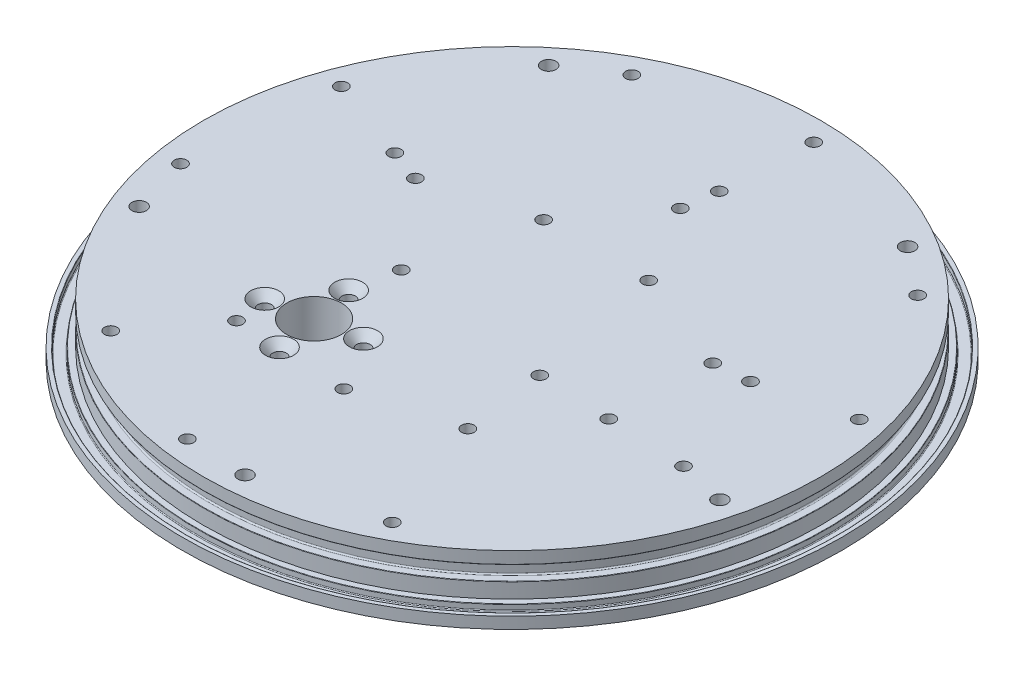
ISO-10303-21;
HEADER;
FILE_DESCRIPTION(('STEP AP214'),'2;1');
FILE_NAME('part.step','',(''),(''),'','','');
FILE_SCHEMA(('AUTOMOTIVE_DESIGN { 1 0 10303 214 1 1 1 1 }'));
ENDSEC;
DATA;
#1=APPLICATION_CONTEXT('core data for automotive mechanical design processes');
#2=APPLICATION_PROTOCOL_DEFINITION('international standard','automotive_design',2000,#1);
#3=PRODUCT_CONTEXT('',#1,'mechanical');
#4=PRODUCT('Part','Part','',(#3));
#5=PRODUCT_RELATED_PRODUCT_CATEGORY('part','',(#4));
#6=PRODUCT_DEFINITION_FORMATION('','',#4);
#7=PRODUCT_DEFINITION_CONTEXT('part definition',#1,'design');
#8=PRODUCT_DEFINITION('design','',#6,#7);
#9=PRODUCT_DEFINITION_SHAPE('','',#8);
#10=(LENGTH_UNIT() NAMED_UNIT(*) SI_UNIT(.MILLI.,.METRE.));
#11=(NAMED_UNIT(*) PLANE_ANGLE_UNIT() SI_UNIT($,.RADIAN.));
#12=(NAMED_UNIT(*) SI_UNIT($,.STERADIAN.) SOLID_ANGLE_UNIT());
#13=UNCERTAINTY_MEASURE_WITH_UNIT(LENGTH_MEASURE(1.E-05),#10,'distance_accuracy_value','');
#14=(GEOMETRIC_REPRESENTATION_CONTEXT(3) GLOBAL_UNCERTAINTY_ASSIGNED_CONTEXT((#13)) GLOBAL_UNIT_ASSIGNED_CONTEXT((#10,
#11,#12)) REPRESENTATION_CONTEXT('',''));
#15=CARTESIAN_POINT('',(0.,0.,0.));
#16=DIRECTION('',(0.,0.,1.));
#17=DIRECTION('',(1.,0.,0.));
#18=AXIS2_PLACEMENT_3D('',#15,#16,#17);
#19=CARTESIAN_POINT('',(-102.5906,0.,0.));
#20=DIRECTION('',(0.,-1.,0.));
#21=DIRECTION('',(1.,0.,0.));
#22=AXIS2_PLACEMENT_3D('',#19,#20,#21);
#23=PLANE('',#22);
#24=CARTESIAN_POINT('',(0.,0.,0.));
#25=DIRECTION('',(0.,-1.,0.));
#26=DIRECTION('',(1.,0.,0.));
#27=AXIS2_PLACEMENT_3D('',#24,#25,#26);
#28=CIRCLE('',#27,102.5906);
#29=CARTESIAN_POINT('',(102.5906,0.,0.));
#30=VERTEX_POINT('',#29);
#31=EDGE_CURVE('E610',#30,#30,#28,.T.);
#32=ORIENTED_EDGE('',*,*,#31,.T.);
#33=EDGE_LOOP('',(#32));
#34=FACE_BOUND('',#33,.T.);
#35=CARTESIAN_POINT('',(0.,0.,0.));
#36=DIRECTION('',(0.,-1.,0.));
#37=DIRECTION('',(0.,0.,-1.));
#38=AXIS2_PLACEMENT_3D('',#35,#36,#37);
#39=CIRCLE('',#38,104.4829);
#40=CARTESIAN_POINT('',(0.,0.,-104.4829));
#41=VERTEX_POINT('',#40);
#42=EDGE_CURVE('E719',#41,#41,#39,.T.);
#43=ORIENTED_EDGE('',*,*,#42,.F.);
#44=EDGE_LOOP('',(#43));
#45=FACE_BOUND('',#44,.T.);
#46=ADVANCED_FACE('F43',(#34,#45),#23,.F.);
#47=CARTESIAN_POINT('',(0.,13.97,0.));
#48=DIRECTION('',(0.,-1.,0.));
#49=DIRECTION('',(1.,0.,0.));
#50=AXIS2_PLACEMENT_3D('',#47,#48,#49);
#51=PLANE('',#50);
#52=CARTESIAN_POINT('',(-17.4624999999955,13.97,-27.9399999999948));
#53=DIRECTION('',(0.,1.,0.));
#54=DIRECTION('',(0.,0.,1.));
#55=AXIS2_PLACEMENT_3D('',#52,#53,#54);
#56=CIRCLE('',#55,2.0828);
#57=CARTESIAN_POINT('',(-17.4624999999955,13.97,-25.8571999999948));
#58=VERTEX_POINT('',#57);
#59=EDGE_CURVE('E726',#58,#58,#56,.T.);
#60=ORIENTED_EDGE('',*,*,#59,.F.);
#61=EDGE_LOOP('',(#60));
#62=FACE_BOUND('',#61,.T.);
#63=CARTESIAN_POINT('',(17.4625000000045,13.97,-27.9399999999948));
#64=DIRECTION('',(0.,1.,0.));
#65=DIRECTION('',(0.,0.,1.));
#66=AXIS2_PLACEMENT_3D('',#63,#64,#65);
#67=CIRCLE('',#66,2.0828);
#68=CARTESIAN_POINT('',(17.4625000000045,13.97,-25.8571999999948));
#69=VERTEX_POINT('',#68);
#70=EDGE_CURVE('E159',#69,#69,#67,.T.);
#71=ORIENTED_EDGE('',*,*,#70,.F.);
#72=EDGE_LOOP('',(#71));
#73=FACE_BOUND('',#72,.T.);
#74=CARTESIAN_POINT('',(26.6700000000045,13.97,17.4625000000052));
#75=DIRECTION('',(0.,1.,0.));
#76=DIRECTION('',(0.,0.,1.));
#77=AXIS2_PLACEMENT_3D('',#74,#75,#76);
#78=CIRCLE('',#77,2.0828);
#79=CARTESIAN_POINT('',(26.6700000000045,13.97,19.5453000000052));
#80=VERTEX_POINT('',#79);
#81=EDGE_CURVE('E182',#80,#80,#78,.T.);
#82=ORIENTED_EDGE('',*,*,#81,.F.);
#83=EDGE_LOOP('',(#82));
#84=FACE_BOUND('',#83,.T.);
#85=CARTESIAN_POINT('',(-26.6699999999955,13.97,10.1600000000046));
#86=DIRECTION('',(0.,1.,0.));
#87=DIRECTION('',(0.,0.,1.));
#88=AXIS2_PLACEMENT_3D('',#85,#86,#87);
#89=CIRCLE('',#88,2.0828);
#90=CARTESIAN_POINT('',(-26.6699999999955,13.97,12.2428000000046));
#91=VERTEX_POINT('',#90);
#92=EDGE_CURVE('E194',#91,#91,#89,.T.);
#93=ORIENTED_EDGE('',*,*,#92,.F.);
#94=EDGE_LOOP('',(#93));
#95=FACE_BOUND('',#94,.T.);
#96=CARTESIAN_POINT('',(-50.686104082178,13.97,-18.5531527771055));
#97=DIRECTION('',(0.,1.,0.));
#98=DIRECTION('',(0.,0.,1.));
#99=AXIS2_PLACEMENT_3D('',#96,#97,#98);
#100=CIRCLE('',#99,2.0828);
#101=CARTESIAN_POINT('',(-50.686104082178,13.97,-16.4703527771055));
#102=VERTEX_POINT('',#101);
#103=EDGE_CURVE('E267',#102,#102,#100,.T.);
#104=ORIENTED_EDGE('',*,*,#103,.F.);
#105=EDGE_LOOP('',(#104));
#106=FACE_BOUND('',#105,.T.);
#107=CARTESIAN_POINT('',(-93.927860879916,13.97,16.2678012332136));
#108=DIRECTION('',(0.,1.,0.));
#109=DIRECTION('',(0.,0.,1.));
#110=AXIS2_PLACEMENT_3D('',#107,#108,#109);
#111=CIRCLE('',#110,2.0828);
#112=CARTESIAN_POINT('',(-93.927860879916,13.97,18.3506012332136));
#113=VERTEX_POINT('',#112);
#114=EDGE_CURVE('E339',#113,#113,#111,.T.);
#115=ORIENTED_EDGE('',*,*,#114,.F.);
#116=EDGE_LOOP('',(#115));
#117=FACE_BOUND('',#116,.T.);
#118=CARTESIAN_POINT('',(-57.4254275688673,13.97,75.968260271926));
#119=DIRECTION('',(0.,1.,0.));
#120=DIRECTION('',(0.,0.,1.));
#121=AXIS2_PLACEMENT_3D('',#118,#119,#120);
#122=CIRCLE('',#121,2.0828);
#123=CARTESIAN_POINT('',(-57.4254275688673,13.97,78.051060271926));
#124=VERTEX_POINT('',#123);
#125=EDGE_CURVE('E351',#124,#124,#122,.T.);
#126=ORIENTED_EDGE('',*,*,#125,.F.);
#127=EDGE_LOOP('',(#126));
#128=FACE_BOUND('',#127,.T.);
#129=CARTESIAN_POINT('',(-39.4321269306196,13.97,52.1572301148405));
#130=DIRECTION('',(0.,1.,0.));
#131=DIRECTION('',(0.,0.,1.));
#132=AXIS2_PLACEMENT_3D('',#129,#130,#131);
#133=CIRCLE('',#132,2.0828);
#134=CARTESIAN_POINT('',(-39.4321269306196,13.97,54.2400301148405));
#135=VERTEX_POINT('',#134);
#136=EDGE_CURVE('E363',#135,#135,#133,.T.);
#137=ORIENTED_EDGE('',*,*,#136,.F.);
#138=EDGE_LOOP('',(#137));
#139=FACE_BOUND('',#138,.T.);
#140=CARTESIAN_POINT('',(-61.4295142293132,13.97,-22.4794288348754));
#141=DIRECTION('',(0.,1.,0.));
#142=DIRECTION('',(0.,0.,1.));
#143=AXIS2_PLACEMENT_3D('',#140,#141,#142);
#144=CIRCLE('',#143,2.0828);
#145=CARTESIAN_POINT('',(-61.4295142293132,13.97,-20.3966288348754));
#146=VERTEX_POINT('',#145);
#147=EDGE_CURVE('E375',#146,#146,#144,.T.);
#148=ORIENTED_EDGE('',*,*,#147,.F.);
#149=EDGE_LOOP('',(#148));
#150=FACE_BOUND('',#149,.T.);
#151=CARTESIAN_POINT('',(-89.4604576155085,13.97,-32.7259032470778));
#152=DIRECTION('',(0.,1.,0.));
#153=DIRECTION('',(0.,0.,1.));
#154=AXIS2_PLACEMENT_3D('',#151,#152,#153);
#155=CIRCLE('',#154,2.0828);
#156=CARTESIAN_POINT('',(-89.4604576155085,13.97,-30.6431032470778));
#157=VERTEX_POINT('',#156);
#158=EDGE_CURVE('E391',#157,#157,#155,.T.);
#159=ORIENTED_EDGE('',*,*,#158,.F.);
#160=EDGE_LOOP('',(#159));
#161=FACE_BOUND('',#160,.T.);
#162=CARTESIAN_POINT('',(3.51609526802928,13.97,-65.3348102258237));
#163=DIRECTION('',(0.,1.,0.));
#164=DIRECTION('',(0.,0.,1.));
#165=AXIS2_PLACEMENT_3D('',#162,#163,#164);
#166=CIRCLE('',#165,2.0828);
#167=CARTESIAN_POINT('',(3.51609526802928,13.97,-63.2520102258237));
#168=VERTEX_POINT('',#167);
#169=EDGE_CURVE('E403',#168,#168,#166,.T.);
#170=ORIENTED_EDGE('',*,*,#169,.F.);
#171=EDGE_LOOP('',(#170));
#172=FACE_BOUND('',#171,.T.);
#173=CARTESIAN_POINT('',(5.12052708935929,13.97,-95.1366528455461));
#174=DIRECTION('',(0.,1.,0.));
#175=DIRECTION('',(0.,0.,1.));
#176=AXIS2_PLACEMENT_3D('',#173,#174,#175);
#177=CIRCLE('',#176,2.0828);
#178=CARTESIAN_POINT('',(5.12052708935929,13.97,-93.0538528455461));
#179=VERTEX_POINT('',#178);
#180=EDGE_CURVE('E416',#179,#179,#177,.T.);
#181=ORIENTED_EDGE('',*,*,#180,.F.);
#182=EDGE_LOOP('',(#181));
#183=FACE_BOUND('',#182,.T.);
#184=CARTESIAN_POINT('',(63.4852718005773,13.97,-15.754433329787));
#185=DIRECTION('',(0.,1.,0.));
#186=DIRECTION('',(0.,0.,1.));
#187=AXIS2_PLACEMENT_3D('',#184,#185,#186);
#188=CIRCLE('',#187,2.0828);
#189=CARTESIAN_POINT('',(63.4852718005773,13.97,-13.671633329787));
#190=VERTEX_POINT('',#189);
#191=EDGE_CURVE('E432',#190,#190,#188,.T.);
#192=ORIENTED_EDGE('',*,*,#191,.F.);
#193=EDGE_LOOP('',(#192));
#194=FACE_BOUND('',#193,.T.);
#195=CARTESIAN_POINT('',(92.4542793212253,13.97,-22.9322204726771));
#196=DIRECTION('',(0.,1.,0.));
#197=DIRECTION('',(0.,0.,1.));
#198=AXIS2_PLACEMENT_3D('',#195,#196,#197);
#199=CIRCLE('',#198,2.0828);
#200=CARTESIAN_POINT('',(92.4542793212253,13.97,-20.8494204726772));
#201=VERTEX_POINT('',#200);
#202=EDGE_CURVE('E444',#201,#201,#199,.T.);
#203=ORIENTED_EDGE('',*,*,#202,.F.);
#204=EDGE_LOOP('',(#203));
#205=FACE_BOUND('',#204,.T.);
#206=CARTESIAN_POINT('',(76.7283205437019,13.97,19.7504097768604));
#207=DIRECTION('',(0.,1.,0.));
#208=DIRECTION('',(0.,0.,1.));
#209=AXIS2_PLACEMENT_3D('',#206,#207,#208);
#210=CIRCLE('',#209,2.0828);
#211=CARTESIAN_POINT('',(76.7283205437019,13.97,21.8332097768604));
#212=VERTEX_POINT('',#211);
#213=EDGE_CURVE('E456',#212,#212,#210,.T.);
#214=ORIENTED_EDGE('',*,*,#213,.F.);
#215=EDGE_LOOP('',(#214));
#216=FACE_BOUND('',#215,.T.);
#217=CARTESIAN_POINT('',(6.36054956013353,13.97,95.113762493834));
#218=DIRECTION('',(0.,1.,0.));
#219=DIRECTION('',(0.,0.,1.));
#220=AXIS2_PLACEMENT_3D('',#217,#218,#219);
#221=CIRCLE('',#220,2.413);
#222=CARTESIAN_POINT('',(6.36054956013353,13.97,97.526762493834));
#223=VERTEX_POINT('',#222);
#224=EDGE_CURVE('E468',#223,#223,#221,.T.);
#225=ORIENTED_EDGE('',*,*,#224,.F.);
#226=EDGE_LOOP('',(#225));
#227=FACE_BOUND('',#226,.T.);
#228=CARTESIAN_POINT('',(-88.493045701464,13.97,35.4410111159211));
#229=DIRECTION('',(0.,1.,0.));
#230=DIRECTION('',(0.,0.,1.));
#231=AXIS2_PLACEMENT_3D('',#228,#229,#230);
#232=CIRCLE('',#231,2.413);
#233=CARTESIAN_POINT('',(-88.493045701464,13.97,37.8540111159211));
#234=VERTEX_POINT('',#233);
#235=EDGE_CURVE('E480',#234,#234,#232,.T.);
#236=ORIENTED_EDGE('',*,*,#235,.F.);
#237=EDGE_LOOP('',(#236));
#238=FACE_BOUND('',#237,.T.);
#239=CARTESIAN_POINT('',(92.4240815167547,13.97,23.3425269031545));
#240=DIRECTION('',(0.,1.,0.));
#241=DIRECTION('',(0.,0.,1.));
#242=AXIS2_PLACEMENT_3D('',#239,#240,#241);
#243=CIRCLE('',#242,2.413);
#244=CARTESIAN_POINT('',(92.4240815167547,13.97,25.7555269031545));
#245=VERTEX_POINT('',#244);
#246=EDGE_CURVE('E492',#245,#245,#243,.T.);
#247=ORIENTED_EDGE('',*,*,#246,.F.);
#248=EDGE_LOOP('',(#247));
#249=FACE_BOUND('',#248,.T.);
#250=CARTESIAN_POINT('',(-61.0522595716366,13.97,-73.2100130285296));
#251=DIRECTION('',(0.,1.,0.));
#252=DIRECTION('',(0.,0.,1.));
#253=AXIS2_PLACEMENT_3D('',#250,#251,#252);
#254=CIRCLE('',#253,2.41299999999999);
#255=CARTESIAN_POINT('',(-61.0522595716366,13.97,-70.7970130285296));
#256=VERTEX_POINT('',#255);
#257=EDGE_CURVE('E504',#256,#256,#254,.T.);
#258=ORIENTED_EDGE('',*,*,#257,.F.);
#259=EDGE_LOOP('',(#258));
#260=FACE_BOUND('',#259,.T.);
#261=CARTESIAN_POINT('',(50.7606741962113,13.97,-80.6872874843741));
#262=DIRECTION('',(0.,1.,0.));
#263=DIRECTION('',(0.,0.,1.));
#264=AXIS2_PLACEMENT_3D('',#261,#262,#263);
#265=CIRCLE('',#264,2.413);
#266=CARTESIAN_POINT('',(50.7606741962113,13.97,-78.2742874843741));
#267=VERTEX_POINT('',#266);
#268=EDGE_CURVE('E520',#267,#267,#265,.T.);
#269=ORIENTED_EDGE('',*,*,#268,.F.);
#270=EDGE_LOOP('',(#269));
#271=FACE_BOUND('',#270,.T.);
#272=CARTESIAN_POINT('',(-29.5585566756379,13.97,24.756886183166));
#273=DIRECTION('',(0.,1.,0.));
#274=DIRECTION('',(0.,0.,1.));
#275=AXIS2_PLACEMENT_3D('',#272,#273,#274);
#276=CIRCLE('',#275,4.6579917);
#277=CARTESIAN_POINT('',(-29.5585566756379,13.97,29.414877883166));
#278=VERTEX_POINT('',#277);
#279=EDGE_CURVE('E536',#278,#278,#276,.T.);
#280=ORIENTED_EDGE('',*,*,#279,.F.);
#281=EDGE_LOOP('',(#280));
#282=FACE_BOUND('',#281,.T.);
#283=CARTESIAN_POINT('',(-41.0449818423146,13.97,41.161201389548));
#284=DIRECTION('',(0.,1.,0.));
#285=DIRECTION('',(0.,0.,1.));
#286=AXIS2_PLACEMENT_3D('',#283,#284,#285);
#287=CIRCLE('',#286,4.6579917);
#288=CARTESIAN_POINT('',(-41.0449818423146,13.97,45.819193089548));
#289=VERTEX_POINT('',#288);
#290=EDGE_CURVE('E545',#289,#289,#287,.T.);
#291=ORIENTED_EDGE('',*,*,#290,.F.);
#292=EDGE_LOOP('',(#291));
#293=FACE_BOUND('',#292,.T.);
#294=CARTESIAN_POINT('',(-24.6406666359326,13.97,52.6476265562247));
#295=DIRECTION('',(0.,1.,0.));
#296=DIRECTION('',(0.,0.,1.));
#297=AXIS2_PLACEMENT_3D('',#294,#295,#296);
#298=CIRCLE('',#297,4.6579917);
#299=CARTESIAN_POINT('',(-24.6406666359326,13.97,57.3056182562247));
#300=VERTEX_POINT('',#299);
#301=EDGE_CURVE('E554',#300,#300,#298,.T.);
#302=ORIENTED_EDGE('',*,*,#301,.F.);
#303=EDGE_LOOP('',(#302));
#304=FACE_BOUND('',#303,.T.);
#305=CARTESIAN_POINT('',(-13.1542414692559,13.97,36.2433113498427));
#306=DIRECTION('',(0.,1.,0.));
#307=DIRECTION('',(0.,0.,1.));
#308=AXIS2_PLACEMENT_3D('',#305,#306,#307);
#309=CIRCLE('',#308,4.6579917);
#310=CARTESIAN_POINT('',(-13.1542414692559,13.97,40.9013030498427));
#311=VERTEX_POINT('',#310);
#312=EDGE_CURVE('E563',#311,#311,#309,.T.);
#313=ORIENTED_EDGE('',*,*,#312,.F.);
#314=EDGE_LOOP('',(#313));
#315=FACE_BOUND('',#314,.T.);
#316=CARTESIAN_POINT('',(-27.0996116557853,13.97,38.7022563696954));
#317=DIRECTION('',(0.,1.,0.));
#318=DIRECTION('',(-1.,0.,0.));
#319=AXIS2_PLACEMENT_3D('',#316,#317,#318);
#320=CIRCLE('',#319,9.0805);
#321=CARTESIAN_POINT('',(-36.1801116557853,13.97,38.7022563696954));
#322=VERTEX_POINT('',#321);
#323=EDGE_CURVE('E596',#322,#322,#320,.T.);
#324=ORIENTED_EDGE('',*,*,#323,.F.);
#325=EDGE_LOOP('',(#324));
#326=FACE_BOUND('',#325,.T.);
#327=CARTESIAN_POINT('',(0.,13.97,0.));
#328=DIRECTION('',(0.,-1.,0.));
#329=DIRECTION('',(1.,0.,0.));
#330=AXIS2_PLACEMENT_3D('',#327,#328,#329);
#331=CIRCLE('',#330,102.5906);
#332=CARTESIAN_POINT('',(102.5906,13.97,0.));
#333=VERTEX_POINT('',#332);
#334=EDGE_CURVE('E11',#333,#333,#331,.T.);
#335=ORIENTED_EDGE('',*,*,#334,.F.);
#336=EDGE_LOOP('',(#335));
#337=FACE_BOUND('',#336,.T.);
#338=CARTESIAN_POINT('',(-44.4969036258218,13.97,-84.3036771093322));
#339=DIRECTION('',(0.,1.,0.));
#340=DIRECTION('',(0.,0.,1.));
#341=AXIS2_PLACEMENT_3D('',#338,#339,#340);
#342=CIRCLE('',#341,2.0828);
#343=CARTESIAN_POINT('',(-44.4969036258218,13.97,-82.2208771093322));
#344=VERTEX_POINT('',#343);
#345=EDGE_CURVE('E323',#344,#344,#342,.T.);
#346=ORIENTED_EDGE('',*,*,#345,.F.);
#347=EDGE_LOOP('',(#346));
#348=FACE_BOUND('',#347,.T.);
#349=CARTESIAN_POINT('',(66.42726204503,13.97,-68.3703390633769));
#350=DIRECTION('',(0.,1.,0.));
#351=DIRECTION('',(0.,0.,1.));
#352=AXIS2_PLACEMENT_3D('',#349,#350,#351);
#353=CIRCLE('',#352,2.0828);
#354=CARTESIAN_POINT('',(66.42726204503,13.97,-66.287539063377));
#355=VERTEX_POINT('',#354);
#356=EDGE_CURVE('E307',#355,#355,#353,.T.);
#357=ORIENTED_EDGE('',*,*,#356,.F.);
#358=EDGE_LOOP('',(#357));
#359=FACE_BOUND('',#358,.T.);
#360=CARTESIAN_POINT('',(44.4969036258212,13.97,84.3036771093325));
#361=DIRECTION('',(0.,1.,0.));
#362=DIRECTION('',(0.,0.,1.));
#363=AXIS2_PLACEMENT_3D('',#360,#361,#362);
#364=CIRCLE('',#363,2.0828);
#365=CARTESIAN_POINT('',(44.4969036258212,13.97,86.3864771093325));
#366=VERTEX_POINT('',#365);
#367=EDGE_CURVE('E295',#366,#366,#364,.T.);
#368=ORIENTED_EDGE('',*,*,#367,.F.);
#369=EDGE_LOOP('',(#368));
#370=FACE_BOUND('',#369,.T.);
#371=CARTESIAN_POINT('',(-13.5537068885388,13.97,94.3577311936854));
#372=DIRECTION('',(0.,1.,0.));
#373=DIRECTION('',(0.,0.,1.));
#374=AXIS2_PLACEMENT_3D('',#371,#372,#373);
#375=CIRCLE('',#374,2.0828);
#376=CARTESIAN_POINT('',(-13.5537068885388,13.97,96.4405311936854));
#377=VERTEX_POINT('',#376);
#378=EDGE_CURVE('E283',#377,#377,#375,.T.);
#379=ORIENTED_EDGE('',*,*,#378,.F.);
#380=EDGE_LOOP('',(#379));
#381=FACE_BOUND('',#380,.T.);
#382=CARTESIAN_POINT('',(1.98222930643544,13.97,-53.9385890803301));
#383=DIRECTION('',(0.,1.,0.));
#384=DIRECTION('',(0.,0.,1.));
#385=AXIS2_PLACEMENT_3D('',#382,#383,#384);
#386=CIRCLE('',#385,2.0828);
#387=CARTESIAN_POINT('',(1.98222930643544,13.97,-51.8557890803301));
#388=VERTEX_POINT('',#387);
#389=EDGE_CURVE('E254',#388,#388,#386,.T.);
#390=ORIENTED_EDGE('',*,*,#389,.F.);
#391=EDGE_LOOP('',(#390));
#392=FACE_BOUND('',#391,.T.);
#393=CARTESIAN_POINT('',(51.9111891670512,13.97,-14.7827285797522));
#394=DIRECTION('',(0.,1.,0.));
#395=DIRECTION('',(0.,0.,1.));
#396=AXIS2_PLACEMENT_3D('',#393,#394,#395);
#397=CIRCLE('',#396,2.0828);
#398=CARTESIAN_POINT('',(51.9111891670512,13.97,-12.6999285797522));
#399=VERTEX_POINT('',#398);
#400=EDGE_CURVE('E242',#399,#399,#397,.T.);
#401=ORIENTED_EDGE('',*,*,#400,.F.);
#402=EDGE_LOOP('',(#401));
#403=FACE_BOUND('',#402,.T.);
#404=CARTESIAN_POINT('',(50.686104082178,13.97,18.5531527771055));
#405=DIRECTION('',(0.,1.,0.));
#406=DIRECTION('',(0.,0.,1.));
#407=AXIS2_PLACEMENT_3D('',#404,#405,#406);
#408=CIRCLE('',#407,2.0828);
#409=CARTESIAN_POINT('',(50.686104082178,13.97,20.6359527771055));
#410=VERTEX_POINT('',#409);
#411=EDGE_CURVE('E230',#410,#410,#408,.T.);
#412=ORIENTED_EDGE('',*,*,#411,.F.);
#413=EDGE_LOOP('',(#412));
#414=FACE_BOUND('',#413,.T.);
#415=CARTESIAN_POINT('',(30.1006499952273,13.97,44.8023603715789));
#416=DIRECTION('',(0.,1.,0.));
#417=DIRECTION('',(0.,0.,1.));
#418=AXIS2_PLACEMENT_3D('',#415,#416,#417);
#419=CIRCLE('',#418,2.0828);
#420=CARTESIAN_POINT('',(30.1006499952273,13.97,46.8851603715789));
#421=VERTEX_POINT('',#420);
#422=EDGE_CURVE('E218',#421,#421,#419,.T.);
#423=ORIENTED_EDGE('',*,*,#422,.F.);
#424=EDGE_LOOP('',(#423));
#425=FACE_BOUND('',#424,.T.);
#426=CARTESIAN_POINT('',(-1.9822293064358,13.97,53.9385890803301));
#427=DIRECTION('',(0.,1.,0.));
#428=DIRECTION('',(0.,0.,1.));
#429=AXIS2_PLACEMENT_3D('',#426,#427,#428);
#430=CIRCLE('',#429,2.0828);
#431=CARTESIAN_POINT('',(-1.9822293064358,13.97,56.0213890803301));
#432=VERTEX_POINT('',#431);
#433=EDGE_CURVE('E206',#432,#432,#430,.T.);
#434=ORIENTED_EDGE('',*,*,#433,.F.);
#435=EDGE_LOOP('',(#434));
#436=FACE_BOUND('',#435,.T.);
#437=ADVANCED_FACE('F45',(#62,#73,#84,#95,#106,#117,#128,#139,#150,#161,#172,#183,#194,#205,
#216,#227,#238,#249,#260,#271,#282,#293,#304,#315,#326,#337,#348,#359,#370,#381,#392,#403,#414,
#425,#436),#51,.F.);
#438=CARTESIAN_POINT('',(-109.537499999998,-3.81,0.));
#439=DIRECTION('',(0.,1.,0.));
#440=DIRECTION('',(-1.,0.,0.));
#441=AXIS2_PLACEMENT_3D('',#438,#439,#440);
#442=PLANE('',#441);
#443=CARTESIAN_POINT('',(-29.5585566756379,-3.81000000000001,24.756886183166));
#444=DIRECTION('',(0.,1.,0.));
#445=DIRECTION('',(0.,0.,1.));
#446=AXIS2_PLACEMENT_3D('',#443,#444,#445);
#447=CIRCLE('',#446,2.24789999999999);
#448=CARTESIAN_POINT('',(-29.5585566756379,-3.81000000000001,27.004786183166));
#449=VERTEX_POINT('',#448);
#450=EDGE_CURVE('E542',#449,#449,#447,.T.);
#451=ORIENTED_EDGE('',*,*,#450,.T.);
#452=EDGE_LOOP('',(#451));
#453=FACE_BOUND('',#452,.T.);
#454=CARTESIAN_POINT('',(-41.0449818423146,-3.81000000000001,41.161201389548));
#455=DIRECTION('',(0.,1.,0.));
#456=DIRECTION('',(0.,0.,1.));
#457=AXIS2_PLACEMENT_3D('',#454,#455,#456);
#458=CIRCLE('',#457,2.2479);
#459=CARTESIAN_POINT('',(-41.0449818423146,-3.81000000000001,43.409101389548));
#460=VERTEX_POINT('',#459);
#461=EDGE_CURVE('E551',#460,#460,#458,.T.);
#462=ORIENTED_EDGE('',*,*,#461,.T.);
#463=EDGE_LOOP('',(#462));
#464=FACE_BOUND('',#463,.T.);
#465=CARTESIAN_POINT('',(-24.6406666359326,-3.81000000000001,52.6476265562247));
#466=DIRECTION('',(0.,1.,0.));
#467=DIRECTION('',(0.,0.,1.));
#468=AXIS2_PLACEMENT_3D('',#465,#466,#467);
#469=CIRCLE('',#468,2.2479);
#470=CARTESIAN_POINT('',(-24.6406666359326,-3.81000000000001,54.8955265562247));
#471=VERTEX_POINT('',#470);
#472=EDGE_CURVE('E560',#471,#471,#469,.T.);
#473=ORIENTED_EDGE('',*,*,#472,.T.);
#474=EDGE_LOOP('',(#473));
#475=FACE_BOUND('',#474,.T.);
#476=CARTESIAN_POINT('',(-13.1542414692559,-3.81000000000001,36.2433113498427));
#477=DIRECTION('',(0.,1.,0.));
#478=DIRECTION('',(0.,0.,1.));
#479=AXIS2_PLACEMENT_3D('',#476,#477,#478);
#480=CIRCLE('',#479,2.2479);
#481=CARTESIAN_POINT('',(-13.1542414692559,-3.81000000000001,38.4912113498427));
#482=VERTEX_POINT('',#481);
#483=EDGE_CURVE('E569',#482,#482,#480,.T.);
#484=ORIENTED_EDGE('',*,*,#483,.T.);
#485=EDGE_LOOP('',(#484));
#486=FACE_BOUND('',#485,.T.);
#487=CARTESIAN_POINT('',(-27.0996116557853,-3.81,38.7022563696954));
#488=DIRECTION('',(0.,1.,0.));
#489=DIRECTION('',(-1.,0.,0.));
#490=AXIS2_PLACEMENT_3D('',#487,#488,#489);
#491=CIRCLE('',#490,9.0805);
#492=CARTESIAN_POINT('',(-36.1801116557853,-3.81,38.7022563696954));
#493=VERTEX_POINT('',#492);
#494=EDGE_CURVE('E597',#493,#493,#491,.T.);
#495=ORIENTED_EDGE('',*,*,#494,.T.);
#496=EDGE_LOOP('',(#495));
#497=FACE_BOUND('',#496,.T.);
#498=CARTESIAN_POINT('',(-27.0996116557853,-3.81000000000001,38.7022563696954));
#499=DIRECTION('',(0.,1.,0.));
#500=DIRECTION('',(0.,0.,1.));
#501=AXIS2_PLACEMENT_3D('',#498,#499,#500);
#502=CIRCLE('',#501,18.7198);
#503=CARTESIAN_POINT('',(-27.0996116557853,-3.81000000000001,57.4220563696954));
#504=VERTEX_POINT('',#503);
#505=EDGE_CURVE('E593',#504,#504,#502,.T.);
#506=ORIENTED_EDGE('',*,*,#505,.F.);
#507=EDGE_LOOP('',(#506));
#508=FACE_BOUND('',#507,.T.);
#509=ADVANCED_FACE('F649',(#453,#464,#475,#486,#497,#508),#442,.F.);
#510=CARTESIAN_POINT('',(0.,13.97,0.));
#511=DIRECTION('',(0.,-1.,0.));
#512=DIRECTION('',(1.,0.,0.));
#513=AXIS2_PLACEMENT_3D('',#510,#511,#512);
#514=CYLINDRICAL_SURFACE('',#513,102.5906);
#515=CARTESIAN_POINT('',(0.,10.0203,0.));
#516=DIRECTION('',(0.,-1.,0.));
#517=DIRECTION('',(1.,0.,0.));
#518=AXIS2_PLACEMENT_3D('',#515,#516,#517);
#519=CIRCLE('',#518,102.5906);
#520=CARTESIAN_POINT('',(102.5906,10.0203,0.));
#521=VERTEX_POINT('',#520);
#522=EDGE_CURVE('E52',#521,#521,#519,.T.);
#523=ORIENTED_EDGE('',*,*,#522,.F.);
#524=EDGE_LOOP('',(#523));
#525=FACE_BOUND('',#524,.T.);
#526=ORIENTED_EDGE('',*,*,#334,.T.);
#527=EDGE_LOOP('',(#526));
#528=FACE_BOUND('',#527,.T.);
#529=ADVANCED_FACE('F646',(#525,#528),#514,.T.);
#530=CARTESIAN_POINT('',(0.,10.0203,0.));
#531=DIRECTION('',(0.,-1.,0.));
#532=DIRECTION('',(1.,0.,0.));
#533=AXIS2_PLACEMENT_3D('',#530,#531,#532);
#534=TOROIDAL_SURFACE('',#533,102.4636,0.127000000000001);
#535=CARTESIAN_POINT('',(0.,9.8933,0.));
#536=DIRECTION('',(0.,-1.,0.));
#537=DIRECTION('',(1.,0.,0.));
#538=AXIS2_PLACEMENT_3D('',#535,#536,#537);
#539=CIRCLE('',#538,102.4636);
#540=CARTESIAN_POINT('',(102.4636,9.8933,0.));
#541=VERTEX_POINT('',#540);
#542=EDGE_CURVE('E637',#541,#541,#539,.T.);
#543=ORIENTED_EDGE('',*,*,#542,.F.);
#544=EDGE_LOOP('',(#543));
#545=FACE_BOUND('',#544,.T.);
#546=ORIENTED_EDGE('',*,*,#522,.T.);
#547=EDGE_LOOP('',(#546));
#548=FACE_BOUND('',#547,.T.);
#549=ADVANCED_FACE('F644',(#545,#548),#534,.T.);
#550=CARTESIAN_POINT('',(-102.4636,9.8933,0.));
#551=DIRECTION('',(0.,1.,0.));
#552=DIRECTION('',(-1.,0.,0.));
#553=AXIS2_PLACEMENT_3D('',#550,#551,#552);
#554=PLANE('',#553);
#555=CARTESIAN_POINT('',(0.,9.8933,0.));
#556=DIRECTION('',(0.,-1.,0.));
#557=DIRECTION('',(1.,0.,0.));
#558=AXIS2_PLACEMENT_3D('',#555,#556,#557);
#559=CIRCLE('',#558,100.2157);
#560=CARTESIAN_POINT('',(100.2157,9.8933,0.));
#561=VERTEX_POINT('',#560);
#562=EDGE_CURVE('E633',#561,#561,#559,.T.);
#563=ORIENTED_EDGE('',*,*,#562,.F.);
#564=EDGE_LOOP('',(#563));
#565=FACE_BOUND('',#564,.T.);
#566=ORIENTED_EDGE('',*,*,#542,.T.);
#567=EDGE_LOOP('',(#566));
#568=FACE_BOUND('',#567,.T.);
#569=ADVANCED_FACE('F1549',(#565,#568),#554,.F.);
#570=CARTESIAN_POINT('',(0.,9.4488,0.));
#571=DIRECTION('',(0.,-1.,0.));
#572=DIRECTION('',(1.,0.,0.));
#573=AXIS2_PLACEMENT_3D('',#570,#571,#572);
#574=TOROIDAL_SURFACE('',#573,100.2157,0.4445);
#575=CARTESIAN_POINT('',(0.,9.4488,0.));
#576=DIRECTION('',(0.,-1.,0.));
#577=DIRECTION('',(1.,0.,0.));
#578=AXIS2_PLACEMENT_3D('',#575,#576,#577);
#579=CIRCLE('',#578,99.7712);
#580=CARTESIAN_POINT('',(99.7712,9.4488,0.));
#581=VERTEX_POINT('',#580);
#582=EDGE_CURVE('E630',#581,#581,#579,.T.);
#583=ORIENTED_EDGE('',*,*,#582,.F.);
#584=EDGE_LOOP('',(#583));
#585=FACE_BOUND('',#584,.T.);
#586=ORIENTED_EDGE('',*,*,#562,.T.);
#587=EDGE_LOOP('',(#586));
#588=FACE_BOUND('',#587,.T.);
#589=ADVANCED_FACE('F1563',(#585,#588),#574,.F.);
#590=CARTESIAN_POINT('',(0.,13.97,0.));
#591=DIRECTION('',(0.,-1.,0.));
#592=DIRECTION('',(1.,0.,0.));
#593=AXIS2_PLACEMENT_3D('',#590,#591,#592);
#594=CYLINDRICAL_SURFACE('',#593,99.7712);
#595=CARTESIAN_POINT('',(0.,5.5245,0.));
#596=DIRECTION('',(0.,-1.,0.));
#597=DIRECTION('',(1.,0.,0.));
#598=AXIS2_PLACEMENT_3D('',#595,#596,#597);
#599=CIRCLE('',#598,99.7712);
#600=CARTESIAN_POINT('',(99.7712,5.5245,0.));
#601=VERTEX_POINT('',#600);
#602=EDGE_CURVE('E626',#601,#601,#599,.T.);
#603=ORIENTED_EDGE('',*,*,#602,.F.);
#604=EDGE_LOOP('',(#603));
#605=FACE_BOUND('',#604,.T.);
#606=ORIENTED_EDGE('',*,*,#582,.T.);
#607=EDGE_LOOP('',(#606));
#608=FACE_BOUND('',#607,.T.);
#609=ADVANCED_FACE('F1558',(#605,#608),#594,.T.);
#610=CARTESIAN_POINT('',(0.,5.5245,0.));
#611=DIRECTION('',(0.,-1.,0.));
#612=DIRECTION('',(1.,0.,0.));
#613=AXIS2_PLACEMENT_3D('',#610,#611,#612);
#614=TOROIDAL_SURFACE('',#613,100.2157,0.4445);
#615=CARTESIAN_POINT('',(0.,5.08,0.));
#616=DIRECTION('',(0.,-1.,0.));
#617=DIRECTION('',(1.,0.,0.));
#618=AXIS2_PLACEMENT_3D('',#615,#616,#617);
#619=CIRCLE('',#618,100.2157);
#620=CARTESIAN_POINT('',(100.2157,5.08,0.));
#621=VERTEX_POINT('',#620);
#622=EDGE_CURVE('E622',#621,#621,#619,.T.);
#623=ORIENTED_EDGE('',*,*,#622,.F.);
#624=EDGE_LOOP('',(#623));
#625=FACE_BOUND('',#624,.T.);
#626=ORIENTED_EDGE('',*,*,#602,.T.);
#627=EDGE_LOOP('',(#626));
#628=FACE_BOUND('',#627,.T.);
#629=ADVANCED_FACE('F1562',(#625,#628),#614,.F.);
#630=CARTESIAN_POINT('',(-102.4636,5.08,0.));
#631=DIRECTION('',(0.,-1.,0.));
#632=DIRECTION('',(1.,0.,0.));
#633=AXIS2_PLACEMENT_3D('',#630,#631,#632);
#634=PLANE('',#633);
#635=CARTESIAN_POINT('',(0.,5.08,0.));
#636=DIRECTION('',(0.,-1.,0.));
#637=DIRECTION('',(1.,0.,0.));
#638=AXIS2_PLACEMENT_3D('',#635,#636,#637);
#639=CIRCLE('',#638,102.4636);
#640=CARTESIAN_POINT('',(102.4636,5.08,0.));
#641=VERTEX_POINT('',#640);
#642=EDGE_CURVE('E618',#641,#641,#639,.T.);
#643=ORIENTED_EDGE('',*,*,#642,.F.);
#644=EDGE_LOOP('',(#643));
#645=FACE_BOUND('',#644,.T.);
#646=ORIENTED_EDGE('',*,*,#622,.T.);
#647=EDGE_LOOP('',(#646));
#648=FACE_BOUND('',#647,.T.);
#649=ADVANCED_FACE('F1573',(#645,#648),#634,.F.);
#650=CARTESIAN_POINT('',(0.,4.953,0.));
#651=DIRECTION('',(0.,-1.,0.));
#652=DIRECTION('',(1.,0.,0.));
#653=AXIS2_PLACEMENT_3D('',#650,#651,#652);
#654=TOROIDAL_SURFACE('',#653,102.4636,0.127000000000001);
#655=CARTESIAN_POINT('',(0.,4.953,0.));
#656=DIRECTION('',(0.,-1.,0.));
#657=DIRECTION('',(1.,0.,0.));
#658=AXIS2_PLACEMENT_3D('',#655,#656,#657);
#659=CIRCLE('',#658,102.5906);
#660=CARTESIAN_POINT('',(102.5906,4.953,0.));
#661=VERTEX_POINT('',#660);
#662=EDGE_CURVE('E614',#661,#661,#659,.T.);
#663=ORIENTED_EDGE('',*,*,#662,.F.);
#664=EDGE_LOOP('',(#663));
#665=FACE_BOUND('',#664,.T.);
#666=ORIENTED_EDGE('',*,*,#642,.T.);
#667=EDGE_LOOP('',(#666));
#668=FACE_BOUND('',#667,.T.);
#669=ADVANCED_FACE('F709',(#665,#668),#654,.T.);
#670=CARTESIAN_POINT('',(0.,13.97,0.));
#671=DIRECTION('',(0.,-1.,0.));
#672=DIRECTION('',(1.,0.,0.));
#673=AXIS2_PLACEMENT_3D('',#670,#671,#672);
#674=CYLINDRICAL_SURFACE('',#673,102.5906);
#675=ORIENTED_EDGE('',*,*,#31,.F.);
#676=EDGE_LOOP('',(#675));
#677=FACE_BOUND('',#676,.T.);
#678=ORIENTED_EDGE('',*,*,#662,.T.);
#679=EDGE_LOOP('',(#678));
#680=FACE_BOUND('',#679,.T.);
#681=ADVANCED_FACE('F701',(#677,#680),#674,.T.);
#682=CARTESIAN_POINT('',(0.,0.,0.));
#683=DIRECTION('',(0.,-1.,0.));
#684=DIRECTION('',(0.,0.,-1.));
#685=AXIS2_PLACEMENT_3D('',#682,#683,#684);
#686=CIRCLE('',#685,108.2675);
#687=CARTESIAN_POINT('',(0.,0.,-108.2675));
#688=VERTEX_POINT('',#687);
#689=EDGE_CURVE('E714',#688,#688,#686,.T.);
#690=ORIENTED_EDGE('',*,*,#689,.T.);
#691=EDGE_LOOP('',(#690));
#692=FACE_BOUND('',#691,.T.);
#693=CARTESIAN_POINT('',(0.,0.,0.));
#694=DIRECTION('',(0.,-1.,0.));
#695=DIRECTION('',(1.,0.,0.));
#696=AXIS2_PLACEMENT_3D('',#693,#694,#695);
#697=CIRCLE('',#696,109.537499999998);
#698=CARTESIAN_POINT('',(109.537499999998,0.,0.));
#699=VERTEX_POINT('',#698);
#700=EDGE_CURVE('E606',#699,#699,#697,.T.);
#701=ORIENTED_EDGE('',*,*,#700,.F.);
#702=EDGE_LOOP('',(#701));
#703=FACE_BOUND('',#702,.T.);
#704=ADVANCED_FACE('F693',(#692,#703),#23,.F.);
#705=CARTESIAN_POINT('',(0.,13.97,0.));
#706=DIRECTION('',(0.,-1.,0.));
#707=DIRECTION('',(1.,0.,0.));
#708=AXIS2_PLACEMENT_3D('',#705,#706,#707);
#709=CYLINDRICAL_SURFACE('',#708,109.537499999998);
#710=CARTESIAN_POINT('',(0.,-3.81,0.));
#711=DIRECTION('',(0.,-1.,0.));
#712=DIRECTION('',(1.,0.,0.));
#713=AXIS2_PLACEMENT_3D('',#710,#711,#712);
#714=CIRCLE('',#713,109.537499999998);
#715=CARTESIAN_POINT('',(109.537499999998,-3.81,0.));
#716=VERTEX_POINT('',#715);
#717=EDGE_CURVE('E600',#716,#716,#714,.T.);
#718=ORIENTED_EDGE('',*,*,#717,.F.);
#719=EDGE_LOOP('',(#718));
#720=FACE_BOUND('',#719,.T.);
#721=ORIENTED_EDGE('',*,*,#700,.T.);
#722=EDGE_LOOP('',(#721));
#723=FACE_BOUND('',#722,.T.);
#724=ADVANCED_FACE('F700',(#720,#723),#709,.T.);
#725=CARTESIAN_POINT('',(-27.0996116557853,-3.81,38.7022563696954));
#726=DIRECTION('',(0.,1.,0.));
#727=DIRECTION('',(0.,0.,1.));
#728=AXIS2_PLACEMENT_3D('',#725,#726,#727);
#729=CIRCLE('',#728,23.5966);
#730=CARTESIAN_POINT('',(-27.0996116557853,-3.81000000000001,62.2988563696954));
#731=VERTEX_POINT('',#730);
#732=EDGE_CURVE('E590',#731,#731,#729,.T.);
#733=ORIENTED_EDGE('',*,*,#732,.T.);
#734=EDGE_LOOP('',(#733));
#735=FACE_BOUND('',#734,.T.);
#736=ORIENTED_EDGE('',*,*,#717,.T.);
#737=EDGE_LOOP('',(#736));
#738=FACE_BOUND('',#737,.T.);
#739=ADVANCED_FACE('F707',(#735,#738),#442,.F.);
#740=CARTESIAN_POINT('',(-27.0996116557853,-3.81,38.7022563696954));
#741=DIRECTION('',(0.,1.,0.));
#742=DIRECTION('',(-1.,0.,0.));
#743=AXIS2_PLACEMENT_3D('',#740,#741,#742);
#744=CYLINDRICAL_SURFACE('',#743,9.0805);
#745=ORIENTED_EDGE('',*,*,#494,.F.);
#746=EDGE_LOOP('',(#745));
#747=FACE_BOUND('',#746,.T.);
#748=ORIENTED_EDGE('',*,*,#323,.T.);
#749=EDGE_LOOP('',(#748));
#750=FACE_BOUND('',#749,.T.);
#751=ADVANCED_FACE('F795',(#747,#750),#744,.F.);
#752=CARTESIAN_POINT('',(-27.0996116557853,-3.68300000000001,38.7022563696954));
#753=DIRECTION('',(0.,1.,0.));
#754=DIRECTION('',(0.,0.,1.));
#755=AXIS2_PLACEMENT_3D('',#752,#753,#754);
#756=TOROIDAL_SURFACE('',#755,18.7198,0.127);
#757=ORIENTED_EDGE('',*,*,#505,.T.);
#758=EDGE_LOOP('',(#757));
#759=FACE_BOUND('',#758,.T.);
#760=CARTESIAN_POINT('',(-27.0996116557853,-3.68300000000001,38.7022563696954));
#761=DIRECTION('',(0.,1.,0.));
#762=DIRECTION('',(0.,0.,1.));
#763=AXIS2_PLACEMENT_3D('',#760,#761,#762);
#764=CIRCLE('',#763,18.8468);
#765=CARTESIAN_POINT('',(-27.0996116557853,-3.68300000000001,57.5490563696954));
#766=VERTEX_POINT('',#765);
#767=EDGE_CURVE('E572',#766,#766,#764,.T.);
#768=ORIENTED_EDGE('',*,*,#767,.F.);
#769=EDGE_LOOP('',(#768));
#770=FACE_BOUND('',#769,.T.);
#771=ADVANCED_FACE('F797',(#759,#770),#756,.T.);
#772=CARTESIAN_POINT('',(-27.0996116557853,-3.68300000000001,38.7022563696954));
#773=DIRECTION('',(0.,1.,0.));
#774=DIRECTION('',(0.,0.,1.));
#775=AXIS2_PLACEMENT_3D('',#772,#773,#774);
#776=TOROIDAL_SURFACE('',#775,23.5966,0.126999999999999);
#777=CARTESIAN_POINT('',(-27.0996116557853,-3.68300000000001,38.7022563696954));
#778=DIRECTION('',(0.,1.,0.));
#779=DIRECTION('',(0.,0.,1.));
#780=AXIS2_PLACEMENT_3D('',#777,#778,#779);
#781=CIRCLE('',#780,23.4696);
#782=CARTESIAN_POINT('',(-27.0996116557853,-3.68300000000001,62.1718563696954));
#783=VERTEX_POINT('',#782);
#784=EDGE_CURVE('E587',#783,#783,#781,.T.);
#785=ORIENTED_EDGE('',*,*,#784,.T.);
#786=EDGE_LOOP('',(#785));
#787=FACE_BOUND('',#786,.T.);
#788=ORIENTED_EDGE('',*,*,#732,.F.);
#789=EDGE_LOOP('',(#788));
#790=FACE_BOUND('',#789,.T.);
#791=ADVANCED_FACE('F804',(#787,#790),#776,.T.);
#792=CARTESIAN_POINT('',(-27.0996116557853,13.97,38.7022563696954));
#793=DIRECTION('',(0.,1.,0.));
#794=DIRECTION('',(0.,0.,1.));
#795=AXIS2_PLACEMENT_3D('',#792,#793,#794);
#796=CYLINDRICAL_SURFACE('',#795,23.4696);
#797=CARTESIAN_POINT('',(-27.0996116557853,-1.61290000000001,38.7022563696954));
#798=DIRECTION('',(0.,1.,0.));
#799=DIRECTION('',(0.,0.,1.));
#800=AXIS2_PLACEMENT_3D('',#797,#798,#799);
#801=CIRCLE('',#800,23.4696);
#802=CARTESIAN_POINT('',(-27.0996116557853,-1.61290000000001,62.1718563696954));
#803=VERTEX_POINT('',#802);
#804=EDGE_CURVE('E584',#803,#803,#801,.T.);
#805=ORIENTED_EDGE('',*,*,#804,.T.);
#806=EDGE_LOOP('',(#805));
#807=FACE_BOUND('',#806,.T.);
#808=ORIENTED_EDGE('',*,*,#784,.F.);
#809=EDGE_LOOP('',(#808));
#810=FACE_BOUND('',#809,.T.);
#811=ADVANCED_FACE('F813',(#807,#810),#796,.F.);
#812=CARTESIAN_POINT('',(-27.0996116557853,-1.61290000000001,38.7022563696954));
#813=DIRECTION('',(0.,1.,0.));
#814=DIRECTION('',(0.,0.,1.));
#815=AXIS2_PLACEMENT_3D('',#812,#813,#814);
#816=TOROIDAL_SURFACE('',#815,23.0251,0.4445);
#817=CARTESIAN_POINT('',(-27.0996116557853,-1.16840000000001,38.7022563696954));
#818=DIRECTION('',(0.,1.,0.));
#819=DIRECTION('',(0.,0.,1.));
#820=AXIS2_PLACEMENT_3D('',#817,#818,#819);
#821=CIRCLE('',#820,23.0251);
#822=CARTESIAN_POINT('',(-27.0996116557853,-1.16840000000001,61.7273563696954));
#823=VERTEX_POINT('',#822);
#824=EDGE_CURVE('E581',#823,#823,#821,.T.);
#825=ORIENTED_EDGE('',*,*,#824,.T.);
#826=EDGE_LOOP('',(#825));
#827=FACE_BOUND('',#826,.T.);
#828=ORIENTED_EDGE('',*,*,#804,.F.);
#829=EDGE_LOOP('',(#828));
#830=FACE_BOUND('',#829,.T.);
#831=ADVANCED_FACE('F817',(#827,#830),#816,.F.);
#832=CARTESIAN_POINT('',(-16.0345765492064,-1.1684,22.8997485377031));
#833=DIRECTION('',(0.,-1.,0.));
#834=DIRECTION('',(0.,0.,-1.));
#835=AXIS2_PLACEMENT_3D('',#832,#833,#834);
#836=PLANE('',#835);
#837=CARTESIAN_POINT('',(-27.0996116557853,-1.16840000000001,38.7022563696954));
#838=DIRECTION('',(0.,1.,0.));
#839=DIRECTION('',(0.,0.,1.));
#840=AXIS2_PLACEMENT_3D('',#837,#838,#839);
#841=CIRCLE('',#840,19.2913);
#842=CARTESIAN_POINT('',(-27.0996116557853,-1.16840000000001,57.9935563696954));
#843=VERTEX_POINT('',#842);
#844=EDGE_CURVE('E578',#843,#843,#841,.T.);
#845=ORIENTED_EDGE('',*,*,#844,.T.);
#846=EDGE_LOOP('',(#845));
#847=FACE_BOUND('',#846,.T.);
#848=ORIENTED_EDGE('',*,*,#824,.F.);
#849=EDGE_LOOP('',(#848));
#850=FACE_BOUND('',#849,.T.);
#851=ADVANCED_FACE('F821',(#847,#850),#836,.T.);
#852=CARTESIAN_POINT('',(-27.0996116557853,-1.61290000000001,38.7022563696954));
#853=DIRECTION('',(0.,1.,0.));
#854=DIRECTION('',(0.,0.,1.));
#855=AXIS2_PLACEMENT_3D('',#852,#853,#854);
#856=TOROIDAL_SURFACE('',#855,19.2913,0.444499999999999);
#857=CARTESIAN_POINT('',(-27.0996116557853,-1.61290000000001,38.7022563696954));
#858=DIRECTION('',(0.,1.,0.));
#859=DIRECTION('',(0.,0.,1.));
#860=AXIS2_PLACEMENT_3D('',#857,#858,#859);
#861=CIRCLE('',#860,18.8468);
#862=CARTESIAN_POINT('',(-27.0996116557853,-1.61290000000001,57.5490563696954));
#863=VERTEX_POINT('',#862);
#864=EDGE_CURVE('E575',#863,#863,#861,.T.);
#865=ORIENTED_EDGE('',*,*,#864,.T.);
#866=EDGE_LOOP('',(#865));
#867=FACE_BOUND('',#866,.T.);
#868=ORIENTED_EDGE('',*,*,#844,.F.);
#869=EDGE_LOOP('',(#868));
#870=FACE_BOUND('',#869,.T.);
#871=ADVANCED_FACE('F825',(#867,#870),#856,.F.);
#872=CARTESIAN_POINT('',(-27.0996116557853,13.97,38.7022563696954));
#873=DIRECTION('',(0.,1.,0.));
#874=DIRECTION('',(0.,0.,1.));
#875=AXIS2_PLACEMENT_3D('',#872,#873,#874);
#876=CYLINDRICAL_SURFACE('',#875,18.8468);
#877=ORIENTED_EDGE('',*,*,#767,.T.);
#878=EDGE_LOOP('',(#877));
#879=FACE_BOUND('',#878,.T.);
#880=ORIENTED_EDGE('',*,*,#864,.F.);
#881=EDGE_LOOP('',(#880));
#882=FACE_BOUND('',#881,.T.);
#883=ADVANCED_FACE('F829',(#879,#882),#876,.T.);
#884=CARTESIAN_POINT('',(-13.1542414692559,13.97,36.2433113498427));
#885=DIRECTION('',(0.,1.,0.));
#886=DIRECTION('',(0.,0.,1.));
#887=AXIS2_PLACEMENT_3D('',#884,#885,#886);
#888=CYLINDRICAL_SURFACE('',#887,2.2479);
#889=ORIENTED_EDGE('',*,*,#483,.F.);
#890=EDGE_LOOP('',(#889));
#891=FACE_BOUND('',#890,.T.);
#892=CARTESIAN_POINT('',(-13.1542414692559,11.1975066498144,36.2433113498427));
#893=DIRECTION('',(0.,1.,0.));
#894=DIRECTION('',(0.,0.,1.));
#895=AXIS2_PLACEMENT_3D('',#892,#893,#894);
#896=CIRCLE('',#895,2.2479);
#897=CARTESIAN_POINT('',(-13.1542414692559,11.1975066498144,38.4912113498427));
#898=VERTEX_POINT('',#897);
#899=EDGE_CURVE('E566',#898,#898,#896,.T.);
#900=ORIENTED_EDGE('',*,*,#899,.T.);
#901=EDGE_LOOP('',(#900));
#902=FACE_BOUND('',#901,.T.);
#903=ADVANCED_FACE('F833',(#891,#902),#888,.F.);
#904=CARTESIAN_POINT('',(-13.1542414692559,13.97,36.2433113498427));
#905=DIRECTION('',(0.,1.,0.));
#906=DIRECTION('',(0.,0.,1.));
#907=AXIS2_PLACEMENT_3D('',#904,#905,#906);
#908=CONICAL_SURFACE('',#907,4.6579917,0.715584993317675);
#909=ORIENTED_EDGE('',*,*,#899,.F.);
#910=EDGE_LOOP('',(#909));
#911=FACE_BOUND('',#910,.T.);
#912=ORIENTED_EDGE('',*,*,#312,.T.);
#913=EDGE_LOOP('',(#912));
#914=FACE_BOUND('',#913,.T.);
#915=ADVANCED_FACE('F837',(#911,#914),#908,.F.);
#916=CARTESIAN_POINT('',(-24.6406666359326,13.97,52.6476265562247));
#917=DIRECTION('',(0.,1.,0.));
#918=DIRECTION('',(0.,0.,1.));
#919=AXIS2_PLACEMENT_3D('',#916,#917,#918);
#920=CYLINDRICAL_SURFACE('',#919,2.2479);
#921=ORIENTED_EDGE('',*,*,#472,.F.);
#922=EDGE_LOOP('',(#921));
#923=FACE_BOUND('',#922,.T.);
#924=CARTESIAN_POINT('',(-24.6406666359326,11.1975066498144,52.6476265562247));
#925=DIRECTION('',(0.,1.,0.));
#926=DIRECTION('',(0.,0.,1.));
#927=AXIS2_PLACEMENT_3D('',#924,#925,#926);
#928=CIRCLE('',#927,2.2479);
#929=CARTESIAN_POINT('',(-24.6406666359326,11.1975066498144,54.8955265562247));
#930=VERTEX_POINT('',#929);
#931=EDGE_CURVE('E557',#930,#930,#928,.T.);
#932=ORIENTED_EDGE('',*,*,#931,.T.);
#933=EDGE_LOOP('',(#932));
#934=FACE_BOUND('',#933,.T.);
#935=ADVANCED_FACE('F841',(#923,#934),#920,.F.);
#936=CARTESIAN_POINT('',(-24.6406666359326,13.97,52.6476265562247));
#937=DIRECTION('',(0.,1.,0.));
#938=DIRECTION('',(0.,0.,1.));
#939=AXIS2_PLACEMENT_3D('',#936,#937,#938);
#940=CONICAL_SURFACE('',#939,4.6579917,0.715584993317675);
#941=ORIENTED_EDGE('',*,*,#931,.F.);
#942=EDGE_LOOP('',(#941));
#943=FACE_BOUND('',#942,.T.);
#944=ORIENTED_EDGE('',*,*,#301,.T.);
#945=EDGE_LOOP('',(#944));
#946=FACE_BOUND('',#945,.T.);
#947=ADVANCED_FACE('F845',(#943,#946),#940,.F.);
#948=CARTESIAN_POINT('',(-41.0449818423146,13.97,41.161201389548));
#949=DIRECTION('',(0.,1.,0.));
#950=DIRECTION('',(0.,0.,1.));
#951=AXIS2_PLACEMENT_3D('',#948,#949,#950);
#952=CYLINDRICAL_SURFACE('',#951,2.2479);
#953=ORIENTED_EDGE('',*,*,#461,.F.);
#954=EDGE_LOOP('',(#953));
#955=FACE_BOUND('',#954,.T.);
#956=CARTESIAN_POINT('',(-41.0449818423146,11.1975066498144,41.161201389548));
#957=DIRECTION('',(0.,1.,0.));
#958=DIRECTION('',(0.,0.,1.));
#959=AXIS2_PLACEMENT_3D('',#956,#957,#958);
#960=CIRCLE('',#959,2.2479);
#961=CARTESIAN_POINT('',(-41.0449818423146,11.1975066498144,43.409101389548));
#962=VERTEX_POINT('',#961);
#963=EDGE_CURVE('E548',#962,#962,#960,.T.);
#964=ORIENTED_EDGE('',*,*,#963,.T.);
#965=EDGE_LOOP('',(#964));
#966=FACE_BOUND('',#965,.T.);
#967=ADVANCED_FACE('F849',(#955,#966),#952,.F.);
#968=CARTESIAN_POINT('',(-41.0449818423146,13.97,41.161201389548));
#969=DIRECTION('',(0.,1.,0.));
#970=DIRECTION('',(0.,0.,1.));
#971=AXIS2_PLACEMENT_3D('',#968,#969,#970);
#972=CONICAL_SURFACE('',#971,4.6579917,0.715584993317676);
#973=ORIENTED_EDGE('',*,*,#963,.F.);
#974=EDGE_LOOP('',(#973));
#975=FACE_BOUND('',#974,.T.);
#976=ORIENTED_EDGE('',*,*,#290,.T.);
#977=EDGE_LOOP('',(#976));
#978=FACE_BOUND('',#977,.T.);
#979=ADVANCED_FACE('F853',(#975,#978),#972,.F.);
#980=CARTESIAN_POINT('',(-29.5585566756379,13.97,24.756886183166));
#981=DIRECTION('',(0.,1.,0.));
#982=DIRECTION('',(0.,0.,1.));
#983=AXIS2_PLACEMENT_3D('',#980,#981,#982);
#984=CYLINDRICAL_SURFACE('',#983,2.2479);
#985=ORIENTED_EDGE('',*,*,#450,.F.);
#986=EDGE_LOOP('',(#985));
#987=FACE_BOUND('',#986,.T.);
#988=CARTESIAN_POINT('',(-29.5585566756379,11.1975066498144,24.756886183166));
#989=DIRECTION('',(0.,1.,0.));
#990=DIRECTION('',(0.,0.,1.));
#991=AXIS2_PLACEMENT_3D('',#988,#989,#990);
#992=CIRCLE('',#991,2.2479);
#993=CARTESIAN_POINT('',(-29.5585566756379,11.1975066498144,27.004786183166));
#994=VERTEX_POINT('',#993);
#995=EDGE_CURVE('E539',#994,#994,#992,.T.);
#996=ORIENTED_EDGE('',*,*,#995,.T.);
#997=EDGE_LOOP('',(#996));
#998=FACE_BOUND('',#997,.T.);
#999=ADVANCED_FACE('F857',(#987,#998),#984,.F.);
#1000=CARTESIAN_POINT('',(-29.5585566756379,13.97,24.756886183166));
#1001=DIRECTION('',(0.,1.,0.));
#1002=DIRECTION('',(0.,0.,1.));
#1003=AXIS2_PLACEMENT_3D('',#1000,#1001,#1002);
#1004=CONICAL_SURFACE('',#1003,4.6579917,0.715584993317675);
#1005=ORIENTED_EDGE('',*,*,#995,.F.);
#1006=EDGE_LOOP('',(#1005));
#1007=FACE_BOUND('',#1006,.T.);
#1008=ORIENTED_EDGE('',*,*,#279,.T.);
#1009=EDGE_LOOP('',(#1008));
#1010=FACE_BOUND('',#1009,.T.);
#1011=ADVANCED_FACE('F861',(#1007,#1010),#1004,.F.);
#1012=CARTESIAN_POINT('',(50.7606741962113,5.07999999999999,-80.6872874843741));
#1013=DIRECTION('',(0.,1.,0.));
#1014=DIRECTION('',(0.,0.,1.));
#1015=AXIS2_PLACEMENT_3D('',#1012,#1013,#1014);
#1016=CONICAL_SURFACE('',#1015,2.01929999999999,1.02974425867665);
#1017=CARTESIAN_POINT('',(50.7606741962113,3.86668215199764,-80.6872874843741));
#1018=VERTEX_POINT('',#1017);
#1019=VERTEX_LOOP('',#1018);
#1020=FACE_BOUND('',#1019,.T.);
#1021=CARTESIAN_POINT('',(50.7606741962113,5.07999999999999,-80.6872874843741));
#1022=DIRECTION('',(0.,1.,0.));
#1023=DIRECTION('',(0.,0.,1.));
#1024=AXIS2_PLACEMENT_3D('',#1021,#1022,#1023);
#1025=CIRCLE('',#1024,2.01929999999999);
#1026=CARTESIAN_POINT('',(50.7606741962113,5.07999999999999,-78.6679874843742));
#1027=VERTEX_POINT('',#1026);
#1028=EDGE_CURVE('E532',#1027,#1027,#1025,.T.);
#1029=ORIENTED_EDGE('',*,*,#1028,.T.);
#1030=EDGE_LOOP('',(#1029));
#1031=FACE_BOUND('',#1030,.T.);
#1032=ADVANCED_FACE('F865',(#1020,#1031),#1016,.F.);
#1033=CARTESIAN_POINT('',(50.7606741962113,13.97,-80.6872874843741));
#1034=DIRECTION('',(0.,1.,0.));
#1035=DIRECTION('',(0.,0.,1.));
#1036=AXIS2_PLACEMENT_3D('',#1033,#1034,#1035);
#1037=CYLINDRICAL_SURFACE('',#1036,2.01929999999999);
#1038=ORIENTED_EDGE('',*,*,#1028,.F.);
#1039=EDGE_LOOP('',(#1038));
#1040=FACE_BOUND('',#1039,.T.);
#1041=CARTESIAN_POINT('',(50.7606741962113,6.34999999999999,-80.6872874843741));
#1042=DIRECTION('',(0.,1.,0.));
#1043=DIRECTION('',(0.,0.,1.));
#1044=AXIS2_PLACEMENT_3D('',#1041,#1042,#1043);
#1045=CIRCLE('',#1044,2.01929999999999);
#1046=CARTESIAN_POINT('',(50.7606741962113,6.34999999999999,-78.6679874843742));
#1047=VERTEX_POINT('',#1046);
#1048=EDGE_CURVE('E528',#1047,#1047,#1045,.T.);
#1049=ORIENTED_EDGE('',*,*,#1048,.T.);
#1050=EDGE_LOOP('',(#1049));
#1051=FACE_BOUND('',#1050,.T.);
#1052=ADVANCED_FACE('F869',(#1040,#1051),#1037,.F.);
#1053=CARTESIAN_POINT('',(52.7799741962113,6.34999999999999,-80.6872874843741));
#1054=DIRECTION('',(0.,-1.,0.));
#1055=DIRECTION('',(0.,0.,-1.));
#1056=AXIS2_PLACEMENT_3D('',#1053,#1054,#1055);
#1057=PLANE('',#1056);
#1058=ORIENTED_EDGE('',*,*,#1048,.F.);
#1059=EDGE_LOOP('',(#1058));
#1060=FACE_BOUND('',#1059,.T.);
#1061=CARTESIAN_POINT('',(50.7606741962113,6.34999999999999,-80.6872874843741));
#1062=DIRECTION('',(0.,1.,0.));
#1063=DIRECTION('',(0.,0.,1.));
#1064=AXIS2_PLACEMENT_3D('',#1061,#1062,#1063);
#1065=CIRCLE('',#1064,2.413);
#1066=CARTESIAN_POINT('',(50.7606741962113,6.34999999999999,-78.2742874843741));
#1067=VERTEX_POINT('',#1066);
#1068=EDGE_CURVE('E524',#1067,#1067,#1065,.T.);
#1069=ORIENTED_EDGE('',*,*,#1068,.T.);
#1070=EDGE_LOOP('',(#1069));
#1071=FACE_BOUND('',#1070,.T.);
#1072=ADVANCED_FACE('F872',(#1060,#1071),#1057,.F.);
#1073=CARTESIAN_POINT('',(50.7606741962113,13.97,-80.6872874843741));
#1074=DIRECTION('',(0.,1.,0.));
#1075=DIRECTION('',(0.,0.,1.));
#1076=AXIS2_PLACEMENT_3D('',#1073,#1074,#1075);
#1077=CYLINDRICAL_SURFACE('',#1076,2.413);
#1078=ORIENTED_EDGE('',*,*,#1068,.F.);
#1079=EDGE_LOOP('',(#1078));
#1080=FACE_BOUND('',#1079,.T.);
#1081=ORIENTED_EDGE('',*,*,#268,.T.);
#1082=EDGE_LOOP('',(#1081));
#1083=FACE_BOUND('',#1082,.T.);
#1084=ADVANCED_FACE('F876',(#1080,#1083),#1077,.F.);
#1085=CARTESIAN_POINT('',(-61.0522595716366,5.07999999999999,-73.2100130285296));
#1086=DIRECTION('',(0.,1.,0.));
#1087=DIRECTION('',(0.,0.,1.));
#1088=AXIS2_PLACEMENT_3D('',#1085,#1086,#1087);
#1089=CONICAL_SURFACE('',#1088,2.01929999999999,1.02974425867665);
#1090=CARTESIAN_POINT('',(-61.0522595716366,3.86668215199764,-73.2100130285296));
#1091=VERTEX_POINT('',#1090);
#1092=VERTEX_LOOP('',#1091);
#1093=FACE_BOUND('',#1092,.T.);
#1094=CARTESIAN_POINT('',(-61.0522595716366,5.07999999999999,-73.2100130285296));
#1095=DIRECTION('',(0.,1.,0.));
#1096=DIRECTION('',(0.,0.,1.));
#1097=AXIS2_PLACEMENT_3D('',#1094,#1095,#1096);
#1098=CIRCLE('',#1097,2.01929999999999);
#1099=CARTESIAN_POINT('',(-61.0522595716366,5.07999999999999,-71.1907130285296));
#1100=VERTEX_POINT('',#1099);
#1101=EDGE_CURVE('E516',#1100,#1100,#1098,.T.);
#1102=ORIENTED_EDGE('',*,*,#1101,.T.);
#1103=EDGE_LOOP('',(#1102));
#1104=FACE_BOUND('',#1103,.T.);
#1105=ADVANCED_FACE('F880',(#1093,#1104),#1089,.F.);
#1106=CARTESIAN_POINT('',(-61.0522595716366,13.97,-73.2100130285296));
#1107=DIRECTION('',(0.,1.,0.));
#1108=DIRECTION('',(0.,0.,1.));
#1109=AXIS2_PLACEMENT_3D('',#1106,#1107,#1108);
#1110=CYLINDRICAL_SURFACE('',#1109,2.01929999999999);
#1111=ORIENTED_EDGE('',*,*,#1101,.F.);
#1112=EDGE_LOOP('',(#1111));
#1113=FACE_BOUND('',#1112,.T.);
#1114=CARTESIAN_POINT('',(-61.0522595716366,6.34999999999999,-73.2100130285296));
#1115=DIRECTION('',(0.,1.,0.));
#1116=DIRECTION('',(0.,0.,1.));
#1117=AXIS2_PLACEMENT_3D('',#1114,#1115,#1116);
#1118=CIRCLE('',#1117,2.01929999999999);
#1119=CARTESIAN_POINT('',(-61.0522595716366,6.34999999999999,-71.1907130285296));
#1120=VERTEX_POINT('',#1119);
#1121=EDGE_CURVE('E512',#1120,#1120,#1118,.T.);
#1122=ORIENTED_EDGE('',*,*,#1121,.T.);
#1123=EDGE_LOOP('',(#1122));
#1124=FACE_BOUND('',#1123,.T.);
#1125=ADVANCED_FACE('F884',(#1113,#1124),#1110,.F.);
#1126=CARTESIAN_POINT('',(-59.0329595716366,6.34999999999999,-73.2100130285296));
#1127=DIRECTION('',(0.,-1.,0.));
#1128=DIRECTION('',(0.,0.,-1.));
#1129=AXIS2_PLACEMENT_3D('',#1126,#1127,#1128);
#1130=PLANE('',#1129);
#1131=ORIENTED_EDGE('',*,*,#1121,.F.);
#1132=EDGE_LOOP('',(#1131));
#1133=FACE_BOUND('',#1132,.T.);
#1134=CARTESIAN_POINT('',(-61.0522595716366,6.34999999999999,-73.2100130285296));
#1135=DIRECTION('',(0.,1.,0.));
#1136=DIRECTION('',(0.,0.,1.));
#1137=AXIS2_PLACEMENT_3D('',#1134,#1135,#1136);
#1138=CIRCLE('',#1137,2.413);
#1139=CARTESIAN_POINT('',(-61.0522595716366,6.34999999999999,-70.7970130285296));
#1140=VERTEX_POINT('',#1139);
#1141=EDGE_CURVE('E508',#1140,#1140,#1138,.T.);
#1142=ORIENTED_EDGE('',*,*,#1141,.T.);
#1143=EDGE_LOOP('',(#1142));
#1144=FACE_BOUND('',#1143,.T.);
#1145=ADVANCED_FACE('F887',(#1133,#1144),#1130,.F.);
#1146=CARTESIAN_POINT('',(-61.0522595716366,13.97,-73.2100130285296));
#1147=DIRECTION('',(0.,1.,0.));
#1148=DIRECTION('',(0.,0.,1.));
#1149=AXIS2_PLACEMENT_3D('',#1146,#1147,#1148);
#1150=CYLINDRICAL_SURFACE('',#1149,2.41299999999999);
#1151=ORIENTED_EDGE('',*,*,#1141,.F.);
#1152=EDGE_LOOP('',(#1151));
#1153=FACE_BOUND('',#1152,.T.);
#1154=ORIENTED_EDGE('',*,*,#257,.T.);
#1155=EDGE_LOOP('',(#1154));
#1156=FACE_BOUND('',#1155,.T.);
#1157=ADVANCED_FACE('F891',(#1153,#1156),#1150,.F.);
#1158=CARTESIAN_POINT('',(92.4240815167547,5.07999999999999,23.3425269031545));
#1159=DIRECTION('',(0.,1.,0.));
#1160=DIRECTION('',(0.,0.,1.));
#1161=AXIS2_PLACEMENT_3D('',#1158,#1159,#1160);
#1162=CONICAL_SURFACE('',#1161,2.0193,1.02974425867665);
#1163=CARTESIAN_POINT('',(92.4240815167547,3.86668215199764,23.3425269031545));
#1164=VERTEX_POINT('',#1163);
#1165=VERTEX_LOOP('',#1164);
#1166=FACE_BOUND('',#1165,.T.);
#1167=CARTESIAN_POINT('',(92.4240815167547,5.07999999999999,23.3425269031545));
#1168=DIRECTION('',(0.,1.,0.));
#1169=DIRECTION('',(0.,0.,1.));
#1170=AXIS2_PLACEMENT_3D('',#1167,#1168,#1169);
#1171=CIRCLE('',#1170,2.0193);
#1172=CARTESIAN_POINT('',(92.4240815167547,5.07999999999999,25.3618269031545));
#1173=VERTEX_POINT('',#1172);
#1174=EDGE_CURVE('E501',#1173,#1173,#1171,.T.);
#1175=ORIENTED_EDGE('',*,*,#1174,.T.);
#1176=EDGE_LOOP('',(#1175));
#1177=FACE_BOUND('',#1176,.T.);
#1178=ADVANCED_FACE('F895',(#1166,#1177),#1162,.F.);
#1179=CARTESIAN_POINT('',(92.4240815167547,13.97,23.3425269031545));
#1180=DIRECTION('',(0.,1.,0.));
#1181=DIRECTION('',(0.,0.,1.));
#1182=AXIS2_PLACEMENT_3D('',#1179,#1180,#1181);
#1183=CYLINDRICAL_SURFACE('',#1182,2.0193);
#1184=ORIENTED_EDGE('',*,*,#1174,.F.);
#1185=EDGE_LOOP('',(#1184));
#1186=FACE_BOUND('',#1185,.T.);
#1187=CARTESIAN_POINT('',(92.4240815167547,6.34999999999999,23.3425269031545));
#1188=DIRECTION('',(0.,1.,0.));
#1189=DIRECTION('',(0.,0.,1.));
#1190=AXIS2_PLACEMENT_3D('',#1187,#1188,#1189);
#1191=CIRCLE('',#1190,2.0193);
#1192=CARTESIAN_POINT('',(92.4240815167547,6.34999999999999,25.3618269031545));
#1193=VERTEX_POINT('',#1192);
#1194=EDGE_CURVE('E498',#1193,#1193,#1191,.T.);
#1195=ORIENTED_EDGE('',*,*,#1194,.T.);
#1196=EDGE_LOOP('',(#1195));
#1197=FACE_BOUND('',#1196,.T.);
#1198=ADVANCED_FACE('F899',(#1186,#1197),#1183,.F.);
#1199=CARTESIAN_POINT('',(94.4433815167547,6.34999999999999,23.3425269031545));
#1200=DIRECTION('',(0.,-1.,0.));
#1201=DIRECTION('',(0.,0.,-1.));
#1202=AXIS2_PLACEMENT_3D('',#1199,#1200,#1201);
#1203=PLANE('',#1202);
#1204=ORIENTED_EDGE('',*,*,#1194,.F.);
#1205=EDGE_LOOP('',(#1204));
#1206=FACE_BOUND('',#1205,.T.);
#1207=CARTESIAN_POINT('',(92.4240815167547,6.34999999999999,23.3425269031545));
#1208=DIRECTION('',(0.,1.,0.));
#1209=DIRECTION('',(0.,0.,1.));
#1210=AXIS2_PLACEMENT_3D('',#1207,#1208,#1209);
#1211=CIRCLE('',#1210,2.413);
#1212=CARTESIAN_POINT('',(92.4240815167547,6.34999999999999,25.7555269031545));
#1213=VERTEX_POINT('',#1212);
#1214=EDGE_CURVE('E495',#1213,#1213,#1211,.T.);
#1215=ORIENTED_EDGE('',*,*,#1214,.T.);
#1216=EDGE_LOOP('',(#1215));
#1217=FACE_BOUND('',#1216,.T.);
#1218=ADVANCED_FACE('F903',(#1206,#1217),#1203,.F.);
#1219=CARTESIAN_POINT('',(92.4240815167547,13.97,23.3425269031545));
#1220=DIRECTION('',(0.,1.,0.));
#1221=DIRECTION('',(0.,0.,1.));
#1222=AXIS2_PLACEMENT_3D('',#1219,#1220,#1221);
#1223=CYLINDRICAL_SURFACE('',#1222,2.413);
#1224=ORIENTED_EDGE('',*,*,#1214,.F.);
#1225=EDGE_LOOP('',(#1224));
#1226=FACE_BOUND('',#1225,.T.);
#1227=ORIENTED_EDGE('',*,*,#246,.T.);
#1228=EDGE_LOOP('',(#1227));
#1229=FACE_BOUND('',#1228,.T.);
#1230=ADVANCED_FACE('F907',(#1226,#1229),#1223,.F.);
#1231=CARTESIAN_POINT('',(-88.493045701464,5.07999999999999,35.4410111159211));
#1232=DIRECTION('',(0.,1.,0.));
#1233=DIRECTION('',(0.,0.,1.));
#1234=AXIS2_PLACEMENT_3D('',#1231,#1232,#1233);
#1235=CONICAL_SURFACE('',#1234,2.0193,1.02974425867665);
#1236=CARTESIAN_POINT('',(-88.493045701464,3.86668215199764,35.4410111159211));
#1237=VERTEX_POINT('',#1236);
#1238=VERTEX_LOOP('',#1237);
#1239=FACE_BOUND('',#1238,.T.);
#1240=CARTESIAN_POINT('',(-88.493045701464,5.07999999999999,35.4410111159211));
#1241=DIRECTION('',(0.,1.,0.));
#1242=DIRECTION('',(0.,0.,1.));
#1243=AXIS2_PLACEMENT_3D('',#1240,#1241,#1242);
#1244=CIRCLE('',#1243,2.0193);
#1245=CARTESIAN_POINT('',(-88.493045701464,5.07999999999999,37.4603111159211));
#1246=VERTEX_POINT('',#1245);
#1247=EDGE_CURVE('E489',#1246,#1246,#1244,.T.);
#1248=ORIENTED_EDGE('',*,*,#1247,.T.);
#1249=EDGE_LOOP('',(#1248));
#1250=FACE_BOUND('',#1249,.T.);
#1251=ADVANCED_FACE('F911',(#1239,#1250),#1235,.F.);
#1252=CARTESIAN_POINT('',(-88.493045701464,13.97,35.4410111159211));
#1253=DIRECTION('',(0.,1.,0.));
#1254=DIRECTION('',(0.,0.,1.));
#1255=AXIS2_PLACEMENT_3D('',#1252,#1253,#1254);
#1256=CYLINDRICAL_SURFACE('',#1255,2.0193);
#1257=ORIENTED_EDGE('',*,*,#1247,.F.);
#1258=EDGE_LOOP('',(#1257));
#1259=FACE_BOUND('',#1258,.T.);
#1260=CARTESIAN_POINT('',(-88.493045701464,6.34999999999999,35.4410111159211));
#1261=DIRECTION('',(0.,1.,0.));
#1262=DIRECTION('',(0.,0.,1.));
#1263=AXIS2_PLACEMENT_3D('',#1260,#1261,#1262);
#1264=CIRCLE('',#1263,2.0193);
#1265=CARTESIAN_POINT('',(-88.493045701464,6.34999999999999,37.4603111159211));
#1266=VERTEX_POINT('',#1265);
#1267=EDGE_CURVE('E486',#1266,#1266,#1264,.T.);
#1268=ORIENTED_EDGE('',*,*,#1267,.T.);
#1269=EDGE_LOOP('',(#1268));
#1270=FACE_BOUND('',#1269,.T.);
#1271=ADVANCED_FACE('F915',(#1259,#1270),#1256,.F.);
#1272=CARTESIAN_POINT('',(-86.473745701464,6.34999999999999,35.4410111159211));
#1273=DIRECTION('',(0.,-1.,0.));
#1274=DIRECTION('',(0.,0.,-1.));
#1275=AXIS2_PLACEMENT_3D('',#1272,#1273,#1274);
#1276=PLANE('',#1275);
#1277=ORIENTED_EDGE('',*,*,#1267,.F.);
#1278=EDGE_LOOP('',(#1277));
#1279=FACE_BOUND('',#1278,.T.);
#1280=CARTESIAN_POINT('',(-88.493045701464,6.34999999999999,35.4410111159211));
#1281=DIRECTION('',(0.,1.,0.));
#1282=DIRECTION('',(0.,0.,1.));
#1283=AXIS2_PLACEMENT_3D('',#1280,#1281,#1282);
#1284=CIRCLE('',#1283,2.413);
#1285=CARTESIAN_POINT('',(-88.493045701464,6.34999999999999,37.8540111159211));
#1286=VERTEX_POINT('',#1285);
#1287=EDGE_CURVE('E483',#1286,#1286,#1284,.T.);
#1288=ORIENTED_EDGE('',*,*,#1287,.T.);
#1289=EDGE_LOOP('',(#1288));
#1290=FACE_BOUND('',#1289,.T.);
#1291=ADVANCED_FACE('F919',(#1279,#1290),#1276,.F.);
#1292=CARTESIAN_POINT('',(-88.493045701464,13.97,35.4410111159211));
#1293=DIRECTION('',(0.,1.,0.));
#1294=DIRECTION('',(0.,0.,1.));
#1295=AXIS2_PLACEMENT_3D('',#1292,#1293,#1294);
#1296=CYLINDRICAL_SURFACE('',#1295,2.413);
#1297=ORIENTED_EDGE('',*,*,#1287,.F.);
#1298=EDGE_LOOP('',(#1297));
#1299=FACE_BOUND('',#1298,.T.);
#1300=ORIENTED_EDGE('',*,*,#235,.T.);
#1301=EDGE_LOOP('',(#1300));
#1302=FACE_BOUND('',#1301,.T.);
#1303=ADVANCED_FACE('F923',(#1299,#1302),#1296,.F.);
#1304=CARTESIAN_POINT('',(6.36054956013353,5.07999999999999,95.113762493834));
#1305=DIRECTION('',(0.,1.,0.));
#1306=DIRECTION('',(0.,0.,1.));
#1307=AXIS2_PLACEMENT_3D('',#1304,#1305,#1306);
#1308=CONICAL_SURFACE('',#1307,2.0193,1.02974425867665);
#1309=CARTESIAN_POINT('',(6.36054956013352,3.86668215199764,95.113762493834));
#1310=VERTEX_POINT('',#1309);
#1311=VERTEX_LOOP('',#1310);
#1312=FACE_BOUND('',#1311,.T.);
#1313=CARTESIAN_POINT('',(6.36054956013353,5.07999999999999,95.113762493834));
#1314=DIRECTION('',(0.,1.,0.));
#1315=DIRECTION('',(0.,0.,1.));
#1316=AXIS2_PLACEMENT_3D('',#1313,#1314,#1315);
#1317=CIRCLE('',#1316,2.0193);
#1318=CARTESIAN_POINT('',(6.36054956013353,5.07999999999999,97.133062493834));
#1319=VERTEX_POINT('',#1318);
#1320=EDGE_CURVE('E477',#1319,#1319,#1317,.T.);
#1321=ORIENTED_EDGE('',*,*,#1320,.T.);
#1322=EDGE_LOOP('',(#1321));
#1323=FACE_BOUND('',#1322,.T.);
#1324=ADVANCED_FACE('F927',(#1312,#1323),#1308,.F.);
#1325=CARTESIAN_POINT('',(6.36054956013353,13.97,95.113762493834));
#1326=DIRECTION('',(0.,1.,0.));
#1327=DIRECTION('',(0.,0.,1.));
#1328=AXIS2_PLACEMENT_3D('',#1325,#1326,#1327);
#1329=CYLINDRICAL_SURFACE('',#1328,2.0193);
#1330=ORIENTED_EDGE('',*,*,#1320,.F.);
#1331=EDGE_LOOP('',(#1330));
#1332=FACE_BOUND('',#1331,.T.);
#1333=CARTESIAN_POINT('',(6.36054956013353,6.34999999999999,95.113762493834));
#1334=DIRECTION('',(0.,1.,0.));
#1335=DIRECTION('',(0.,0.,1.));
#1336=AXIS2_PLACEMENT_3D('',#1333,#1334,#1335);
#1337=CIRCLE('',#1336,2.0193);
#1338=CARTESIAN_POINT('',(6.36054956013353,6.34999999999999,97.133062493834));
#1339=VERTEX_POINT('',#1338);
#1340=EDGE_CURVE('E474',#1339,#1339,#1337,.T.);
#1341=ORIENTED_EDGE('',*,*,#1340,.T.);
#1342=EDGE_LOOP('',(#1341));
#1343=FACE_BOUND('',#1342,.T.);
#1344=ADVANCED_FACE('F931',(#1332,#1343),#1329,.F.);
#1345=CARTESIAN_POINT('',(8.37984956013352,6.34999999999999,95.113762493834));
#1346=DIRECTION('',(0.,-1.,0.));
#1347=DIRECTION('',(0.,0.,-1.));
#1348=AXIS2_PLACEMENT_3D('',#1345,#1346,#1347);
#1349=PLANE('',#1348);
#1350=ORIENTED_EDGE('',*,*,#1340,.F.);
#1351=EDGE_LOOP('',(#1350));
#1352=FACE_BOUND('',#1351,.T.);
#1353=CARTESIAN_POINT('',(6.36054956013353,6.34999999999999,95.113762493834));
#1354=DIRECTION('',(0.,1.,0.));
#1355=DIRECTION('',(0.,0.,1.));
#1356=AXIS2_PLACEMENT_3D('',#1353,#1354,#1355);
#1357=CIRCLE('',#1356,2.413);
#1358=CARTESIAN_POINT('',(6.36054956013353,6.34999999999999,97.526762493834));
#1359=VERTEX_POINT('',#1358);
#1360=EDGE_CURVE('E471',#1359,#1359,#1357,.T.);
#1361=ORIENTED_EDGE('',*,*,#1360,.T.);
#1362=EDGE_LOOP('',(#1361));
#1363=FACE_BOUND('',#1362,.T.);
#1364=ADVANCED_FACE('F935',(#1352,#1363),#1349,.F.);
#1365=CARTESIAN_POINT('',(6.36054956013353,13.97,95.113762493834));
#1366=DIRECTION('',(0.,1.,0.));
#1367=DIRECTION('',(0.,0.,1.));
#1368=AXIS2_PLACEMENT_3D('',#1365,#1366,#1367);
#1369=CYLINDRICAL_SURFACE('',#1368,2.413);
#1370=ORIENTED_EDGE('',*,*,#1360,.F.);
#1371=EDGE_LOOP('',(#1370));
#1372=FACE_BOUND('',#1371,.T.);
#1373=ORIENTED_EDGE('',*,*,#224,.T.);
#1374=EDGE_LOOP('',(#1373));
#1375=FACE_BOUND('',#1374,.T.);
#1376=ADVANCED_FACE('F939',(#1372,#1375),#1369,.F.);
#1377=CARTESIAN_POINT('',(76.7283205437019,3.30199999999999,19.7504097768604));
#1378=DIRECTION('',(0.,1.,0.));
#1379=DIRECTION('',(0.,0.,1.));
#1380=AXIS2_PLACEMENT_3D('',#1377,#1378,#1379);
#1381=CONICAL_SURFACE('',#1380,1.7272,1.02974425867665);
#1382=CARTESIAN_POINT('',(76.7283205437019,2.26419353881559,19.7504097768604));
#1383=VERTEX_POINT('',#1382);
#1384=VERTEX_LOOP('',#1383);
#1385=FACE_BOUND('',#1384,.T.);
#1386=CARTESIAN_POINT('',(76.7283205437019,3.30199999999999,19.7504097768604));
#1387=DIRECTION('',(0.,1.,0.));
#1388=DIRECTION('',(0.,0.,1.));
#1389=AXIS2_PLACEMENT_3D('',#1386,#1387,#1388);
#1390=CIRCLE('',#1389,1.7272);
#1391=CARTESIAN_POINT('',(76.7283205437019,3.30199999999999,21.4776097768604));
#1392=VERTEX_POINT('',#1391);
#1393=EDGE_CURVE('E465',#1392,#1392,#1390,.T.);
#1394=ORIENTED_EDGE('',*,*,#1393,.T.);
#1395=EDGE_LOOP('',(#1394));
#1396=FACE_BOUND('',#1395,.T.);
#1397=ADVANCED_FACE('F943',(#1385,#1396),#1381,.F.);
#1398=CARTESIAN_POINT('',(76.7283205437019,13.97,19.7504097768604));
#1399=DIRECTION('',(0.,1.,0.));
#1400=DIRECTION('',(0.,0.,1.));
#1401=AXIS2_PLACEMENT_3D('',#1398,#1399,#1400);
#1402=CYLINDRICAL_SURFACE('',#1401,1.7272);
#1403=ORIENTED_EDGE('',*,*,#1393,.F.);
#1404=EDGE_LOOP('',(#1403));
#1405=FACE_BOUND('',#1404,.T.);
#1406=CARTESIAN_POINT('',(76.7283205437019,5.58799999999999,19.7504097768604));
#1407=DIRECTION('',(0.,1.,0.));
#1408=DIRECTION('',(0.,0.,1.));
#1409=AXIS2_PLACEMENT_3D('',#1406,#1407,#1408);
#1410=CIRCLE('',#1409,1.7272);
#1411=CARTESIAN_POINT('',(76.7283205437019,5.58799999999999,21.4776097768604));
#1412=VERTEX_POINT('',#1411);
#1413=EDGE_CURVE('E462',#1412,#1412,#1410,.T.);
#1414=ORIENTED_EDGE('',*,*,#1413,.T.);
#1415=EDGE_LOOP('',(#1414));
#1416=FACE_BOUND('',#1415,.T.);
#1417=ADVANCED_FACE('F947',(#1405,#1416),#1402,.F.);
#1418=CARTESIAN_POINT('',(78.4555205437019,5.58799999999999,19.7504097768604));
#1419=DIRECTION('',(0.,-1.,0.));
#1420=DIRECTION('',(0.,0.,-1.));
#1421=AXIS2_PLACEMENT_3D('',#1418,#1419,#1420);
#1422=PLANE('',#1421);
#1423=ORIENTED_EDGE('',*,*,#1413,.F.);
#1424=EDGE_LOOP('',(#1423));
#1425=FACE_BOUND('',#1424,.T.);
#1426=CARTESIAN_POINT('',(76.7283205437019,5.58799999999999,19.7504097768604));
#1427=DIRECTION('',(0.,1.,0.));
#1428=DIRECTION('',(0.,0.,1.));
#1429=AXIS2_PLACEMENT_3D('',#1426,#1427,#1428);
#1430=CIRCLE('',#1429,2.0828);
#1431=CARTESIAN_POINT('',(76.7283205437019,5.58799999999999,21.8332097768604));
#1432=VERTEX_POINT('',#1431);
#1433=EDGE_CURVE('E459',#1432,#1432,#1430,.T.);
#1434=ORIENTED_EDGE('',*,*,#1433,.T.);
#1435=EDGE_LOOP('',(#1434));
#1436=FACE_BOUND('',#1435,.T.);
#1437=ADVANCED_FACE('F951',(#1425,#1436),#1422,.F.);
#1438=CARTESIAN_POINT('',(76.7283205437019,13.97,19.7504097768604));
#1439=DIRECTION('',(0.,1.,0.));
#1440=DIRECTION('',(0.,0.,1.));
#1441=AXIS2_PLACEMENT_3D('',#1438,#1439,#1440);
#1442=CYLINDRICAL_SURFACE('',#1441,2.0828);
#1443=ORIENTED_EDGE('',*,*,#1433,.F.);
#1444=EDGE_LOOP('',(#1443));
#1445=FACE_BOUND('',#1444,.T.);
#1446=ORIENTED_EDGE('',*,*,#213,.T.);
#1447=EDGE_LOOP('',(#1446));
#1448=FACE_BOUND('',#1447,.T.);
#1449=ADVANCED_FACE('F955',(#1445,#1448),#1442,.F.);
#1450=CARTESIAN_POINT('',(92.4542793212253,3.30199999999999,-22.9322204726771));
#1451=DIRECTION('',(0.,1.,0.));
#1452=DIRECTION('',(0.,0.,1.));
#1453=AXIS2_PLACEMENT_3D('',#1450,#1451,#1452);
#1454=CONICAL_SURFACE('',#1453,1.7272,1.02974425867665);
#1455=CARTESIAN_POINT('',(92.4542793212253,2.26419353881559,-22.9322204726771));
#1456=VERTEX_POINT('',#1455);
#1457=VERTEX_LOOP('',#1456);
#1458=FACE_BOUND('',#1457,.T.);
#1459=CARTESIAN_POINT('',(92.4542793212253,3.30199999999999,-22.9322204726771));
#1460=DIRECTION('',(0.,1.,0.));
#1461=DIRECTION('',(0.,0.,1.));
#1462=AXIS2_PLACEMENT_3D('',#1459,#1460,#1461);
#1463=CIRCLE('',#1462,1.7272);
#1464=CARTESIAN_POINT('',(92.4542793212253,3.30199999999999,-21.2050204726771));
#1465=VERTEX_POINT('',#1464);
#1466=EDGE_CURVE('E453',#1465,#1465,#1463,.T.);
#1467=ORIENTED_EDGE('',*,*,#1466,.T.);
#1468=EDGE_LOOP('',(#1467));
#1469=FACE_BOUND('',#1468,.T.);
#1470=ADVANCED_FACE('F959',(#1458,#1469),#1454,.F.);
#1471=CARTESIAN_POINT('',(92.4542793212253,13.97,-22.9322204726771));
#1472=DIRECTION('',(0.,1.,0.));
#1473=DIRECTION('',(0.,0.,1.));
#1474=AXIS2_PLACEMENT_3D('',#1471,#1472,#1473);
#1475=CYLINDRICAL_SURFACE('',#1474,1.7272);
#1476=ORIENTED_EDGE('',*,*,#1466,.F.);
#1477=EDGE_LOOP('',(#1476));
#1478=FACE_BOUND('',#1477,.T.);
#1479=CARTESIAN_POINT('',(92.4542793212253,5.58799999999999,-22.9322204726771));
#1480=DIRECTION('',(0.,1.,0.));
#1481=DIRECTION('',(0.,0.,1.));
#1482=AXIS2_PLACEMENT_3D('',#1479,#1480,#1481);
#1483=CIRCLE('',#1482,1.7272);
#1484=CARTESIAN_POINT('',(92.4542793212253,5.58799999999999,-21.2050204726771));
#1485=VERTEX_POINT('',#1484);
#1486=EDGE_CURVE('E450',#1485,#1485,#1483,.T.);
#1487=ORIENTED_EDGE('',*,*,#1486,.T.);
#1488=EDGE_LOOP('',(#1487));
#1489=FACE_BOUND('',#1488,.T.);
#1490=ADVANCED_FACE('F963',(#1478,#1489),#1475,.F.);
#1491=CARTESIAN_POINT('',(94.1814793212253,5.58799999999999,-22.9322204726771));
#1492=DIRECTION('',(0.,-1.,0.));
#1493=DIRECTION('',(0.,0.,-1.));
#1494=AXIS2_PLACEMENT_3D('',#1491,#1492,#1493);
#1495=PLANE('',#1494);
#1496=ORIENTED_EDGE('',*,*,#1486,.F.);
#1497=EDGE_LOOP('',(#1496));
#1498=FACE_BOUND('',#1497,.T.);
#1499=CARTESIAN_POINT('',(92.4542793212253,5.58799999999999,-22.9322204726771));
#1500=DIRECTION('',(0.,1.,0.));
#1501=DIRECTION('',(0.,0.,1.));
#1502=AXIS2_PLACEMENT_3D('',#1499,#1500,#1501);
#1503=CIRCLE('',#1502,2.0828);
#1504=CARTESIAN_POINT('',(92.4542793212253,5.58799999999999,-20.8494204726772));
#1505=VERTEX_POINT('',#1504);
#1506=EDGE_CURVE('E447',#1505,#1505,#1503,.T.);
#1507=ORIENTED_EDGE('',*,*,#1506,.T.);
#1508=EDGE_LOOP('',(#1507));
#1509=FACE_BOUND('',#1508,.T.);
#1510=ADVANCED_FACE('F967',(#1498,#1509),#1495,.F.);
#1511=CARTESIAN_POINT('',(92.4542793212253,13.97,-22.9322204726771));
#1512=DIRECTION('',(0.,1.,0.));
#1513=DIRECTION('',(0.,0.,1.));
#1514=AXIS2_PLACEMENT_3D('',#1511,#1512,#1513);
#1515=CYLINDRICAL_SURFACE('',#1514,2.0828);
#1516=ORIENTED_EDGE('',*,*,#1506,.F.);
#1517=EDGE_LOOP('',(#1516));
#1518=FACE_BOUND('',#1517,.T.);
#1519=ORIENTED_EDGE('',*,*,#202,.T.);
#1520=EDGE_LOOP('',(#1519));
#1521=FACE_BOUND('',#1520,.T.);
#1522=ADVANCED_FACE('F971',(#1518,#1521),#1515,.F.);
#1523=CARTESIAN_POINT('',(63.4852718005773,3.30199999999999,-15.754433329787));
#1524=DIRECTION('',(0.,1.,0.));
#1525=DIRECTION('',(0.,0.,1.));
#1526=AXIS2_PLACEMENT_3D('',#1523,#1524,#1525);
#1527=CONICAL_SURFACE('',#1526,1.7272,1.02974425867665);
#1528=CARTESIAN_POINT('',(63.4852718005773,2.26419353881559,-15.754433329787));
#1529=VERTEX_POINT('',#1528);
#1530=VERTEX_LOOP('',#1529);
#1531=FACE_BOUND('',#1530,.T.);
#1532=CARTESIAN_POINT('',(63.4852718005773,3.30199999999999,-15.754433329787));
#1533=DIRECTION('',(0.,1.,0.));
#1534=DIRECTION('',(0.,0.,1.));
#1535=AXIS2_PLACEMENT_3D('',#1532,#1533,#1534);
#1536=CIRCLE('',#1535,1.7272);
#1537=CARTESIAN_POINT('',(63.4852718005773,3.30199999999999,-14.027233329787));
#1538=VERTEX_POINT('',#1537);
#1539=EDGE_CURVE('E441',#1538,#1538,#1536,.T.);
#1540=ORIENTED_EDGE('',*,*,#1539,.T.);
#1541=EDGE_LOOP('',(#1540));
#1542=FACE_BOUND('',#1541,.T.);
#1543=ADVANCED_FACE('F975',(#1531,#1542),#1527,.F.);
#1544=CARTESIAN_POINT('',(63.4852718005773,13.97,-15.754433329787));
#1545=DIRECTION('',(0.,1.,0.));
#1546=DIRECTION('',(0.,0.,1.));
#1547=AXIS2_PLACEMENT_3D('',#1544,#1545,#1546);
#1548=CYLINDRICAL_SURFACE('',#1547,1.7272);
#1549=ORIENTED_EDGE('',*,*,#1539,.F.);
#1550=EDGE_LOOP('',(#1549));
#1551=FACE_BOUND('',#1550,.T.);
#1552=CARTESIAN_POINT('',(63.4852718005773,5.58799999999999,-15.754433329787));
#1553=DIRECTION('',(0.,1.,0.));
#1554=DIRECTION('',(0.,0.,1.));
#1555=AXIS2_PLACEMENT_3D('',#1552,#1553,#1554);
#1556=CIRCLE('',#1555,1.7272);
#1557=CARTESIAN_POINT('',(63.4852718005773,5.58799999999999,-14.027233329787));
#1558=VERTEX_POINT('',#1557);
#1559=EDGE_CURVE('E438',#1558,#1558,#1556,.T.);
#1560=ORIENTED_EDGE('',*,*,#1559,.T.);
#1561=EDGE_LOOP('',(#1560));
#1562=FACE_BOUND('',#1561,.T.);
#1563=ADVANCED_FACE('F979',(#1551,#1562),#1548,.F.);
#1564=CARTESIAN_POINT('',(65.2124718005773,5.58799999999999,-15.754433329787));
#1565=DIRECTION('',(0.,-1.,0.));
#1566=DIRECTION('',(0.,0.,-1.));
#1567=AXIS2_PLACEMENT_3D('',#1564,#1565,#1566);
#1568=PLANE('',#1567);
#1569=ORIENTED_EDGE('',*,*,#1559,.F.);
#1570=EDGE_LOOP('',(#1569));
#1571=FACE_BOUND('',#1570,.T.);
#1572=CARTESIAN_POINT('',(63.4852718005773,5.58799999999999,-15.754433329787));
#1573=DIRECTION('',(0.,1.,0.));
#1574=DIRECTION('',(0.,0.,1.));
#1575=AXIS2_PLACEMENT_3D('',#1572,#1573,#1574);
#1576=CIRCLE('',#1575,2.0828);
#1577=CARTESIAN_POINT('',(63.4852718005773,5.58799999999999,-13.671633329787));
#1578=VERTEX_POINT('',#1577);
#1579=EDGE_CURVE('E435',#1578,#1578,#1576,.T.);
#1580=ORIENTED_EDGE('',*,*,#1579,.T.);
#1581=EDGE_LOOP('',(#1580));
#1582=FACE_BOUND('',#1581,.T.);
#1583=ADVANCED_FACE('F983',(#1571,#1582),#1568,.F.);
#1584=CARTESIAN_POINT('',(63.4852718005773,13.97,-15.754433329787));
#1585=DIRECTION('',(0.,1.,0.));
#1586=DIRECTION('',(0.,0.,1.));
#1587=AXIS2_PLACEMENT_3D('',#1584,#1585,#1586);
#1588=CYLINDRICAL_SURFACE('',#1587,2.0828);
#1589=ORIENTED_EDGE('',*,*,#1579,.F.);
#1590=EDGE_LOOP('',(#1589));
#1591=FACE_BOUND('',#1590,.T.);
#1592=ORIENTED_EDGE('',*,*,#191,.T.);
#1593=EDGE_LOOP('',(#1592));
#1594=FACE_BOUND('',#1593,.T.);
#1595=ADVANCED_FACE('F987',(#1591,#1594),#1588,.F.);
#1596=CARTESIAN_POINT('',(5.12052708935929,3.30199999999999,-95.1366528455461));
#1597=DIRECTION('',(0.,1.,0.));
#1598=DIRECTION('',(0.,0.,1.));
#1599=AXIS2_PLACEMENT_3D('',#1596,#1597,#1598);
#1600=CONICAL_SURFACE('',#1599,1.7272,1.02974425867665);
#1601=CARTESIAN_POINT('',(5.12052708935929,2.26419353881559,-95.1366528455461));
#1602=VERTEX_POINT('',#1601);
#1603=VERTEX_LOOP('',#1602);
#1604=FACE_BOUND('',#1603,.T.);
#1605=CARTESIAN_POINT('',(5.12052708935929,3.30199999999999,-95.1366528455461));
#1606=DIRECTION('',(0.,1.,0.));
#1607=DIRECTION('',(0.,0.,1.));
#1608=AXIS2_PLACEMENT_3D('',#1605,#1606,#1607);
#1609=CIRCLE('',#1608,1.7272);
#1610=CARTESIAN_POINT('',(5.12052708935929,3.30199999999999,-93.4094528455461));
#1611=VERTEX_POINT('',#1610);
#1612=EDGE_CURVE('E428',#1611,#1611,#1609,.T.);
#1613=ORIENTED_EDGE('',*,*,#1612,.T.);
#1614=EDGE_LOOP('',(#1613));
#1615=FACE_BOUND('',#1614,.T.);
#1616=ADVANCED_FACE('F991',(#1604,#1615),#1600,.F.);
#1617=CARTESIAN_POINT('',(5.12052708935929,13.97,-95.1366528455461));
#1618=DIRECTION('',(0.,1.,0.));
#1619=DIRECTION('',(0.,0.,1.));
#1620=AXIS2_PLACEMENT_3D('',#1617,#1618,#1619);
#1621=CYLINDRICAL_SURFACE('',#1620,1.7272);
#1622=ORIENTED_EDGE('',*,*,#1612,.F.);
#1623=EDGE_LOOP('',(#1622));
#1624=FACE_BOUND('',#1623,.T.);
#1625=CARTESIAN_POINT('',(5.12052708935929,5.58799999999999,-95.1366528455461));
#1626=DIRECTION('',(0.,1.,0.));
#1627=DIRECTION('',(0.,0.,1.));
#1628=AXIS2_PLACEMENT_3D('',#1625,#1626,#1627);
#1629=CIRCLE('',#1628,1.7272);
#1630=CARTESIAN_POINT('',(5.12052708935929,5.58799999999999,-93.4094528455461));
#1631=VERTEX_POINT('',#1630);
#1632=EDGE_CURVE('E424',#1631,#1631,#1629,.T.);
#1633=ORIENTED_EDGE('',*,*,#1632,.T.);
#1634=EDGE_LOOP('',(#1633));
#1635=FACE_BOUND('',#1634,.T.);
#1636=ADVANCED_FACE('F995',(#1624,#1635),#1621,.F.);
#1637=CARTESIAN_POINT('',(6.84772708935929,5.58799999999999,-95.1366528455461));
#1638=DIRECTION('',(0.,-1.,0.));
#1639=DIRECTION('',(0.,0.,-1.));
#1640=AXIS2_PLACEMENT_3D('',#1637,#1638,#1639);
#1641=PLANE('',#1640);
#1642=ORIENTED_EDGE('',*,*,#1632,.F.);
#1643=EDGE_LOOP('',(#1642));
#1644=FACE_BOUND('',#1643,.T.);
#1645=CARTESIAN_POINT('',(5.12052708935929,5.58799999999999,-95.1366528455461));
#1646=DIRECTION('',(0.,1.,0.));
#1647=DIRECTION('',(0.,0.,1.));
#1648=AXIS2_PLACEMENT_3D('',#1645,#1646,#1647);
#1649=CIRCLE('',#1648,2.0828);
#1650=CARTESIAN_POINT('',(5.12052708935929,5.58799999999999,-93.0538528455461));
#1651=VERTEX_POINT('',#1650);
#1652=EDGE_CURVE('E420',#1651,#1651,#1649,.T.);
#1653=ORIENTED_EDGE('',*,*,#1652,.T.);
#1654=EDGE_LOOP('',(#1653));
#1655=FACE_BOUND('',#1654,.T.);
#1656=ADVANCED_FACE('F999',(#1644,#1655),#1641,.F.);
#1657=CARTESIAN_POINT('',(5.12052708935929,13.97,-95.1366528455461));
#1658=DIRECTION('',(0.,1.,0.));
#1659=DIRECTION('',(0.,0.,1.));
#1660=AXIS2_PLACEMENT_3D('',#1657,#1658,#1659);
#1661=CYLINDRICAL_SURFACE('',#1660,2.0828);
#1662=ORIENTED_EDGE('',*,*,#1652,.F.);
#1663=EDGE_LOOP('',(#1662));
#1664=FACE_BOUND('',#1663,.T.);
#1665=ORIENTED_EDGE('',*,*,#180,.T.);
#1666=EDGE_LOOP('',(#1665));
#1667=FACE_BOUND('',#1666,.T.);
#1668=ADVANCED_FACE('F1003',(#1664,#1667),#1661,.F.);
#1669=CARTESIAN_POINT('',(3.51609526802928,3.30199999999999,-65.3348102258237));
#1670=DIRECTION('',(0.,1.,0.));
#1671=DIRECTION('',(0.,0.,1.));
#1672=AXIS2_PLACEMENT_3D('',#1669,#1670,#1671);
#1673=CONICAL_SURFACE('',#1672,1.7272,1.02974425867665);
#1674=CARTESIAN_POINT('',(3.51609526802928,2.26419353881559,-65.3348102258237));
#1675=VERTEX_POINT('',#1674);
#1676=VERTEX_LOOP('',#1675);
#1677=FACE_BOUND('',#1676,.T.);
#1678=CARTESIAN_POINT('',(3.51609526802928,3.30199999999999,-65.3348102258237));
#1679=DIRECTION('',(0.,1.,0.));
#1680=DIRECTION('',(0.,0.,1.));
#1681=AXIS2_PLACEMENT_3D('',#1678,#1679,#1680);
#1682=CIRCLE('',#1681,1.7272);
#1683=CARTESIAN_POINT('',(3.51609526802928,3.30199999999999,-63.6076102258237));
#1684=VERTEX_POINT('',#1683);
#1685=EDGE_CURVE('E413',#1684,#1684,#1682,.T.);
#1686=ORIENTED_EDGE('',*,*,#1685,.T.);
#1687=EDGE_LOOP('',(#1686));
#1688=FACE_BOUND('',#1687,.T.);
#1689=ADVANCED_FACE('F1007',(#1677,#1688),#1673,.F.);
#1690=CARTESIAN_POINT('',(3.51609526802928,13.97,-65.3348102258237));
#1691=DIRECTION('',(0.,1.,0.));
#1692=DIRECTION('',(0.,0.,1.));
#1693=AXIS2_PLACEMENT_3D('',#1690,#1691,#1692);
#1694=CYLINDRICAL_SURFACE('',#1693,1.7272);
#1695=ORIENTED_EDGE('',*,*,#1685,.F.);
#1696=EDGE_LOOP('',(#1695));
#1697=FACE_BOUND('',#1696,.T.);
#1698=CARTESIAN_POINT('',(3.51609526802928,5.58799999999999,-65.3348102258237));
#1699=DIRECTION('',(0.,1.,0.));
#1700=DIRECTION('',(0.,0.,1.));
#1701=AXIS2_PLACEMENT_3D('',#1698,#1699,#1700);
#1702=CIRCLE('',#1701,1.7272);
#1703=CARTESIAN_POINT('',(3.51609526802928,5.58799999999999,-63.6076102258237));
#1704=VERTEX_POINT('',#1703);
#1705=EDGE_CURVE('E410',#1704,#1704,#1702,.T.);
#1706=ORIENTED_EDGE('',*,*,#1705,.T.);
#1707=EDGE_LOOP('',(#1706));
#1708=FACE_BOUND('',#1707,.T.);
#1709=ADVANCED_FACE('F1011',(#1697,#1708),#1694,.F.);
#1710=CARTESIAN_POINT('',(5.24329526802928,5.58799999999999,-65.3348102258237));
#1711=DIRECTION('',(0.,-1.,0.));
#1712=DIRECTION('',(0.,0.,-1.));
#1713=AXIS2_PLACEMENT_3D('',#1710,#1711,#1712);
#1714=PLANE('',#1713);
#1715=ORIENTED_EDGE('',*,*,#1705,.F.);
#1716=EDGE_LOOP('',(#1715));
#1717=FACE_BOUND('',#1716,.T.);
#1718=CARTESIAN_POINT('',(3.51609526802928,5.58799999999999,-65.3348102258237));
#1719=DIRECTION('',(0.,1.,0.));
#1720=DIRECTION('',(0.,0.,1.));
#1721=AXIS2_PLACEMENT_3D('',#1718,#1719,#1720);
#1722=CIRCLE('',#1721,2.0828);
#1723=CARTESIAN_POINT('',(3.51609526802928,5.58799999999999,-63.2520102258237));
#1724=VERTEX_POINT('',#1723);
#1725=EDGE_CURVE('E407',#1724,#1724,#1722,.T.);
#1726=ORIENTED_EDGE('',*,*,#1725,.T.);
#1727=EDGE_LOOP('',(#1726));
#1728=FACE_BOUND('',#1727,.T.);
#1729=ADVANCED_FACE('F1015',(#1717,#1728),#1714,.F.);
#1730=CARTESIAN_POINT('',(3.51609526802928,13.97,-65.3348102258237));
#1731=DIRECTION('',(0.,1.,0.));
#1732=DIRECTION('',(0.,0.,1.));
#1733=AXIS2_PLACEMENT_3D('',#1730,#1731,#1732);
#1734=CYLINDRICAL_SURFACE('',#1733,2.0828);
#1735=ORIENTED_EDGE('',*,*,#1725,.F.);
#1736=EDGE_LOOP('',(#1735));
#1737=FACE_BOUND('',#1736,.T.);
#1738=ORIENTED_EDGE('',*,*,#169,.T.);
#1739=EDGE_LOOP('',(#1738));
#1740=FACE_BOUND('',#1739,.T.);
#1741=ADVANCED_FACE('F1019',(#1737,#1740),#1734,.F.);
#1742=CARTESIAN_POINT('',(-89.4604576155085,3.30199999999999,-32.7259032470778));
#1743=DIRECTION('',(0.,1.,0.));
#1744=DIRECTION('',(0.,0.,1.));
#1745=AXIS2_PLACEMENT_3D('',#1742,#1743,#1744);
#1746=CONICAL_SURFACE('',#1745,1.7272,1.02974425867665);
#1747=CARTESIAN_POINT('',(-89.4604576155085,2.26419353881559,-32.7259032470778));
#1748=VERTEX_POINT('',#1747);
#1749=VERTEX_LOOP('',#1748);
#1750=FACE_BOUND('',#1749,.T.);
#1751=CARTESIAN_POINT('',(-89.4604576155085,3.30199999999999,-32.7259032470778));
#1752=DIRECTION('',(0.,1.,0.));
#1753=DIRECTION('',(0.,0.,1.));
#1754=AXIS2_PLACEMENT_3D('',#1751,#1752,#1753);
#1755=CIRCLE('',#1754,1.7272);
#1756=CARTESIAN_POINT('',(-89.4604576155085,3.30199999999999,-30.9987032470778));
#1757=VERTEX_POINT('',#1756);
#1758=EDGE_CURVE('E400',#1757,#1757,#1755,.T.);
#1759=ORIENTED_EDGE('',*,*,#1758,.T.);
#1760=EDGE_LOOP('',(#1759));
#1761=FACE_BOUND('',#1760,.T.);
#1762=ADVANCED_FACE('F1023',(#1750,#1761),#1746,.F.);
#1763=CARTESIAN_POINT('',(-89.4604576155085,13.97,-32.7259032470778));
#1764=DIRECTION('',(0.,1.,0.));
#1765=DIRECTION('',(0.,0.,1.));
#1766=AXIS2_PLACEMENT_3D('',#1763,#1764,#1765);
#1767=CYLINDRICAL_SURFACE('',#1766,1.7272);
#1768=ORIENTED_EDGE('',*,*,#1758,.F.);
#1769=EDGE_LOOP('',(#1768));
#1770=FACE_BOUND('',#1769,.T.);
#1771=CARTESIAN_POINT('',(-89.4604576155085,5.58799999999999,-32.7259032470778));
#1772=DIRECTION('',(0.,1.,0.));
#1773=DIRECTION('',(0.,0.,1.));
#1774=AXIS2_PLACEMENT_3D('',#1771,#1772,#1773);
#1775=CIRCLE('',#1774,1.7272);
#1776=CARTESIAN_POINT('',(-89.4604576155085,5.58799999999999,-30.9987032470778));
#1777=VERTEX_POINT('',#1776);
#1778=EDGE_CURVE('E397',#1777,#1777,#1775,.T.);
#1779=ORIENTED_EDGE('',*,*,#1778,.T.);
#1780=EDGE_LOOP('',(#1779));
#1781=FACE_BOUND('',#1780,.T.);
#1782=ADVANCED_FACE('F1027',(#1770,#1781),#1767,.F.);
#1783=CARTESIAN_POINT('',(-87.7332576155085,5.58799999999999,-32.7259032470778));
#1784=DIRECTION('',(0.,-1.,0.));
#1785=DIRECTION('',(0.,0.,-1.));
#1786=AXIS2_PLACEMENT_3D('',#1783,#1784,#1785);
#1787=PLANE('',#1786);
#1788=ORIENTED_EDGE('',*,*,#1778,.F.);
#1789=EDGE_LOOP('',(#1788));
#1790=FACE_BOUND('',#1789,.T.);
#1791=CARTESIAN_POINT('',(-89.4604576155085,5.58799999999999,-32.7259032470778));
#1792=DIRECTION('',(0.,1.,0.));
#1793=DIRECTION('',(0.,0.,1.));
#1794=AXIS2_PLACEMENT_3D('',#1791,#1792,#1793);
#1795=CIRCLE('',#1794,2.0828);
#1796=CARTESIAN_POINT('',(-89.4604576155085,5.58799999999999,-30.6431032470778));
#1797=VERTEX_POINT('',#1796);
#1798=EDGE_CURVE('E394',#1797,#1797,#1795,.T.);
#1799=ORIENTED_EDGE('',*,*,#1798,.T.);
#1800=EDGE_LOOP('',(#1799));
#1801=FACE_BOUND('',#1800,.T.);
#1802=ADVANCED_FACE('F1031',(#1790,#1801),#1787,.F.);
#1803=CARTESIAN_POINT('',(-89.4604576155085,13.97,-32.7259032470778));
#1804=DIRECTION('',(0.,1.,0.));
#1805=DIRECTION('',(0.,0.,1.));
#1806=AXIS2_PLACEMENT_3D('',#1803,#1804,#1805);
#1807=CYLINDRICAL_SURFACE('',#1806,2.0828);
#1808=ORIENTED_EDGE('',*,*,#1798,.F.);
#1809=EDGE_LOOP('',(#1808));
#1810=FACE_BOUND('',#1809,.T.);
#1811=ORIENTED_EDGE('',*,*,#158,.T.);
#1812=EDGE_LOOP('',(#1811));
#1813=FACE_BOUND('',#1812,.T.);
#1814=ADVANCED_FACE('F1035',(#1810,#1813),#1807,.F.);
#1815=CARTESIAN_POINT('',(-61.4295142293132,3.30199999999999,-22.4794288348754));
#1816=DIRECTION('',(0.,1.,0.));
#1817=DIRECTION('',(0.,0.,1.));
#1818=AXIS2_PLACEMENT_3D('',#1815,#1816,#1817);
#1819=CONICAL_SURFACE('',#1818,1.7272,1.02974425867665);
#1820=CARTESIAN_POINT('',(-61.4295142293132,2.26419353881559,-22.4794288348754));
#1821=VERTEX_POINT('',#1820);
#1822=VERTEX_LOOP('',#1821);
#1823=FACE_BOUND('',#1822,.T.);
#1824=CARTESIAN_POINT('',(-61.4295142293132,3.30199999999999,-22.4794288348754));
#1825=DIRECTION('',(0.,1.,0.));
#1826=DIRECTION('',(0.,0.,1.));
#1827=AXIS2_PLACEMENT_3D('',#1824,#1825,#1826);
#1828=CIRCLE('',#1827,1.7272);
#1829=CARTESIAN_POINT('',(-61.4295142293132,3.30199999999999,-20.7522288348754));
#1830=VERTEX_POINT('',#1829);
#1831=EDGE_CURVE('E387',#1830,#1830,#1828,.T.);
#1832=ORIENTED_EDGE('',*,*,#1831,.T.);
#1833=EDGE_LOOP('',(#1832));
#1834=FACE_BOUND('',#1833,.T.);
#1835=ADVANCED_FACE('F1039',(#1823,#1834),#1819,.F.);
#1836=CARTESIAN_POINT('',(-61.4295142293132,13.97,-22.4794288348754));
#1837=DIRECTION('',(0.,1.,0.));
#1838=DIRECTION('',(0.,0.,1.));
#1839=AXIS2_PLACEMENT_3D('',#1836,#1837,#1838);
#1840=CYLINDRICAL_SURFACE('',#1839,1.7272);
#1841=ORIENTED_EDGE('',*,*,#1831,.F.);
#1842=EDGE_LOOP('',(#1841));
#1843=FACE_BOUND('',#1842,.T.);
#1844=CARTESIAN_POINT('',(-61.4295142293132,5.58799999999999,-22.4794288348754));
#1845=DIRECTION('',(0.,1.,0.));
#1846=DIRECTION('',(0.,0.,1.));
#1847=AXIS2_PLACEMENT_3D('',#1844,#1845,#1846);
#1848=CIRCLE('',#1847,1.7272);
#1849=CARTESIAN_POINT('',(-61.4295142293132,5.58799999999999,-20.7522288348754));
#1850=VERTEX_POINT('',#1849);
#1851=EDGE_CURVE('E383',#1850,#1850,#1848,.T.);
#1852=ORIENTED_EDGE('',*,*,#1851,.T.);
#1853=EDGE_LOOP('',(#1852));
#1854=FACE_BOUND('',#1853,.T.);
#1855=ADVANCED_FACE('F1043',(#1843,#1854),#1840,.F.);
#1856=CARTESIAN_POINT('',(-59.7023142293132,5.58799999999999,-22.4794288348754));
#1857=DIRECTION('',(0.,-1.,0.));
#1858=DIRECTION('',(0.,0.,-1.));
#1859=AXIS2_PLACEMENT_3D('',#1856,#1857,#1858);
#1860=PLANE('',#1859);
#1861=ORIENTED_EDGE('',*,*,#1851,.F.);
#1862=EDGE_LOOP('',(#1861));
#1863=FACE_BOUND('',#1862,.T.);
#1864=CARTESIAN_POINT('',(-61.4295142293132,5.58799999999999,-22.4794288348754));
#1865=DIRECTION('',(0.,1.,0.));
#1866=DIRECTION('',(0.,0.,1.));
#1867=AXIS2_PLACEMENT_3D('',#1864,#1865,#1866);
#1868=CIRCLE('',#1867,2.0828);
#1869=CARTESIAN_POINT('',(-61.4295142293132,5.58799999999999,-20.3966288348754));
#1870=VERTEX_POINT('',#1869);
#1871=EDGE_CURVE('E379',#1870,#1870,#1868,.T.);
#1872=ORIENTED_EDGE('',*,*,#1871,.T.);
#1873=EDGE_LOOP('',(#1872));
#1874=FACE_BOUND('',#1873,.T.);
#1875=ADVANCED_FACE('F1047',(#1863,#1874),#1860,.F.);
#1876=CARTESIAN_POINT('',(-61.4295142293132,13.97,-22.4794288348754));
#1877=DIRECTION('',(0.,1.,0.));
#1878=DIRECTION('',(0.,0.,1.));
#1879=AXIS2_PLACEMENT_3D('',#1876,#1877,#1878);
#1880=CYLINDRICAL_SURFACE('',#1879,2.0828);
#1881=ORIENTED_EDGE('',*,*,#1871,.F.);
#1882=EDGE_LOOP('',(#1881));
#1883=FACE_BOUND('',#1882,.T.);
#1884=ORIENTED_EDGE('',*,*,#147,.T.);
#1885=EDGE_LOOP('',(#1884));
#1886=FACE_BOUND('',#1885,.T.);
#1887=ADVANCED_FACE('F1051',(#1883,#1886),#1880,.F.);
#1888=CARTESIAN_POINT('',(-39.4321269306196,3.30199999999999,52.1572301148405));
#1889=DIRECTION('',(0.,1.,0.));
#1890=DIRECTION('',(0.,0.,1.));
#1891=AXIS2_PLACEMENT_3D('',#1888,#1889,#1890);
#1892=CONICAL_SURFACE('',#1891,1.7272,1.02974425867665);
#1893=CARTESIAN_POINT('',(-39.4321269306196,2.26419353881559,52.1572301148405));
#1894=VERTEX_POINT('',#1893);
#1895=VERTEX_LOOP('',#1894);
#1896=FACE_BOUND('',#1895,.T.);
#1897=CARTESIAN_POINT('',(-39.4321269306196,3.30199999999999,52.1572301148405));
#1898=DIRECTION('',(0.,1.,0.));
#1899=DIRECTION('',(0.,0.,1.));
#1900=AXIS2_PLACEMENT_3D('',#1897,#1898,#1899);
#1901=CIRCLE('',#1900,1.7272);
#1902=CARTESIAN_POINT('',(-39.4321269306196,3.30199999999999,53.8844301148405));
#1903=VERTEX_POINT('',#1902);
#1904=EDGE_CURVE('E372',#1903,#1903,#1901,.T.);
#1905=ORIENTED_EDGE('',*,*,#1904,.T.);
#1906=EDGE_LOOP('',(#1905));
#1907=FACE_BOUND('',#1906,.T.);
#1908=ADVANCED_FACE('F1055',(#1896,#1907),#1892,.F.);
#1909=CARTESIAN_POINT('',(-39.4321269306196,13.97,52.1572301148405));
#1910=DIRECTION('',(0.,1.,0.));
#1911=DIRECTION('',(0.,0.,1.));
#1912=AXIS2_PLACEMENT_3D('',#1909,#1910,#1911);
#1913=CYLINDRICAL_SURFACE('',#1912,1.7272);
#1914=ORIENTED_EDGE('',*,*,#1904,.F.);
#1915=EDGE_LOOP('',(#1914));
#1916=FACE_BOUND('',#1915,.T.);
#1917=CARTESIAN_POINT('',(-39.4321269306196,5.58799999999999,52.1572301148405));
#1918=DIRECTION('',(0.,1.,0.));
#1919=DIRECTION('',(0.,0.,1.));
#1920=AXIS2_PLACEMENT_3D('',#1917,#1918,#1919);
#1921=CIRCLE('',#1920,1.7272);
#1922=CARTESIAN_POINT('',(-39.4321269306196,5.58799999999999,53.8844301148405));
#1923=VERTEX_POINT('',#1922);
#1924=EDGE_CURVE('E369',#1923,#1923,#1921,.T.);
#1925=ORIENTED_EDGE('',*,*,#1924,.T.);
#1926=EDGE_LOOP('',(#1925));
#1927=FACE_BOUND('',#1926,.T.);
#1928=ADVANCED_FACE('F1059',(#1916,#1927),#1913,.F.);
#1929=CARTESIAN_POINT('',(-37.7049269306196,5.58799999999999,52.1572301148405));
#1930=DIRECTION('',(0.,-1.,0.));
#1931=DIRECTION('',(0.,0.,-1.));
#1932=AXIS2_PLACEMENT_3D('',#1929,#1930,#1931);
#1933=PLANE('',#1932);
#1934=ORIENTED_EDGE('',*,*,#1924,.F.);
#1935=EDGE_LOOP('',(#1934));
#1936=FACE_BOUND('',#1935,.T.);
#1937=CARTESIAN_POINT('',(-39.4321269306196,5.58799999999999,52.1572301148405));
#1938=DIRECTION('',(0.,1.,0.));
#1939=DIRECTION('',(0.,0.,1.));
#1940=AXIS2_PLACEMENT_3D('',#1937,#1938,#1939);
#1941=CIRCLE('',#1940,2.0828);
#1942=CARTESIAN_POINT('',(-39.4321269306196,5.58799999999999,54.2400301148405));
#1943=VERTEX_POINT('',#1942);
#1944=EDGE_CURVE('E366',#1943,#1943,#1941,.T.);
#1945=ORIENTED_EDGE('',*,*,#1944,.T.);
#1946=EDGE_LOOP('',(#1945));
#1947=FACE_BOUND('',#1946,.T.);
#1948=ADVANCED_FACE('F1063',(#1936,#1947),#1933,.F.);
#1949=CARTESIAN_POINT('',(-39.4321269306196,13.97,52.1572301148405));
#1950=DIRECTION('',(0.,1.,0.));
#1951=DIRECTION('',(0.,0.,1.));
#1952=AXIS2_PLACEMENT_3D('',#1949,#1950,#1951);
#1953=CYLINDRICAL_SURFACE('',#1952,2.0828);
#1954=ORIENTED_EDGE('',*,*,#1944,.F.);
#1955=EDGE_LOOP('',(#1954));
#1956=FACE_BOUND('',#1955,.T.);
#1957=ORIENTED_EDGE('',*,*,#136,.T.);
#1958=EDGE_LOOP('',(#1957));
#1959=FACE_BOUND('',#1958,.T.);
#1960=ADVANCED_FACE('F1067',(#1956,#1959),#1953,.F.);
#1961=CARTESIAN_POINT('',(-57.4254275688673,3.30199999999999,75.968260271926));
#1962=DIRECTION('',(0.,1.,0.));
#1963=DIRECTION('',(0.,0.,1.));
#1964=AXIS2_PLACEMENT_3D('',#1961,#1962,#1963);
#1965=CONICAL_SURFACE('',#1964,1.7272,1.02974425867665);
#1966=CARTESIAN_POINT('',(-57.4254275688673,2.26419353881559,75.968260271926));
#1967=VERTEX_POINT('',#1966);
#1968=VERTEX_LOOP('',#1967);
#1969=FACE_BOUND('',#1968,.T.);
#1970=CARTESIAN_POINT('',(-57.4254275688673,3.30199999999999,75.968260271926));
#1971=DIRECTION('',(0.,1.,0.));
#1972=DIRECTION('',(0.,0.,1.));
#1973=AXIS2_PLACEMENT_3D('',#1970,#1971,#1972);
#1974=CIRCLE('',#1973,1.7272);
#1975=CARTESIAN_POINT('',(-57.4254275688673,3.30199999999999,77.695460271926));
#1976=VERTEX_POINT('',#1975);
#1977=EDGE_CURVE('E360',#1976,#1976,#1974,.T.);
#1978=ORIENTED_EDGE('',*,*,#1977,.T.);
#1979=EDGE_LOOP('',(#1978));
#1980=FACE_BOUND('',#1979,.T.);
#1981=ADVANCED_FACE('F1071',(#1969,#1980),#1965,.F.);
#1982=CARTESIAN_POINT('',(-57.4254275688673,13.97,75.968260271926));
#1983=DIRECTION('',(0.,1.,0.));
#1984=DIRECTION('',(0.,0.,1.));
#1985=AXIS2_PLACEMENT_3D('',#1982,#1983,#1984);
#1986=CYLINDRICAL_SURFACE('',#1985,1.7272);
#1987=ORIENTED_EDGE('',*,*,#1977,.F.);
#1988=EDGE_LOOP('',(#1987));
#1989=FACE_BOUND('',#1988,.T.);
#1990=CARTESIAN_POINT('',(-57.4254275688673,5.58799999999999,75.968260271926));
#1991=DIRECTION('',(0.,1.,0.));
#1992=DIRECTION('',(0.,0.,1.));
#1993=AXIS2_PLACEMENT_3D('',#1990,#1991,#1992);
#1994=CIRCLE('',#1993,1.7272);
#1995=CARTESIAN_POINT('',(-57.4254275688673,5.58799999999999,77.695460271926));
#1996=VERTEX_POINT('',#1995);
#1997=EDGE_CURVE('E357',#1996,#1996,#1994,.T.);
#1998=ORIENTED_EDGE('',*,*,#1997,.T.);
#1999=EDGE_LOOP('',(#1998));
#2000=FACE_BOUND('',#1999,.T.);
#2001=ADVANCED_FACE('F1075',(#1989,#2000),#1986,.F.);
#2002=CARTESIAN_POINT('',(-55.6982275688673,5.58799999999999,75.968260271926));
#2003=DIRECTION('',(0.,-1.,0.));
#2004=DIRECTION('',(0.,0.,-1.));
#2005=AXIS2_PLACEMENT_3D('',#2002,#2003,#2004);
#2006=PLANE('',#2005);
#2007=ORIENTED_EDGE('',*,*,#1997,.F.);
#2008=EDGE_LOOP('',(#2007));
#2009=FACE_BOUND('',#2008,.T.);
#2010=CARTESIAN_POINT('',(-57.4254275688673,5.58799999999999,75.968260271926));
#2011=DIRECTION('',(0.,1.,0.));
#2012=DIRECTION('',(0.,0.,1.));
#2013=AXIS2_PLACEMENT_3D('',#2010,#2011,#2012);
#2014=CIRCLE('',#2013,2.0828);
#2015=CARTESIAN_POINT('',(-57.4254275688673,5.58799999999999,78.051060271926));
#2016=VERTEX_POINT('',#2015);
#2017=EDGE_CURVE('E354',#2016,#2016,#2014,.T.);
#2018=ORIENTED_EDGE('',*,*,#2017,.T.);
#2019=EDGE_LOOP('',(#2018));
#2020=FACE_BOUND('',#2019,.T.);
#2021=ADVANCED_FACE('F1079',(#2009,#2020),#2006,.F.);
#2022=CARTESIAN_POINT('',(-57.4254275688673,13.97,75.968260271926));
#2023=DIRECTION('',(0.,1.,0.));
#2024=DIRECTION('',(0.,0.,1.));
#2025=AXIS2_PLACEMENT_3D('',#2022,#2023,#2024);
#2026=CYLINDRICAL_SURFACE('',#2025,2.0828);
#2027=ORIENTED_EDGE('',*,*,#2017,.F.);
#2028=EDGE_LOOP('',(#2027));
#2029=FACE_BOUND('',#2028,.T.);
#2030=ORIENTED_EDGE('',*,*,#125,.T.);
#2031=EDGE_LOOP('',(#2030));
#2032=FACE_BOUND('',#2031,.T.);
#2033=ADVANCED_FACE('F1083',(#2029,#2032),#2026,.F.);
#2034=CARTESIAN_POINT('',(-93.927860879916,3.30199999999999,16.2678012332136));
#2035=DIRECTION('',(0.,1.,0.));
#2036=DIRECTION('',(0.,0.,1.));
#2037=AXIS2_PLACEMENT_3D('',#2034,#2035,#2036);
#2038=CONICAL_SURFACE('',#2037,1.7272,1.02974425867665);
#2039=CARTESIAN_POINT('',(-93.927860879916,2.26419353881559,16.2678012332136));
#2040=VERTEX_POINT('',#2039);
#2041=VERTEX_LOOP('',#2040);
#2042=FACE_BOUND('',#2041,.T.);
#2043=CARTESIAN_POINT('',(-93.927860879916,3.30199999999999,16.2678012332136));
#2044=DIRECTION('',(0.,1.,0.));
#2045=DIRECTION('',(0.,0.,1.));
#2046=AXIS2_PLACEMENT_3D('',#2043,#2044,#2045);
#2047=CIRCLE('',#2046,1.7272);
#2048=CARTESIAN_POINT('',(-93.927860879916,3.30199999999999,17.9950012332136));
#2049=VERTEX_POINT('',#2048);
#2050=EDGE_CURVE('E348',#2049,#2049,#2047,.T.);
#2051=ORIENTED_EDGE('',*,*,#2050,.T.);
#2052=EDGE_LOOP('',(#2051));
#2053=FACE_BOUND('',#2052,.T.);
#2054=ADVANCED_FACE('F1087',(#2042,#2053),#2038,.F.);
#2055=CARTESIAN_POINT('',(-93.927860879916,13.97,16.2678012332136));
#2056=DIRECTION('',(0.,1.,0.));
#2057=DIRECTION('',(0.,0.,1.));
#2058=AXIS2_PLACEMENT_3D('',#2055,#2056,#2057);
#2059=CYLINDRICAL_SURFACE('',#2058,1.7272);
#2060=ORIENTED_EDGE('',*,*,#2050,.F.);
#2061=EDGE_LOOP('',(#2060));
#2062=FACE_BOUND('',#2061,.T.);
#2063=CARTESIAN_POINT('',(-93.927860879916,5.58799999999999,16.2678012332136));
#2064=DIRECTION('',(0.,1.,0.));
#2065=DIRECTION('',(0.,0.,1.));
#2066=AXIS2_PLACEMENT_3D('',#2063,#2064,#2065);
#2067=CIRCLE('',#2066,1.7272);
#2068=CARTESIAN_POINT('',(-93.927860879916,5.58799999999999,17.9950012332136));
#2069=VERTEX_POINT('',#2068);
#2070=EDGE_CURVE('E345',#2069,#2069,#2067,.T.);
#2071=ORIENTED_EDGE('',*,*,#2070,.T.);
#2072=EDGE_LOOP('',(#2071));
#2073=FACE_BOUND('',#2072,.T.);
#2074=ADVANCED_FACE('F1091',(#2062,#2073),#2059,.F.);
#2075=CARTESIAN_POINT('',(-92.200660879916,5.58799999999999,16.2678012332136));
#2076=DIRECTION('',(0.,-1.,0.));
#2077=DIRECTION('',(0.,0.,-1.));
#2078=AXIS2_PLACEMENT_3D('',#2075,#2076,#2077);
#2079=PLANE('',#2078);
#2080=ORIENTED_EDGE('',*,*,#2070,.F.);
#2081=EDGE_LOOP('',(#2080));
#2082=FACE_BOUND('',#2081,.T.);
#2083=CARTESIAN_POINT('',(-93.927860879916,5.58799999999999,16.2678012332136));
#2084=DIRECTION('',(0.,1.,0.));
#2085=DIRECTION('',(0.,0.,1.));
#2086=AXIS2_PLACEMENT_3D('',#2083,#2084,#2085);
#2087=CIRCLE('',#2086,2.0828);
#2088=CARTESIAN_POINT('',(-93.927860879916,5.58799999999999,18.3506012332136));
#2089=VERTEX_POINT('',#2088);
#2090=EDGE_CURVE('E342',#2089,#2089,#2087,.T.);
#2091=ORIENTED_EDGE('',*,*,#2090,.T.);
#2092=EDGE_LOOP('',(#2091));
#2093=FACE_BOUND('',#2092,.T.);
#2094=ADVANCED_FACE('F1095',(#2082,#2093),#2079,.F.);
#2095=CARTESIAN_POINT('',(-93.927860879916,13.97,16.2678012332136));
#2096=DIRECTION('',(0.,1.,0.));
#2097=DIRECTION('',(0.,0.,1.));
#2098=AXIS2_PLACEMENT_3D('',#2095,#2096,#2097);
#2099=CYLINDRICAL_SURFACE('',#2098,2.0828);
#2100=ORIENTED_EDGE('',*,*,#2090,.F.);
#2101=EDGE_LOOP('',(#2100));
#2102=FACE_BOUND('',#2101,.T.);
#2103=ORIENTED_EDGE('',*,*,#114,.T.);
#2104=EDGE_LOOP('',(#2103));
#2105=FACE_BOUND('',#2104,.T.);
#2106=ADVANCED_FACE('F1099',(#2102,#2105),#2099,.F.);
#2107=CARTESIAN_POINT('',(-44.4969036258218,3.30199999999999,-84.3036771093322));
#2108=DIRECTION('',(0.,1.,0.));
#2109=DIRECTION('',(0.,0.,1.));
#2110=AXIS2_PLACEMENT_3D('',#2107,#2108,#2109);
#2111=CONICAL_SURFACE('',#2110,1.7272,1.02974425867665);
#2112=CARTESIAN_POINT('',(-44.4969036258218,2.26419353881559,-84.3036771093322));
#2113=VERTEX_POINT('',#2112);
#2114=VERTEX_LOOP('',#2113);
#2115=FACE_BOUND('',#2114,.T.);
#2116=CARTESIAN_POINT('',(-44.4969036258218,3.30199999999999,-84.3036771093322));
#2117=DIRECTION('',(0.,1.,0.));
#2118=DIRECTION('',(0.,0.,1.));
#2119=AXIS2_PLACEMENT_3D('',#2116,#2117,#2118);
#2120=CIRCLE('',#2119,1.7272);
#2121=CARTESIAN_POINT('',(-44.4969036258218,3.30199999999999,-82.5764771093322));
#2122=VERTEX_POINT('',#2121);
#2123=EDGE_CURVE('E335',#2122,#2122,#2120,.T.);
#2124=ORIENTED_EDGE('',*,*,#2123,.T.);
#2125=EDGE_LOOP('',(#2124));
#2126=FACE_BOUND('',#2125,.T.);
#2127=ADVANCED_FACE('F1103',(#2115,#2126),#2111,.F.);
#2128=CARTESIAN_POINT('',(-44.4969036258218,13.97,-84.3036771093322));
#2129=DIRECTION('',(0.,1.,0.));
#2130=DIRECTION('',(0.,0.,1.));
#2131=AXIS2_PLACEMENT_3D('',#2128,#2129,#2130);
#2132=CYLINDRICAL_SURFACE('',#2131,1.7272);
#2133=ORIENTED_EDGE('',*,*,#2123,.F.);
#2134=EDGE_LOOP('',(#2133));
#2135=FACE_BOUND('',#2134,.T.);
#2136=CARTESIAN_POINT('',(-44.4969036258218,5.58799999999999,-84.3036771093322));
#2137=DIRECTION('',(0.,1.,0.));
#2138=DIRECTION('',(0.,0.,1.));
#2139=AXIS2_PLACEMENT_3D('',#2136,#2137,#2138);
#2140=CIRCLE('',#2139,1.7272);
#2141=CARTESIAN_POINT('',(-44.4969036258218,5.58799999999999,-82.5764771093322));
#2142=VERTEX_POINT('',#2141);
#2143=EDGE_CURVE('E331',#2142,#2142,#2140,.T.);
#2144=ORIENTED_EDGE('',*,*,#2143,.T.);
#2145=EDGE_LOOP('',(#2144));
#2146=FACE_BOUND('',#2145,.T.);
#2147=ADVANCED_FACE('F1107',(#2135,#2146),#2132,.F.);
#2148=CARTESIAN_POINT('',(-42.7697036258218,5.58799999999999,-84.3036771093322));
#2149=DIRECTION('',(0.,-1.,0.));
#2150=DIRECTION('',(0.,0.,-1.));
#2151=AXIS2_PLACEMENT_3D('',#2148,#2149,#2150);
#2152=PLANE('',#2151);
#2153=ORIENTED_EDGE('',*,*,#2143,.F.);
#2154=EDGE_LOOP('',(#2153));
#2155=FACE_BOUND('',#2154,.T.);
#2156=CARTESIAN_POINT('',(-44.4969036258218,5.58799999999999,-84.3036771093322));
#2157=DIRECTION('',(0.,1.,0.));
#2158=DIRECTION('',(0.,0.,1.));
#2159=AXIS2_PLACEMENT_3D('',#2156,#2157,#2158);
#2160=CIRCLE('',#2159,2.0828);
#2161=CARTESIAN_POINT('',(-44.4969036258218,5.58799999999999,-82.2208771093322));
#2162=VERTEX_POINT('',#2161);
#2163=EDGE_CURVE('E327',#2162,#2162,#2160,.T.);
#2164=ORIENTED_EDGE('',*,*,#2163,.T.);
#2165=EDGE_LOOP('',(#2164));
#2166=FACE_BOUND('',#2165,.T.);
#2167=ADVANCED_FACE('F1111',(#2155,#2166),#2152,.F.);
#2168=CARTESIAN_POINT('',(-44.4969036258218,13.97,-84.3036771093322));
#2169=DIRECTION('',(0.,1.,0.));
#2170=DIRECTION('',(0.,0.,1.));
#2171=AXIS2_PLACEMENT_3D('',#2168,#2169,#2170);
#2172=CYLINDRICAL_SURFACE('',#2171,2.0828);
#2173=ORIENTED_EDGE('',*,*,#2163,.F.);
#2174=EDGE_LOOP('',(#2173));
#2175=FACE_BOUND('',#2174,.T.);
#2176=ORIENTED_EDGE('',*,*,#345,.T.);
#2177=EDGE_LOOP('',(#2176));
#2178=FACE_BOUND('',#2177,.T.);
#2179=ADVANCED_FACE('F1115',(#2175,#2178),#2172,.F.);
#2180=CARTESIAN_POINT('',(66.42726204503,3.30199999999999,-68.3703390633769));
#2181=DIRECTION('',(0.,1.,0.));
#2182=DIRECTION('',(0.,0.,1.));
#2183=AXIS2_PLACEMENT_3D('',#2180,#2181,#2182);
#2184=CONICAL_SURFACE('',#2183,1.7272,1.02974425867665);
#2185=CARTESIAN_POINT('',(66.42726204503,2.26419353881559,-68.3703390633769));
#2186=VERTEX_POINT('',#2185);
#2187=VERTEX_LOOP('',#2186);
#2188=FACE_BOUND('',#2187,.T.);
#2189=CARTESIAN_POINT('',(66.42726204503,3.30199999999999,-68.3703390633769));
#2190=DIRECTION('',(0.,1.,0.));
#2191=DIRECTION('',(0.,0.,1.));
#2192=AXIS2_PLACEMENT_3D('',#2189,#2190,#2191);
#2193=CIRCLE('',#2192,1.7272);
#2194=CARTESIAN_POINT('',(66.42726204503,3.30199999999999,-66.6431390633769));
#2195=VERTEX_POINT('',#2194);
#2196=EDGE_CURVE('E319',#2195,#2195,#2193,.T.);
#2197=ORIENTED_EDGE('',*,*,#2196,.T.);
#2198=EDGE_LOOP('',(#2197));
#2199=FACE_BOUND('',#2198,.T.);
#2200=ADVANCED_FACE('F1119',(#2188,#2199),#2184,.F.);
#2201=CARTESIAN_POINT('',(66.42726204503,13.97,-68.3703390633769));
#2202=DIRECTION('',(0.,1.,0.));
#2203=DIRECTION('',(0.,0.,1.));
#2204=AXIS2_PLACEMENT_3D('',#2201,#2202,#2203);
#2205=CYLINDRICAL_SURFACE('',#2204,1.7272);
#2206=ORIENTED_EDGE('',*,*,#2196,.F.);
#2207=EDGE_LOOP('',(#2206));
#2208=FACE_BOUND('',#2207,.T.);
#2209=CARTESIAN_POINT('',(66.42726204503,5.58799999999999,-68.3703390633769));
#2210=DIRECTION('',(0.,1.,0.));
#2211=DIRECTION('',(0.,0.,1.));
#2212=AXIS2_PLACEMENT_3D('',#2209,#2210,#2211);
#2213=CIRCLE('',#2212,1.7272);
#2214=CARTESIAN_POINT('',(66.42726204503,5.58799999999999,-66.6431390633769));
#2215=VERTEX_POINT('',#2214);
#2216=EDGE_CURVE('E315',#2215,#2215,#2213,.T.);
#2217=ORIENTED_EDGE('',*,*,#2216,.T.);
#2218=EDGE_LOOP('',(#2217));
#2219=FACE_BOUND('',#2218,.T.);
#2220=ADVANCED_FACE('F1123',(#2208,#2219),#2205,.F.);
#2221=CARTESIAN_POINT('',(68.15446204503,5.58799999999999,-68.3703390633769));
#2222=DIRECTION('',(0.,-1.,0.));
#2223=DIRECTION('',(0.,0.,-1.));
#2224=AXIS2_PLACEMENT_3D('',#2221,#2222,#2223);
#2225=PLANE('',#2224);
#2226=ORIENTED_EDGE('',*,*,#2216,.F.);
#2227=EDGE_LOOP('',(#2226));
#2228=FACE_BOUND('',#2227,.T.);
#2229=CARTESIAN_POINT('',(66.42726204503,5.58799999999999,-68.3703390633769));
#2230=DIRECTION('',(0.,1.,0.));
#2231=DIRECTION('',(0.,0.,1.));
#2232=AXIS2_PLACEMENT_3D('',#2229,#2230,#2231);
#2233=CIRCLE('',#2232,2.0828);
#2234=CARTESIAN_POINT('',(66.42726204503,5.58799999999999,-66.287539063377));
#2235=VERTEX_POINT('',#2234);
#2236=EDGE_CURVE('E311',#2235,#2235,#2233,.T.);
#2237=ORIENTED_EDGE('',*,*,#2236,.T.);
#2238=EDGE_LOOP('',(#2237));
#2239=FACE_BOUND('',#2238,.T.);
#2240=ADVANCED_FACE('F1127',(#2228,#2239),#2225,.F.);
#2241=CARTESIAN_POINT('',(66.42726204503,13.97,-68.3703390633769));
#2242=DIRECTION('',(0.,1.,0.));
#2243=DIRECTION('',(0.,0.,1.));
#2244=AXIS2_PLACEMENT_3D('',#2241,#2242,#2243);
#2245=CYLINDRICAL_SURFACE('',#2244,2.0828);
#2246=ORIENTED_EDGE('',*,*,#2236,.F.);
#2247=EDGE_LOOP('',(#2246));
#2248=FACE_BOUND('',#2247,.T.);
#2249=ORIENTED_EDGE('',*,*,#356,.T.);
#2250=EDGE_LOOP('',(#2249));
#2251=FACE_BOUND('',#2250,.T.);
#2252=ADVANCED_FACE('F1131',(#2248,#2251),#2245,.F.);
#2253=CARTESIAN_POINT('',(44.4969036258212,3.30199999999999,84.3036771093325));
#2254=DIRECTION('',(0.,1.,0.));
#2255=DIRECTION('',(0.,0.,1.));
#2256=AXIS2_PLACEMENT_3D('',#2253,#2254,#2255);
#2257=CONICAL_SURFACE('',#2256,1.7272,1.02974425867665);
#2258=CARTESIAN_POINT('',(44.4969036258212,2.26419353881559,84.3036771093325));
#2259=VERTEX_POINT('',#2258);
#2260=VERTEX_LOOP('',#2259);
#2261=FACE_BOUND('',#2260,.T.);
#2262=CARTESIAN_POINT('',(44.4969036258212,3.30199999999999,84.3036771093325));
#2263=DIRECTION('',(0.,1.,0.));
#2264=DIRECTION('',(0.,0.,1.));
#2265=AXIS2_PLACEMENT_3D('',#2262,#2263,#2264);
#2266=CIRCLE('',#2265,1.7272);
#2267=CARTESIAN_POINT('',(44.4969036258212,3.30199999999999,86.0308771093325));
#2268=VERTEX_POINT('',#2267);
#2269=EDGE_CURVE('E304',#2268,#2268,#2266,.T.);
#2270=ORIENTED_EDGE('',*,*,#2269,.T.);
#2271=EDGE_LOOP('',(#2270));
#2272=FACE_BOUND('',#2271,.T.);
#2273=ADVANCED_FACE('F1135',(#2261,#2272),#2257,.F.);
#2274=CARTESIAN_POINT('',(44.4969036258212,13.97,84.3036771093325));
#2275=DIRECTION('',(0.,1.,0.));
#2276=DIRECTION('',(0.,0.,1.));
#2277=AXIS2_PLACEMENT_3D('',#2274,#2275,#2276);
#2278=CYLINDRICAL_SURFACE('',#2277,1.7272);
#2279=ORIENTED_EDGE('',*,*,#2269,.F.);
#2280=EDGE_LOOP('',(#2279));
#2281=FACE_BOUND('',#2280,.T.);
#2282=CARTESIAN_POINT('',(44.4969036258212,5.58799999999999,84.3036771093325));
#2283=DIRECTION('',(0.,1.,0.));
#2284=DIRECTION('',(0.,0.,1.));
#2285=AXIS2_PLACEMENT_3D('',#2282,#2283,#2284);
#2286=CIRCLE('',#2285,1.7272);
#2287=CARTESIAN_POINT('',(44.4969036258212,5.58799999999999,86.0308771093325));
#2288=VERTEX_POINT('',#2287);
#2289=EDGE_CURVE('E301',#2288,#2288,#2286,.T.);
#2290=ORIENTED_EDGE('',*,*,#2289,.T.);
#2291=EDGE_LOOP('',(#2290));
#2292=FACE_BOUND('',#2291,.T.);
#2293=ADVANCED_FACE('F1139',(#2281,#2292),#2278,.F.);
#2294=CARTESIAN_POINT('',(46.2241036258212,5.58799999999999,84.3036771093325));
#2295=DIRECTION('',(0.,-1.,0.));
#2296=DIRECTION('',(0.,0.,-1.));
#2297=AXIS2_PLACEMENT_3D('',#2294,#2295,#2296);
#2298=PLANE('',#2297);
#2299=ORIENTED_EDGE('',*,*,#2289,.F.);
#2300=EDGE_LOOP('',(#2299));
#2301=FACE_BOUND('',#2300,.T.);
#2302=CARTESIAN_POINT('',(44.4969036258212,5.58799999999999,84.3036771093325));
#2303=DIRECTION('',(0.,1.,0.));
#2304=DIRECTION('',(0.,0.,1.));
#2305=AXIS2_PLACEMENT_3D('',#2302,#2303,#2304);
#2306=CIRCLE('',#2305,2.0828);
#2307=CARTESIAN_POINT('',(44.4969036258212,5.58799999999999,86.3864771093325));
#2308=VERTEX_POINT('',#2307);
#2309=EDGE_CURVE('E298',#2308,#2308,#2306,.T.);
#2310=ORIENTED_EDGE('',*,*,#2309,.T.);
#2311=EDGE_LOOP('',(#2310));
#2312=FACE_BOUND('',#2311,.T.);
#2313=ADVANCED_FACE('F1143',(#2301,#2312),#2298,.F.);
#2314=CARTESIAN_POINT('',(44.4969036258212,13.97,84.3036771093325));
#2315=DIRECTION('',(0.,1.,0.));
#2316=DIRECTION('',(0.,0.,1.));
#2317=AXIS2_PLACEMENT_3D('',#2314,#2315,#2316);
#2318=CYLINDRICAL_SURFACE('',#2317,2.0828);
#2319=ORIENTED_EDGE('',*,*,#2309,.F.);
#2320=EDGE_LOOP('',(#2319));
#2321=FACE_BOUND('',#2320,.T.);
#2322=ORIENTED_EDGE('',*,*,#367,.T.);
#2323=EDGE_LOOP('',(#2322));
#2324=FACE_BOUND('',#2323,.T.);
#2325=ADVANCED_FACE('F1147',(#2321,#2324),#2318,.F.);
#2326=CARTESIAN_POINT('',(-13.5537068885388,3.30199999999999,94.3577311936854));
#2327=DIRECTION('',(0.,1.,0.));
#2328=DIRECTION('',(0.,0.,1.));
#2329=AXIS2_PLACEMENT_3D('',#2326,#2327,#2328);
#2330=CONICAL_SURFACE('',#2329,1.7272,1.02974425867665);
#2331=CARTESIAN_POINT('',(-13.5537068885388,2.26419353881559,94.3577311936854));
#2332=VERTEX_POINT('',#2331);
#2333=VERTEX_LOOP('',#2332);
#2334=FACE_BOUND('',#2333,.T.);
#2335=CARTESIAN_POINT('',(-13.5537068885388,3.30199999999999,94.3577311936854));
#2336=DIRECTION('',(0.,1.,0.));
#2337=DIRECTION('',(0.,0.,1.));
#2338=AXIS2_PLACEMENT_3D('',#2335,#2336,#2337);
#2339=CIRCLE('',#2338,1.7272);
#2340=CARTESIAN_POINT('',(-13.5537068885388,3.30199999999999,96.0849311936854));
#2341=VERTEX_POINT('',#2340);
#2342=EDGE_CURVE('E292',#2341,#2341,#2339,.T.);
#2343=ORIENTED_EDGE('',*,*,#2342,.T.);
#2344=EDGE_LOOP('',(#2343));
#2345=FACE_BOUND('',#2344,.T.);
#2346=ADVANCED_FACE('F1151',(#2334,#2345),#2330,.F.);
#2347=CARTESIAN_POINT('',(-13.5537068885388,13.97,94.3577311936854));
#2348=DIRECTION('',(0.,1.,0.));
#2349=DIRECTION('',(0.,0.,1.));
#2350=AXIS2_PLACEMENT_3D('',#2347,#2348,#2349);
#2351=CYLINDRICAL_SURFACE('',#2350,1.7272);
#2352=ORIENTED_EDGE('',*,*,#2342,.F.);
#2353=EDGE_LOOP('',(#2352));
#2354=FACE_BOUND('',#2353,.T.);
#2355=CARTESIAN_POINT('',(-13.5537068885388,5.58799999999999,94.3577311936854));
#2356=DIRECTION('',(0.,1.,0.));
#2357=DIRECTION('',(0.,0.,1.));
#2358=AXIS2_PLACEMENT_3D('',#2355,#2356,#2357);
#2359=CIRCLE('',#2358,1.7272);
#2360=CARTESIAN_POINT('',(-13.5537068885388,5.58799999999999,96.0849311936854));
#2361=VERTEX_POINT('',#2360);
#2362=EDGE_CURVE('E289',#2361,#2361,#2359,.T.);
#2363=ORIENTED_EDGE('',*,*,#2362,.T.);
#2364=EDGE_LOOP('',(#2363));
#2365=FACE_BOUND('',#2364,.T.);
#2366=ADVANCED_FACE('F1155',(#2354,#2365),#2351,.F.);
#2367=CARTESIAN_POINT('',(-11.8265068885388,5.58799999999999,94.3577311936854));
#2368=DIRECTION('',(0.,-1.,0.));
#2369=DIRECTION('',(0.,0.,-1.));
#2370=AXIS2_PLACEMENT_3D('',#2367,#2368,#2369);
#2371=PLANE('',#2370);
#2372=ORIENTED_EDGE('',*,*,#2362,.F.);
#2373=EDGE_LOOP('',(#2372));
#2374=FACE_BOUND('',#2373,.T.);
#2375=CARTESIAN_POINT('',(-13.5537068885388,5.58799999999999,94.3577311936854));
#2376=DIRECTION('',(0.,1.,0.));
#2377=DIRECTION('',(0.,0.,1.));
#2378=AXIS2_PLACEMENT_3D('',#2375,#2376,#2377);
#2379=CIRCLE('',#2378,2.0828);
#2380=CARTESIAN_POINT('',(-13.5537068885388,5.58799999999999,96.4405311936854));
#2381=VERTEX_POINT('',#2380);
#2382=EDGE_CURVE('E286',#2381,#2381,#2379,.T.);
#2383=ORIENTED_EDGE('',*,*,#2382,.T.);
#2384=EDGE_LOOP('',(#2383));
#2385=FACE_BOUND('',#2384,.T.);
#2386=ADVANCED_FACE('F1159',(#2374,#2385),#2371,.F.);
#2387=CARTESIAN_POINT('',(-13.5537068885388,13.97,94.3577311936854));
#2388=DIRECTION('',(0.,1.,0.));
#2389=DIRECTION('',(0.,0.,1.));
#2390=AXIS2_PLACEMENT_3D('',#2387,#2388,#2389);
#2391=CYLINDRICAL_SURFACE('',#2390,2.0828);
#2392=ORIENTED_EDGE('',*,*,#2382,.F.);
#2393=EDGE_LOOP('',(#2392));
#2394=FACE_BOUND('',#2393,.T.);
#2395=ORIENTED_EDGE('',*,*,#378,.T.);
#2396=EDGE_LOOP('',(#2395));
#2397=FACE_BOUND('',#2396,.T.);
#2398=ADVANCED_FACE('F1163',(#2394,#2397),#2391,.F.);
#2399=CARTESIAN_POINT('',(-50.686104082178,3.30199999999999,-18.5531527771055));
#2400=DIRECTION('',(0.,1.,0.));
#2401=DIRECTION('',(0.,0.,1.));
#2402=AXIS2_PLACEMENT_3D('',#2399,#2400,#2401);
#2403=CONICAL_SURFACE('',#2402,1.7272,1.02974425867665);
#2404=CARTESIAN_POINT('',(-50.686104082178,2.26419353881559,-18.5531527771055));
#2405=VERTEX_POINT('',#2404);
#2406=VERTEX_LOOP('',#2405);
#2407=FACE_BOUND('',#2406,.T.);
#2408=CARTESIAN_POINT('',(-50.686104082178,3.30199999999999,-18.5531527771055));
#2409=DIRECTION('',(0.,1.,0.));
#2410=DIRECTION('',(0.,0.,1.));
#2411=AXIS2_PLACEMENT_3D('',#2408,#2409,#2410);
#2412=CIRCLE('',#2411,1.7272);
#2413=CARTESIAN_POINT('',(-50.686104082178,3.30199999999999,-16.8259527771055));
#2414=VERTEX_POINT('',#2413);
#2415=EDGE_CURVE('E279',#2414,#2414,#2412,.T.);
#2416=ORIENTED_EDGE('',*,*,#2415,.T.);
#2417=EDGE_LOOP('',(#2416));
#2418=FACE_BOUND('',#2417,.T.);
#2419=ADVANCED_FACE('F1167',(#2407,#2418),#2403,.F.);
#2420=CARTESIAN_POINT('',(-50.686104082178,13.97,-18.5531527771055));
#2421=DIRECTION('',(0.,1.,0.));
#2422=DIRECTION('',(0.,0.,1.));
#2423=AXIS2_PLACEMENT_3D('',#2420,#2421,#2422);
#2424=CYLINDRICAL_SURFACE('',#2423,1.7272);
#2425=ORIENTED_EDGE('',*,*,#2415,.F.);
#2426=EDGE_LOOP('',(#2425));
#2427=FACE_BOUND('',#2426,.T.);
#2428=CARTESIAN_POINT('',(-50.686104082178,5.58799999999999,-18.5531527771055));
#2429=DIRECTION('',(0.,1.,0.));
#2430=DIRECTION('',(0.,0.,1.));
#2431=AXIS2_PLACEMENT_3D('',#2428,#2429,#2430);
#2432=CIRCLE('',#2431,1.7272);
#2433=CARTESIAN_POINT('',(-50.686104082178,5.58799999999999,-16.8259527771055));
#2434=VERTEX_POINT('',#2433);
#2435=EDGE_CURVE('E275',#2434,#2434,#2432,.T.);
#2436=ORIENTED_EDGE('',*,*,#2435,.T.);
#2437=EDGE_LOOP('',(#2436));
#2438=FACE_BOUND('',#2437,.T.);
#2439=ADVANCED_FACE('F1171',(#2427,#2438),#2424,.F.);
#2440=CARTESIAN_POINT('',(-48.958904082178,5.58799999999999,-18.5531527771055));
#2441=DIRECTION('',(0.,-1.,0.));
#2442=DIRECTION('',(0.,0.,-1.));
#2443=AXIS2_PLACEMENT_3D('',#2440,#2441,#2442);
#2444=PLANE('',#2443);
#2445=ORIENTED_EDGE('',*,*,#2435,.F.);
#2446=EDGE_LOOP('',(#2445));
#2447=FACE_BOUND('',#2446,.T.);
#2448=CARTESIAN_POINT('',(-50.686104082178,5.58799999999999,-18.5531527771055));
#2449=DIRECTION('',(0.,1.,0.));
#2450=DIRECTION('',(0.,0.,1.));
#2451=AXIS2_PLACEMENT_3D('',#2448,#2449,#2450);
#2452=CIRCLE('',#2451,2.0828);
#2453=CARTESIAN_POINT('',(-50.686104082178,5.58799999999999,-16.4703527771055));
#2454=VERTEX_POINT('',#2453);
#2455=EDGE_CURVE('E271',#2454,#2454,#2452,.T.);
#2456=ORIENTED_EDGE('',*,*,#2455,.T.);
#2457=EDGE_LOOP('',(#2456));
#2458=FACE_BOUND('',#2457,.T.);
#2459=ADVANCED_FACE('F1175',(#2447,#2458),#2444,.F.);
#2460=CARTESIAN_POINT('',(-50.686104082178,13.97,-18.5531527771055));
#2461=DIRECTION('',(0.,1.,0.));
#2462=DIRECTION('',(0.,0.,1.));
#2463=AXIS2_PLACEMENT_3D('',#2460,#2461,#2462);
#2464=CYLINDRICAL_SURFACE('',#2463,2.0828);
#2465=ORIENTED_EDGE('',*,*,#2455,.F.);
#2466=EDGE_LOOP('',(#2465));
#2467=FACE_BOUND('',#2466,.T.);
#2468=ORIENTED_EDGE('',*,*,#103,.T.);
#2469=EDGE_LOOP('',(#2468));
#2470=FACE_BOUND('',#2469,.T.);
#2471=ADVANCED_FACE('F1179',(#2467,#2470),#2464,.F.);
#2472=CARTESIAN_POINT('',(1.98222930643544,3.30199999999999,-53.9385890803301));
#2473=DIRECTION('',(0.,1.,0.));
#2474=DIRECTION('',(0.,0.,1.));
#2475=AXIS2_PLACEMENT_3D('',#2472,#2473,#2474);
#2476=CONICAL_SURFACE('',#2475,1.7272,1.02974425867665);
#2477=CARTESIAN_POINT('',(1.98222930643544,2.26419353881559,-53.9385890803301));
#2478=VERTEX_POINT('',#2477);
#2479=VERTEX_LOOP('',#2478);
#2480=FACE_BOUND('',#2479,.T.);
#2481=CARTESIAN_POINT('',(1.98222930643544,3.30199999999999,-53.9385890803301));
#2482=DIRECTION('',(0.,1.,0.));
#2483=DIRECTION('',(0.,0.,1.));
#2484=AXIS2_PLACEMENT_3D('',#2481,#2482,#2483);
#2485=CIRCLE('',#2484,1.7272);
#2486=CARTESIAN_POINT('',(1.98222930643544,3.30199999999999,-52.2113890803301));
#2487=VERTEX_POINT('',#2486);
#2488=EDGE_CURVE('E264',#2487,#2487,#2485,.T.);
#2489=ORIENTED_EDGE('',*,*,#2488,.T.);
#2490=EDGE_LOOP('',(#2489));
#2491=FACE_BOUND('',#2490,.T.);
#2492=ADVANCED_FACE('F1183',(#2480,#2491),#2476,.F.);
#2493=CARTESIAN_POINT('',(1.98222930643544,13.97,-53.9385890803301));
#2494=DIRECTION('',(0.,1.,0.));
#2495=DIRECTION('',(0.,0.,1.));
#2496=AXIS2_PLACEMENT_3D('',#2493,#2494,#2495);
#2497=CYLINDRICAL_SURFACE('',#2496,1.7272);
#2498=ORIENTED_EDGE('',*,*,#2488,.F.);
#2499=EDGE_LOOP('',(#2498));
#2500=FACE_BOUND('',#2499,.T.);
#2501=CARTESIAN_POINT('',(1.98222930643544,5.58799999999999,-53.9385890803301));
#2502=DIRECTION('',(0.,1.,0.));
#2503=DIRECTION('',(0.,0.,1.));
#2504=AXIS2_PLACEMENT_3D('',#2501,#2502,#2503);
#2505=CIRCLE('',#2504,1.7272);
#2506=CARTESIAN_POINT('',(1.98222930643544,5.58799999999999,-52.2113890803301));
#2507=VERTEX_POINT('',#2506);
#2508=EDGE_CURVE('E261',#2507,#2507,#2505,.T.);
#2509=ORIENTED_EDGE('',*,*,#2508,.T.);
#2510=EDGE_LOOP('',(#2509));
#2511=FACE_BOUND('',#2510,.T.);
#2512=ADVANCED_FACE('F1187',(#2500,#2511),#2497,.F.);
#2513=CARTESIAN_POINT('',(3.70942930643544,5.58799999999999,-53.9385890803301));
#2514=DIRECTION('',(0.,-1.,0.));
#2515=DIRECTION('',(0.,0.,-1.));
#2516=AXIS2_PLACEMENT_3D('',#2513,#2514,#2515);
#2517=PLANE('',#2516);
#2518=ORIENTED_EDGE('',*,*,#2508,.F.);
#2519=EDGE_LOOP('',(#2518));
#2520=FACE_BOUND('',#2519,.T.);
#2521=CARTESIAN_POINT('',(1.98222930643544,5.58799999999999,-53.9385890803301));
#2522=DIRECTION('',(0.,1.,0.));
#2523=DIRECTION('',(0.,0.,1.));
#2524=AXIS2_PLACEMENT_3D('',#2521,#2522,#2523);
#2525=CIRCLE('',#2524,2.0828);
#2526=CARTESIAN_POINT('',(1.98222930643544,5.58799999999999,-51.8557890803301));
#2527=VERTEX_POINT('',#2526);
#2528=EDGE_CURVE('E258',#2527,#2527,#2525,.T.);
#2529=ORIENTED_EDGE('',*,*,#2528,.T.);
#2530=EDGE_LOOP('',(#2529));
#2531=FACE_BOUND('',#2530,.T.);
#2532=ADVANCED_FACE('F1191',(#2520,#2531),#2517,.F.);
#2533=CARTESIAN_POINT('',(1.98222930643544,13.97,-53.9385890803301));
#2534=DIRECTION('',(0.,1.,0.));
#2535=DIRECTION('',(0.,0.,1.));
#2536=AXIS2_PLACEMENT_3D('',#2533,#2534,#2535);
#2537=CYLINDRICAL_SURFACE('',#2536,2.0828);
#2538=ORIENTED_EDGE('',*,*,#2528,.F.);
#2539=EDGE_LOOP('',(#2538));
#2540=FACE_BOUND('',#2539,.T.);
#2541=ORIENTED_EDGE('',*,*,#389,.T.);
#2542=EDGE_LOOP('',(#2541));
#2543=FACE_BOUND('',#2542,.T.);
#2544=ADVANCED_FACE('F1195',(#2540,#2543),#2537,.F.);
#2545=CARTESIAN_POINT('',(51.9111891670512,3.30199999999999,-14.7827285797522));
#2546=DIRECTION('',(0.,1.,0.));
#2547=DIRECTION('',(0.,0.,1.));
#2548=AXIS2_PLACEMENT_3D('',#2545,#2546,#2547);
#2549=CONICAL_SURFACE('',#2548,1.7272,1.02974425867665);
#2550=CARTESIAN_POINT('',(51.9111891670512,2.26419353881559,-14.7827285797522));
#2551=VERTEX_POINT('',#2550);
#2552=VERTEX_LOOP('',#2551);
#2553=FACE_BOUND('',#2552,.T.);
#2554=CARTESIAN_POINT('',(51.9111891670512,3.30199999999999,-14.7827285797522));
#2555=DIRECTION('',(0.,1.,0.));
#2556=DIRECTION('',(0.,0.,1.));
#2557=AXIS2_PLACEMENT_3D('',#2554,#2555,#2556);
#2558=CIRCLE('',#2557,1.7272);
#2559=CARTESIAN_POINT('',(51.9111891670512,3.30199999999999,-13.0555285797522));
#2560=VERTEX_POINT('',#2559);
#2561=EDGE_CURVE('E251',#2560,#2560,#2558,.T.);
#2562=ORIENTED_EDGE('',*,*,#2561,.T.);
#2563=EDGE_LOOP('',(#2562));
#2564=FACE_BOUND('',#2563,.T.);
#2565=ADVANCED_FACE('F1199',(#2553,#2564),#2549,.F.);
#2566=CARTESIAN_POINT('',(51.9111891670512,13.97,-14.7827285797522));
#2567=DIRECTION('',(0.,1.,0.));
#2568=DIRECTION('',(0.,0.,1.));
#2569=AXIS2_PLACEMENT_3D('',#2566,#2567,#2568);
#2570=CYLINDRICAL_SURFACE('',#2569,1.7272);
#2571=ORIENTED_EDGE('',*,*,#2561,.F.);
#2572=EDGE_LOOP('',(#2571));
#2573=FACE_BOUND('',#2572,.T.);
#2574=CARTESIAN_POINT('',(51.9111891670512,5.58799999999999,-14.7827285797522));
#2575=DIRECTION('',(0.,1.,0.));
#2576=DIRECTION('',(0.,0.,1.));
#2577=AXIS2_PLACEMENT_3D('',#2574,#2575,#2576);
#2578=CIRCLE('',#2577,1.7272);
#2579=CARTESIAN_POINT('',(51.9111891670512,5.58799999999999,-13.0555285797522));
#2580=VERTEX_POINT('',#2579);
#2581=EDGE_CURVE('E248',#2580,#2580,#2578,.T.);
#2582=ORIENTED_EDGE('',*,*,#2581,.T.);
#2583=EDGE_LOOP('',(#2582));
#2584=FACE_BOUND('',#2583,.T.);
#2585=ADVANCED_FACE('F1203',(#2573,#2584),#2570,.F.);
#2586=CARTESIAN_POINT('',(53.6383891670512,5.58799999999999,-14.7827285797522));
#2587=DIRECTION('',(0.,-1.,0.));
#2588=DIRECTION('',(0.,0.,-1.));
#2589=AXIS2_PLACEMENT_3D('',#2586,#2587,#2588);
#2590=PLANE('',#2589);
#2591=ORIENTED_EDGE('',*,*,#2581,.F.);
#2592=EDGE_LOOP('',(#2591));
#2593=FACE_BOUND('',#2592,.T.);
#2594=CARTESIAN_POINT('',(51.9111891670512,5.58799999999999,-14.7827285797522));
#2595=DIRECTION('',(0.,1.,0.));
#2596=DIRECTION('',(0.,0.,1.));
#2597=AXIS2_PLACEMENT_3D('',#2594,#2595,#2596);
#2598=CIRCLE('',#2597,2.0828);
#2599=CARTESIAN_POINT('',(51.9111891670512,5.58799999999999,-12.6999285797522));
#2600=VERTEX_POINT('',#2599);
#2601=EDGE_CURVE('E245',#2600,#2600,#2598,.T.);
#2602=ORIENTED_EDGE('',*,*,#2601,.T.);
#2603=EDGE_LOOP('',(#2602));
#2604=FACE_BOUND('',#2603,.T.);
#2605=ADVANCED_FACE('F1207',(#2593,#2604),#2590,.F.);
#2606=CARTESIAN_POINT('',(51.9111891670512,13.97,-14.7827285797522));
#2607=DIRECTION('',(0.,1.,0.));
#2608=DIRECTION('',(0.,0.,1.));
#2609=AXIS2_PLACEMENT_3D('',#2606,#2607,#2608);
#2610=CYLINDRICAL_SURFACE('',#2609,2.0828);
#2611=ORIENTED_EDGE('',*,*,#2601,.F.);
#2612=EDGE_LOOP('',(#2611));
#2613=FACE_BOUND('',#2612,.T.);
#2614=ORIENTED_EDGE('',*,*,#400,.T.);
#2615=EDGE_LOOP('',(#2614));
#2616=FACE_BOUND('',#2615,.T.);
#2617=ADVANCED_FACE('F1211',(#2613,#2616),#2610,.F.);
#2618=CARTESIAN_POINT('',(50.686104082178,3.30199999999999,18.5531527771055));
#2619=DIRECTION('',(0.,1.,0.));
#2620=DIRECTION('',(0.,0.,1.));
#2621=AXIS2_PLACEMENT_3D('',#2618,#2619,#2620);
#2622=CONICAL_SURFACE('',#2621,1.7272,1.02974425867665);
#2623=CARTESIAN_POINT('',(50.686104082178,2.26419353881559,18.5531527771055));
#2624=VERTEX_POINT('',#2623);
#2625=VERTEX_LOOP('',#2624);
#2626=FACE_BOUND('',#2625,.T.);
#2627=CARTESIAN_POINT('',(50.686104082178,3.30199999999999,18.5531527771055));
#2628=DIRECTION('',(0.,1.,0.));
#2629=DIRECTION('',(0.,0.,1.));
#2630=AXIS2_PLACEMENT_3D('',#2627,#2628,#2629);
#2631=CIRCLE('',#2630,1.7272);
#2632=CARTESIAN_POINT('',(50.686104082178,3.30199999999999,20.2803527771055));
#2633=VERTEX_POINT('',#2632);
#2634=EDGE_CURVE('E239',#2633,#2633,#2631,.T.);
#2635=ORIENTED_EDGE('',*,*,#2634,.T.);
#2636=EDGE_LOOP('',(#2635));
#2637=FACE_BOUND('',#2636,.T.);
#2638=ADVANCED_FACE('F1215',(#2626,#2637),#2622,.F.);
#2639=CARTESIAN_POINT('',(50.686104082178,13.97,18.5531527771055));
#2640=DIRECTION('',(0.,1.,0.));
#2641=DIRECTION('',(0.,0.,1.));
#2642=AXIS2_PLACEMENT_3D('',#2639,#2640,#2641);
#2643=CYLINDRICAL_SURFACE('',#2642,1.7272);
#2644=ORIENTED_EDGE('',*,*,#2634,.F.);
#2645=EDGE_LOOP('',(#2644));
#2646=FACE_BOUND('',#2645,.T.);
#2647=CARTESIAN_POINT('',(50.686104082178,5.58799999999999,18.5531527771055));
#2648=DIRECTION('',(0.,1.,0.));
#2649=DIRECTION('',(0.,0.,1.));
#2650=AXIS2_PLACEMENT_3D('',#2647,#2648,#2649);
#2651=CIRCLE('',#2650,1.7272);
#2652=CARTESIAN_POINT('',(50.686104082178,5.58799999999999,20.2803527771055));
#2653=VERTEX_POINT('',#2652);
#2654=EDGE_CURVE('E236',#2653,#2653,#2651,.T.);
#2655=ORIENTED_EDGE('',*,*,#2654,.T.);
#2656=EDGE_LOOP('',(#2655));
#2657=FACE_BOUND('',#2656,.T.);
#2658=ADVANCED_FACE('F1219',(#2646,#2657),#2643,.F.);
#2659=CARTESIAN_POINT('',(52.413304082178,5.58799999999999,18.5531527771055));
#2660=DIRECTION('',(0.,-1.,0.));
#2661=DIRECTION('',(0.,0.,-1.));
#2662=AXIS2_PLACEMENT_3D('',#2659,#2660,#2661);
#2663=PLANE('',#2662);
#2664=ORIENTED_EDGE('',*,*,#2654,.F.);
#2665=EDGE_LOOP('',(#2664));
#2666=FACE_BOUND('',#2665,.T.);
#2667=CARTESIAN_POINT('',(50.686104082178,5.58799999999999,18.5531527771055));
#2668=DIRECTION('',(0.,1.,0.));
#2669=DIRECTION('',(0.,0.,1.));
#2670=AXIS2_PLACEMENT_3D('',#2667,#2668,#2669);
#2671=CIRCLE('',#2670,2.0828);
#2672=CARTESIAN_POINT('',(50.686104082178,5.58799999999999,20.6359527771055));
#2673=VERTEX_POINT('',#2672);
#2674=EDGE_CURVE('E233',#2673,#2673,#2671,.T.);
#2675=ORIENTED_EDGE('',*,*,#2674,.T.);
#2676=EDGE_LOOP('',(#2675));
#2677=FACE_BOUND('',#2676,.T.);
#2678=ADVANCED_FACE('F1223',(#2666,#2677),#2663,.F.);
#2679=CARTESIAN_POINT('',(50.686104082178,13.97,18.5531527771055));
#2680=DIRECTION('',(0.,1.,0.));
#2681=DIRECTION('',(0.,0.,1.));
#2682=AXIS2_PLACEMENT_3D('',#2679,#2680,#2681);
#2683=CYLINDRICAL_SURFACE('',#2682,2.0828);
#2684=ORIENTED_EDGE('',*,*,#2674,.F.);
#2685=EDGE_LOOP('',(#2684));
#2686=FACE_BOUND('',#2685,.T.);
#2687=ORIENTED_EDGE('',*,*,#411,.T.);
#2688=EDGE_LOOP('',(#2687));
#2689=FACE_BOUND('',#2688,.T.);
#2690=ADVANCED_FACE('F1227',(#2686,#2689),#2683,.F.);
#2691=CARTESIAN_POINT('',(30.1006499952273,3.30199999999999,44.8023603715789));
#2692=DIRECTION('',(0.,1.,0.));
#2693=DIRECTION('',(0.,0.,1.));
#2694=AXIS2_PLACEMENT_3D('',#2691,#2692,#2693);
#2695=CONICAL_SURFACE('',#2694,1.7272,1.02974425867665);
#2696=CARTESIAN_POINT('',(30.1006499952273,2.26419353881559,44.8023603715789));
#2697=VERTEX_POINT('',#2696);
#2698=VERTEX_LOOP('',#2697);
#2699=FACE_BOUND('',#2698,.T.);
#2700=CARTESIAN_POINT('',(30.1006499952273,3.30199999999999,44.8023603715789));
#2701=DIRECTION('',(0.,1.,0.));
#2702=DIRECTION('',(0.,0.,1.));
#2703=AXIS2_PLACEMENT_3D('',#2700,#2701,#2702);
#2704=CIRCLE('',#2703,1.7272);
#2705=CARTESIAN_POINT('',(30.1006499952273,3.30199999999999,46.5295603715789));
#2706=VERTEX_POINT('',#2705);
#2707=EDGE_CURVE('E227',#2706,#2706,#2704,.T.);
#2708=ORIENTED_EDGE('',*,*,#2707,.T.);
#2709=EDGE_LOOP('',(#2708));
#2710=FACE_BOUND('',#2709,.T.);
#2711=ADVANCED_FACE('F1231',(#2699,#2710),#2695,.F.);
#2712=CARTESIAN_POINT('',(30.1006499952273,13.97,44.8023603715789));
#2713=DIRECTION('',(0.,1.,0.));
#2714=DIRECTION('',(0.,0.,1.));
#2715=AXIS2_PLACEMENT_3D('',#2712,#2713,#2714);
#2716=CYLINDRICAL_SURFACE('',#2715,1.7272);
#2717=ORIENTED_EDGE('',*,*,#2707,.F.);
#2718=EDGE_LOOP('',(#2717));
#2719=FACE_BOUND('',#2718,.T.);
#2720=CARTESIAN_POINT('',(30.1006499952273,5.58799999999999,44.8023603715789));
#2721=DIRECTION('',(0.,1.,0.));
#2722=DIRECTION('',(0.,0.,1.));
#2723=AXIS2_PLACEMENT_3D('',#2720,#2721,#2722);
#2724=CIRCLE('',#2723,1.7272);
#2725=CARTESIAN_POINT('',(30.1006499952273,5.58799999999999,46.5295603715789));
#2726=VERTEX_POINT('',#2725);
#2727=EDGE_CURVE('E224',#2726,#2726,#2724,.T.);
#2728=ORIENTED_EDGE('',*,*,#2727,.T.);
#2729=EDGE_LOOP('',(#2728));
#2730=FACE_BOUND('',#2729,.T.);
#2731=ADVANCED_FACE('F1235',(#2719,#2730),#2716,.F.);
#2732=CARTESIAN_POINT('',(31.8278499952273,5.58799999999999,44.8023603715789));
#2733=DIRECTION('',(0.,-1.,0.));
#2734=DIRECTION('',(0.,0.,-1.));
#2735=AXIS2_PLACEMENT_3D('',#2732,#2733,#2734);
#2736=PLANE('',#2735);
#2737=ORIENTED_EDGE('',*,*,#2727,.F.);
#2738=EDGE_LOOP('',(#2737));
#2739=FACE_BOUND('',#2738,.T.);
#2740=CARTESIAN_POINT('',(30.1006499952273,5.58799999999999,44.8023603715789));
#2741=DIRECTION('',(0.,1.,0.));
#2742=DIRECTION('',(0.,0.,1.));
#2743=AXIS2_PLACEMENT_3D('',#2740,#2741,#2742);
#2744=CIRCLE('',#2743,2.0828);
#2745=CARTESIAN_POINT('',(30.1006499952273,5.58799999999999,46.8851603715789));
#2746=VERTEX_POINT('',#2745);
#2747=EDGE_CURVE('E221',#2746,#2746,#2744,.T.);
#2748=ORIENTED_EDGE('',*,*,#2747,.T.);
#2749=EDGE_LOOP('',(#2748));
#2750=FACE_BOUND('',#2749,.T.);
#2751=ADVANCED_FACE('F1239',(#2739,#2750),#2736,.F.);
#2752=CARTESIAN_POINT('',(30.1006499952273,13.97,44.8023603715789));
#2753=DIRECTION('',(0.,1.,0.));
#2754=DIRECTION('',(0.,0.,1.));
#2755=AXIS2_PLACEMENT_3D('',#2752,#2753,#2754);
#2756=CYLINDRICAL_SURFACE('',#2755,2.0828);
#2757=ORIENTED_EDGE('',*,*,#2747,.F.);
#2758=EDGE_LOOP('',(#2757));
#2759=FACE_BOUND('',#2758,.T.);
#2760=ORIENTED_EDGE('',*,*,#422,.T.);
#2761=EDGE_LOOP('',(#2760));
#2762=FACE_BOUND('',#2761,.T.);
#2763=ADVANCED_FACE('F1243',(#2759,#2762),#2756,.F.);
#2764=CARTESIAN_POINT('',(-1.9822293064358,3.30199999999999,53.9385890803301));
#2765=DIRECTION('',(0.,1.,0.));
#2766=DIRECTION('',(0.,0.,1.));
#2767=AXIS2_PLACEMENT_3D('',#2764,#2765,#2766);
#2768=CONICAL_SURFACE('',#2767,1.7272,1.02974425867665);
#2769=CARTESIAN_POINT('',(-1.98222930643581,2.26419353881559,53.9385890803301));
#2770=VERTEX_POINT('',#2769);
#2771=VERTEX_LOOP('',#2770);
#2772=FACE_BOUND('',#2771,.T.);
#2773=CARTESIAN_POINT('',(-1.9822293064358,3.30199999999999,53.9385890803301));
#2774=DIRECTION('',(0.,1.,0.));
#2775=DIRECTION('',(0.,0.,1.));
#2776=AXIS2_PLACEMENT_3D('',#2773,#2774,#2775);
#2777=CIRCLE('',#2776,1.7272);
#2778=CARTESIAN_POINT('',(-1.9822293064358,3.30199999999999,55.6657890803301));
#2779=VERTEX_POINT('',#2778);
#2780=EDGE_CURVE('E215',#2779,#2779,#2777,.T.);
#2781=ORIENTED_EDGE('',*,*,#2780,.T.);
#2782=EDGE_LOOP('',(#2781));
#2783=FACE_BOUND('',#2782,.T.);
#2784=ADVANCED_FACE('F1247',(#2772,#2783),#2768,.F.);
#2785=CARTESIAN_POINT('',(-1.9822293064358,13.97,53.9385890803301));
#2786=DIRECTION('',(0.,1.,0.));
#2787=DIRECTION('',(0.,0.,1.));
#2788=AXIS2_PLACEMENT_3D('',#2785,#2786,#2787);
#2789=CYLINDRICAL_SURFACE('',#2788,1.7272);
#2790=ORIENTED_EDGE('',*,*,#2780,.F.);
#2791=EDGE_LOOP('',(#2790));
#2792=FACE_BOUND('',#2791,.T.);
#2793=CARTESIAN_POINT('',(-1.9822293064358,5.58799999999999,53.9385890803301));
#2794=DIRECTION('',(0.,1.,0.));
#2795=DIRECTION('',(0.,0.,1.));
#2796=AXIS2_PLACEMENT_3D('',#2793,#2794,#2795);
#2797=CIRCLE('',#2796,1.7272);
#2798=CARTESIAN_POINT('',(-1.9822293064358,5.58799999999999,55.6657890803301));
#2799=VERTEX_POINT('',#2798);
#2800=EDGE_CURVE('E212',#2799,#2799,#2797,.T.);
#2801=ORIENTED_EDGE('',*,*,#2800,.T.);
#2802=EDGE_LOOP('',(#2801));
#2803=FACE_BOUND('',#2802,.T.);
#2804=ADVANCED_FACE('F686',(#2792,#2803),#2789,.F.);
#2805=CARTESIAN_POINT('',(-0.255029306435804,5.58799999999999,53.9385890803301));
#2806=DIRECTION('',(0.,-1.,0.));
#2807=DIRECTION('',(0.,0.,-1.));
#2808=AXIS2_PLACEMENT_3D('',#2805,#2806,#2807);
#2809=PLANE('',#2808);
#2810=ORIENTED_EDGE('',*,*,#2800,.F.);
#2811=EDGE_LOOP('',(#2810));
#2812=FACE_BOUND('',#2811,.T.);
#2813=CARTESIAN_POINT('',(-1.9822293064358,5.58799999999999,53.9385890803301));
#2814=DIRECTION('',(0.,1.,0.));
#2815=DIRECTION('',(0.,0.,1.));
#2816=AXIS2_PLACEMENT_3D('',#2813,#2814,#2815);
#2817=CIRCLE('',#2816,2.0828);
#2818=CARTESIAN_POINT('',(-1.9822293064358,5.58799999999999,56.0213890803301));
#2819=VERTEX_POINT('',#2818);
#2820=EDGE_CURVE('E209',#2819,#2819,#2817,.T.);
#2821=ORIENTED_EDGE('',*,*,#2820,.T.);
#2822=EDGE_LOOP('',(#2821));
#2823=FACE_BOUND('',#2822,.T.);
#2824=ADVANCED_FACE('F676',(#2812,#2823),#2809,.F.);
#2825=CARTESIAN_POINT('',(-1.9822293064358,13.97,53.9385890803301));
#2826=DIRECTION('',(0.,1.,0.));
#2827=DIRECTION('',(0.,0.,1.));
#2828=AXIS2_PLACEMENT_3D('',#2825,#2826,#2827);
#2829=CYLINDRICAL_SURFACE('',#2828,2.0828);
#2830=ORIENTED_EDGE('',*,*,#2820,.F.);
#2831=EDGE_LOOP('',(#2830));
#2832=FACE_BOUND('',#2831,.T.);
#2833=ORIENTED_EDGE('',*,*,#433,.T.);
#2834=EDGE_LOOP('',(#2833));
#2835=FACE_BOUND('',#2834,.T.);
#2836=ADVANCED_FACE('F673',(#2832,#2835),#2829,.F.);
#2837=CARTESIAN_POINT('',(-26.6699999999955,3.30199999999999,10.1600000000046));
#2838=DIRECTION('',(0.,1.,0.));
#2839=DIRECTION('',(0.,0.,1.));
#2840=AXIS2_PLACEMENT_3D('',#2837,#2838,#2839);
#2841=CONICAL_SURFACE('',#2840,1.7272,1.02974425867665);
#2842=CARTESIAN_POINT('',(-26.6699999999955,2.26419353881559,10.1600000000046));
#2843=VERTEX_POINT('',#2842);
#2844=VERTEX_LOOP('',#2843);
#2845=FACE_BOUND('',#2844,.T.);
#2846=CARTESIAN_POINT('',(-26.6699999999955,3.30199999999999,10.1600000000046));
#2847=DIRECTION('',(0.,1.,0.));
#2848=DIRECTION('',(0.,0.,1.));
#2849=AXIS2_PLACEMENT_3D('',#2846,#2847,#2848);
#2850=CIRCLE('',#2849,1.7272);
#2851=CARTESIAN_POINT('',(-26.6699999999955,3.30199999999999,11.8872000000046));
#2852=VERTEX_POINT('',#2851);
#2853=EDGE_CURVE('E203',#2852,#2852,#2850,.T.);
#2854=ORIENTED_EDGE('',*,*,#2853,.T.);
#2855=EDGE_LOOP('',(#2854));
#2856=FACE_BOUND('',#2855,.T.);
#2857=ADVANCED_FACE('F675',(#2845,#2856),#2841,.F.);
#2858=CARTESIAN_POINT('',(-26.6699999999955,13.97,10.1600000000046));
#2859=DIRECTION('',(0.,1.,0.));
#2860=DIRECTION('',(0.,0.,1.));
#2861=AXIS2_PLACEMENT_3D('',#2858,#2859,#2860);
#2862=CYLINDRICAL_SURFACE('',#2861,1.7272);
#2863=ORIENTED_EDGE('',*,*,#2853,.F.);
#2864=EDGE_LOOP('',(#2863));
#2865=FACE_BOUND('',#2864,.T.);
#2866=CARTESIAN_POINT('',(-26.6699999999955,5.58799999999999,10.1600000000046));
#2867=DIRECTION('',(0.,1.,0.));
#2868=DIRECTION('',(0.,0.,1.));
#2869=AXIS2_PLACEMENT_3D('',#2866,#2867,#2868);
#2870=CIRCLE('',#2869,1.7272);
#2871=CARTESIAN_POINT('',(-26.6699999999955,5.58799999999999,11.8872000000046));
#2872=VERTEX_POINT('',#2871);
#2873=EDGE_CURVE('E200',#2872,#2872,#2870,.T.);
#2874=ORIENTED_EDGE('',*,*,#2873,.T.);
#2875=EDGE_LOOP('',(#2874));
#2876=FACE_BOUND('',#2875,.T.);
#2877=ADVANCED_FACE('F683',(#2865,#2876),#2862,.F.);
#2878=CARTESIAN_POINT('',(-24.9427999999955,5.58799999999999,10.1600000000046));
#2879=DIRECTION('',(0.,-1.,0.));
#2880=DIRECTION('',(0.,0.,-1.));
#2881=AXIS2_PLACEMENT_3D('',#2878,#2879,#2880);
#2882=PLANE('',#2881);
#2883=ORIENTED_EDGE('',*,*,#2873,.F.);
#2884=EDGE_LOOP('',(#2883));
#2885=FACE_BOUND('',#2884,.T.);
#2886=CARTESIAN_POINT('',(-26.6699999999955,5.58799999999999,10.1600000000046));
#2887=DIRECTION('',(0.,1.,0.));
#2888=DIRECTION('',(0.,0.,1.));
#2889=AXIS2_PLACEMENT_3D('',#2886,#2887,#2888);
#2890=CIRCLE('',#2889,2.0828);
#2891=CARTESIAN_POINT('',(-26.6699999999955,5.58799999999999,12.2428000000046));
#2892=VERTEX_POINT('',#2891);
#2893=EDGE_CURVE('E197',#2892,#2892,#2890,.T.);
#2894=ORIENTED_EDGE('',*,*,#2893,.T.);
#2895=EDGE_LOOP('',(#2894));
#2896=FACE_BOUND('',#2895,.T.);
#2897=ADVANCED_FACE('F1295',(#2885,#2896),#2882,.F.);
#2898=CARTESIAN_POINT('',(-26.6699999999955,13.97,10.1600000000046));
#2899=DIRECTION('',(0.,1.,0.));
#2900=DIRECTION('',(0.,0.,1.));
#2901=AXIS2_PLACEMENT_3D('',#2898,#2899,#2900);
#2902=CYLINDRICAL_SURFACE('',#2901,2.0828);
#2903=ORIENTED_EDGE('',*,*,#2893,.F.);
#2904=EDGE_LOOP('',(#2903));
#2905=FACE_BOUND('',#2904,.T.);
#2906=ORIENTED_EDGE('',*,*,#92,.T.);
#2907=EDGE_LOOP('',(#2906));
#2908=FACE_BOUND('',#2907,.T.);
#2909=ADVANCED_FACE('F1305',(#2905,#2908),#2902,.F.);
#2910=CARTESIAN_POINT('',(26.6700000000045,3.30199999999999,17.4625000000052));
#2911=DIRECTION('',(0.,1.,0.));
#2912=DIRECTION('',(0.,0.,1.));
#2913=AXIS2_PLACEMENT_3D('',#2910,#2911,#2912);
#2914=CONICAL_SURFACE('',#2913,1.7272,1.02974425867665);
#2915=CARTESIAN_POINT('',(26.6700000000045,2.26419353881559,17.4625000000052));
#2916=VERTEX_POINT('',#2915);
#2917=VERTEX_LOOP('',#2916);
#2918=FACE_BOUND('',#2917,.T.);
#2919=CARTESIAN_POINT('',(26.6700000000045,3.30199999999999,17.4625000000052));
#2920=DIRECTION('',(0.,1.,0.));
#2921=DIRECTION('',(0.,0.,1.));
#2922=AXIS2_PLACEMENT_3D('',#2919,#2920,#2921);
#2923=CIRCLE('',#2922,1.7272);
#2924=CARTESIAN_POINT('',(26.6700000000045,3.30199999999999,19.1897000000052));
#2925=VERTEX_POINT('',#2924);
#2926=EDGE_CURVE('E191',#2925,#2925,#2923,.T.);
#2927=ORIENTED_EDGE('',*,*,#2926,.T.);
#2928=EDGE_LOOP('',(#2927));
#2929=FACE_BOUND('',#2928,.T.);
#2930=ADVANCED_FACE('F1315',(#2918,#2929),#2914,.F.);
#2931=CARTESIAN_POINT('',(26.6700000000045,13.97,17.4625000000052));
#2932=DIRECTION('',(0.,1.,0.));
#2933=DIRECTION('',(0.,0.,1.));
#2934=AXIS2_PLACEMENT_3D('',#2931,#2932,#2933);
#2935=CYLINDRICAL_SURFACE('',#2934,1.7272);
#2936=ORIENTED_EDGE('',*,*,#2926,.F.);
#2937=EDGE_LOOP('',(#2936));
#2938=FACE_BOUND('',#2937,.T.);
#2939=CARTESIAN_POINT('',(26.6700000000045,5.58799999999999,17.4625000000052));
#2940=DIRECTION('',(0.,1.,0.));
#2941=DIRECTION('',(0.,0.,1.));
#2942=AXIS2_PLACEMENT_3D('',#2939,#2940,#2941);
#2943=CIRCLE('',#2942,1.7272);
#2944=CARTESIAN_POINT('',(26.6700000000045,5.58799999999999,19.1897000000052));
#2945=VERTEX_POINT('',#2944);
#2946=EDGE_CURVE('E188',#2945,#2945,#2943,.T.);
#2947=ORIENTED_EDGE('',*,*,#2946,.T.);
#2948=EDGE_LOOP('',(#2947));
#2949=FACE_BOUND('',#2948,.T.);
#2950=ADVANCED_FACE('F1325',(#2938,#2949),#2935,.F.);
#2951=CARTESIAN_POINT('',(28.3972000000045,5.58799999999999,17.4625000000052));
#2952=DIRECTION('',(0.,-1.,0.));
#2953=DIRECTION('',(0.,0.,-1.));
#2954=AXIS2_PLACEMENT_3D('',#2951,#2952,#2953);
#2955=PLANE('',#2954);
#2956=ORIENTED_EDGE('',*,*,#2946,.F.);
#2957=EDGE_LOOP('',(#2956));
#2958=FACE_BOUND('',#2957,.T.);
#2959=CARTESIAN_POINT('',(26.6700000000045,5.58799999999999,17.4625000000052));
#2960=DIRECTION('',(0.,1.,0.));
#2961=DIRECTION('',(0.,0.,1.));
#2962=AXIS2_PLACEMENT_3D('',#2959,#2960,#2961);
#2963=CIRCLE('',#2962,2.0828);
#2964=CARTESIAN_POINT('',(26.6700000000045,5.58799999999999,19.5453000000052));
#2965=VERTEX_POINT('',#2964);
#2966=EDGE_CURVE('E185',#2965,#2965,#2963,.T.);
#2967=ORIENTED_EDGE('',*,*,#2966,.T.);
#2968=EDGE_LOOP('',(#2967));
#2969=FACE_BOUND('',#2968,.T.);
#2970=ADVANCED_FACE('F1335',(#2958,#2969),#2955,.F.);
#2971=CARTESIAN_POINT('',(26.6700000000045,13.97,17.4625000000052));
#2972=DIRECTION('',(0.,1.,0.));
#2973=DIRECTION('',(0.,0.,1.));
#2974=AXIS2_PLACEMENT_3D('',#2971,#2972,#2973);
#2975=CYLINDRICAL_SURFACE('',#2974,2.0828);
#2976=ORIENTED_EDGE('',*,*,#2966,.F.);
#2977=EDGE_LOOP('',(#2976));
#2978=FACE_BOUND('',#2977,.T.);
#2979=ORIENTED_EDGE('',*,*,#81,.T.);
#2980=EDGE_LOOP('',(#2979));
#2981=FACE_BOUND('',#2980,.T.);
#2982=ADVANCED_FACE('F1345',(#2978,#2981),#2975,.F.);
#2983=CARTESIAN_POINT('',(17.4625000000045,3.30199999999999,-27.9399999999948));
#2984=DIRECTION('',(0.,1.,0.));
#2985=DIRECTION('',(0.,0.,1.));
#2986=AXIS2_PLACEMENT_3D('',#2983,#2984,#2985);
#2987=CONICAL_SURFACE('',#2986,1.7272,1.02974425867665);
#2988=CARTESIAN_POINT('',(17.4625000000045,2.26419353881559,-27.9399999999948));
#2989=VERTEX_POINT('',#2988);
#2990=VERTEX_LOOP('',#2989);
#2991=FACE_BOUND('',#2990,.T.);
#2992=CARTESIAN_POINT('',(17.4625000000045,3.30199999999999,-27.9399999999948));
#2993=DIRECTION('',(0.,1.,0.));
#2994=DIRECTION('',(0.,0.,1.));
#2995=AXIS2_PLACEMENT_3D('',#2992,#2993,#2994);
#2996=CIRCLE('',#2995,1.7272);
#2997=CARTESIAN_POINT('',(17.4625000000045,3.30199999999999,-26.2127999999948));
#2998=VERTEX_POINT('',#2997);
#2999=EDGE_CURVE('E179',#2998,#2998,#2996,.T.);
#3000=ORIENTED_EDGE('',*,*,#2999,.T.);
#3001=EDGE_LOOP('',(#3000));
#3002=FACE_BOUND('',#3001,.T.);
#3003=ADVANCED_FACE('F1355',(#2991,#3002),#2987,.F.);
#3004=CARTESIAN_POINT('',(17.4625000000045,13.97,-27.9399999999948));
#3005=DIRECTION('',(0.,1.,0.));
#3006=DIRECTION('',(0.,0.,1.));
#3007=AXIS2_PLACEMENT_3D('',#3004,#3005,#3006);
#3008=CYLINDRICAL_SURFACE('',#3007,1.7272);
#3009=ORIENTED_EDGE('',*,*,#2999,.F.);
#3010=EDGE_LOOP('',(#3009));
#3011=FACE_BOUND('',#3010,.T.);
#3012=CARTESIAN_POINT('',(17.4625000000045,5.58799999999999,-27.9399999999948));
#3013=DIRECTION('',(0.,1.,0.));
#3014=DIRECTION('',(0.,0.,1.));
#3015=AXIS2_PLACEMENT_3D('',#3012,#3013,#3014);
#3016=CIRCLE('',#3015,1.7272);
#3017=CARTESIAN_POINT('',(17.4625000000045,5.58799999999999,-26.2127999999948));
#3018=VERTEX_POINT('',#3017);
#3019=EDGE_CURVE('E176',#3018,#3018,#3016,.T.);
#3020=ORIENTED_EDGE('',*,*,#3019,.T.);
#3021=EDGE_LOOP('',(#3020));
#3022=FACE_BOUND('',#3021,.T.);
#3023=ADVANCED_FACE('F1365',(#3011,#3022),#3008,.F.);
#3024=CARTESIAN_POINT('',(19.1897000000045,5.58799999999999,-27.9399999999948));
#3025=DIRECTION('',(0.,-1.,0.));
#3026=DIRECTION('',(0.,0.,-1.));
#3027=AXIS2_PLACEMENT_3D('',#3024,#3025,#3026);
#3028=PLANE('',#3027);
#3029=ORIENTED_EDGE('',*,*,#3019,.F.);
#3030=EDGE_LOOP('',(#3029));
#3031=FACE_BOUND('',#3030,.T.);
#3032=CARTESIAN_POINT('',(17.4625000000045,5.58799999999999,-27.9399999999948));
#3033=DIRECTION('',(0.,1.,0.));
#3034=DIRECTION('',(0.,0.,1.));
#3035=AXIS2_PLACEMENT_3D('',#3032,#3033,#3034);
#3036=CIRCLE('',#3035,2.0828);
#3037=CARTESIAN_POINT('',(17.4625000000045,5.58799999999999,-25.8571999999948));
#3038=VERTEX_POINT('',#3037);
#3039=EDGE_CURVE('E166',#3038,#3038,#3036,.T.);
#3040=ORIENTED_EDGE('',*,*,#3039,.T.);
#3041=EDGE_LOOP('',(#3040));
#3042=FACE_BOUND('',#3041,.T.);
#3043=ADVANCED_FACE('F1375',(#3031,#3042),#3028,.F.);
#3044=CARTESIAN_POINT('',(17.4625000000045,13.97,-27.9399999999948));
#3045=DIRECTION('',(0.,1.,0.));
#3046=DIRECTION('',(0.,0.,1.));
#3047=AXIS2_PLACEMENT_3D('',#3044,#3045,#3046);
#3048=CYLINDRICAL_SURFACE('',#3047,2.0828);
#3049=ORIENTED_EDGE('',*,*,#3039,.F.);
#3050=EDGE_LOOP('',(#3049));
#3051=FACE_BOUND('',#3050,.T.);
#3052=ORIENTED_EDGE('',*,*,#70,.T.);
#3053=EDGE_LOOP('',(#3052));
#3054=FACE_BOUND('',#3053,.T.);
#3055=ADVANCED_FACE('F152',(#3051,#3054),#3048,.F.);
#3056=CARTESIAN_POINT('',(-17.4624999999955,3.30199999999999,-27.9399999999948));
#3057=DIRECTION('',(0.,1.,0.));
#3058=DIRECTION('',(0.,0.,1.));
#3059=AXIS2_PLACEMENT_3D('',#3056,#3057,#3058);
#3060=CONICAL_SURFACE('',#3059,1.7272,1.02974425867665);
#3061=CARTESIAN_POINT('',(-17.4624999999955,2.26419353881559,-27.9399999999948));
#3062=VERTEX_POINT('',#3061);
#3063=VERTEX_LOOP('',#3062);
#3064=FACE_BOUND('',#3063,.T.);
#3065=CARTESIAN_POINT('',(-17.4624999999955,3.30199999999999,-27.9399999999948));
#3066=DIRECTION('',(0.,1.,0.));
#3067=DIRECTION('',(0.,0.,1.));
#3068=AXIS2_PLACEMENT_3D('',#3065,#3066,#3067);
#3069=CIRCLE('',#3068,1.7272);
#3070=CARTESIAN_POINT('',(-17.4624999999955,3.30199999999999,-26.2127999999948));
#3071=VERTEX_POINT('',#3070);
#3072=EDGE_CURVE('E156',#3071,#3071,#3069,.T.);
#3073=ORIENTED_EDGE('',*,*,#3072,.T.);
#3074=EDGE_LOOP('',(#3073));
#3075=FACE_BOUND('',#3074,.T.);
#3076=ADVANCED_FACE('F148',(#3064,#3075),#3060,.F.);
#3077=CARTESIAN_POINT('',(-17.4624999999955,13.97,-27.9399999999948));
#3078=DIRECTION('',(0.,1.,0.));
#3079=DIRECTION('',(0.,0.,1.));
#3080=AXIS2_PLACEMENT_3D('',#3077,#3078,#3079);
#3081=CYLINDRICAL_SURFACE('',#3080,1.7272);
#3082=ORIENTED_EDGE('',*,*,#3072,.F.);
#3083=EDGE_LOOP('',(#3082));
#3084=FACE_BOUND('',#3083,.T.);
#3085=CARTESIAN_POINT('',(-17.4624999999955,5.58799999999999,-27.9399999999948));
#3086=DIRECTION('',(0.,1.,0.));
#3087=DIRECTION('',(0.,0.,1.));
#3088=AXIS2_PLACEMENT_3D('',#3085,#3086,#3087);
#3089=CIRCLE('',#3088,1.7272);
#3090=CARTESIAN_POINT('',(-17.4624999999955,5.58799999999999,-26.2127999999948));
#3091=VERTEX_POINT('',#3090);
#3092=EDGE_CURVE('E160',#3091,#3091,#3089,.T.);
#3093=ORIENTED_EDGE('',*,*,#3092,.T.);
#3094=EDGE_LOOP('',(#3093));
#3095=FACE_BOUND('',#3094,.T.);
#3096=ADVANCED_FACE('F151',(#3084,#3095),#3081,.F.);
#3097=CARTESIAN_POINT('',(-15.7352999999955,5.58799999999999,-27.9399999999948));
#3098=DIRECTION('',(0.,-1.,0.));
#3099=DIRECTION('',(0.,0.,-1.));
#3100=AXIS2_PLACEMENT_3D('',#3097,#3098,#3099);
#3101=PLANE('',#3100);
#3102=ORIENTED_EDGE('',*,*,#3092,.F.);
#3103=EDGE_LOOP('',(#3102));
#3104=FACE_BOUND('',#3103,.T.);
#3105=CARTESIAN_POINT('',(-17.4624999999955,5.58799999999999,-27.9399999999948));
#3106=DIRECTION('',(0.,1.,0.));
#3107=DIRECTION('',(0.,0.,1.));
#3108=AXIS2_PLACEMENT_3D('',#3105,#3106,#3107);
#3109=CIRCLE('',#3108,2.0828);
#3110=CARTESIAN_POINT('',(-17.4624999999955,5.58799999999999,-25.8571999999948));
#3111=VERTEX_POINT('',#3110);
#3112=EDGE_CURVE('E170',#3111,#3111,#3109,.T.);
#3113=ORIENTED_EDGE('',*,*,#3112,.T.);
#3114=EDGE_LOOP('',(#3113));
#3115=FACE_BOUND('',#3114,.T.);
#3116=ADVANCED_FACE('F738',(#3104,#3115),#3101,.F.);
#3117=CARTESIAN_POINT('',(-17.4624999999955,13.97,-27.9399999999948));
#3118=DIRECTION('',(0.,1.,0.));
#3119=DIRECTION('',(0.,0.,1.));
#3120=AXIS2_PLACEMENT_3D('',#3117,#3118,#3119);
#3121=CYLINDRICAL_SURFACE('',#3120,2.0828);
#3122=ORIENTED_EDGE('',*,*,#3112,.F.);
#3123=EDGE_LOOP('',(#3122));
#3124=FACE_BOUND('',#3123,.T.);
#3125=ORIENTED_EDGE('',*,*,#59,.T.);
#3126=EDGE_LOOP('',(#3125));
#3127=FACE_BOUND('',#3126,.T.);
#3128=ADVANCED_FACE('F740',(#3124,#3127),#3121,.F.);
#3129=CARTESIAN_POINT('',(0.,-0.126999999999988,0.));
#3130=DIRECTION('',(0.,-1.,0.));
#3131=DIRECTION('',(0.,0.,-1.));
#3132=AXIS2_PLACEMENT_3D('',#3129,#3130,#3131);
#3133=TOROIDAL_SURFACE('',#3132,104.4829,0.127000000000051);
#3134=ORIENTED_EDGE('',*,*,#42,.T.);
#3135=EDGE_LOOP('',(#3134));
#3136=FACE_BOUND('',#3135,.T.);
#3137=CARTESIAN_POINT('',(0.,-0.126999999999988,0.));
#3138=DIRECTION('',(0.,-1.,0.));
#3139=DIRECTION('',(0.,0.,-1.));
#3140=AXIS2_PLACEMENT_3D('',#3137,#3138,#3139);
#3141=CIRCLE('',#3140,104.6099);
#3142=CARTESIAN_POINT('',(0.,-0.126999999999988,-104.6099));
#3143=VERTEX_POINT('',#3142);
#3144=EDGE_CURVE('E1514',#3143,#3143,#3141,.T.);
#3145=ORIENTED_EDGE('',*,*,#3144,.F.);
#3146=EDGE_LOOP('',(#3145));
#3147=FACE_BOUND('',#3146,.T.);
#3148=ADVANCED_FACE('F743',(#3136,#3147),#3133,.T.);
#3149=CARTESIAN_POINT('',(0.,-0.126999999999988,0.));
#3150=DIRECTION('',(0.,-1.,0.));
#3151=DIRECTION('',(0.,0.,-1.));
#3152=AXIS2_PLACEMENT_3D('',#3149,#3150,#3151);
#3153=TOROIDAL_SURFACE('',#3152,108.2675,0.127000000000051);
#3154=CARTESIAN_POINT('',(0.,-0.126999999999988,0.));
#3155=DIRECTION('',(0.,-1.,0.));
#3156=DIRECTION('',(0.,0.,-1.));
#3157=AXIS2_PLACEMENT_3D('',#3154,#3155,#3156);
#3158=CIRCLE('',#3157,108.1405);
#3159=CARTESIAN_POINT('',(0.,-0.126999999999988,-108.1405));
#3160=VERTEX_POINT('',#3159);
#3161=EDGE_CURVE('E720',#3160,#3160,#3158,.T.);
#3162=ORIENTED_EDGE('',*,*,#3161,.T.);
#3163=EDGE_LOOP('',(#3162));
#3164=FACE_BOUND('',#3163,.T.);
#3165=ORIENTED_EDGE('',*,*,#689,.F.);
#3166=EDGE_LOOP('',(#3165));
#3167=FACE_BOUND('',#3166,.T.);
#3168=ADVANCED_FACE('F1446',(#3164,#3167),#3153,.T.);
#3169=CARTESIAN_POINT('',(0.,-456.133279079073,0.));
#3170=DIRECTION('',(0.,-1.,0.));
#3171=DIRECTION('',(0.,0.,-1.));
#3172=AXIS2_PLACEMENT_3D('',#3169,#3170,#3171);
#3173=CYLINDRICAL_SURFACE('',#3172,108.1405);
#3174=CARTESIAN_POINT('',(0.,-1.70180000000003,0.));
#3175=DIRECTION('',(0.,-1.,0.));
#3176=DIRECTION('',(0.,0.,-1.));
#3177=AXIS2_PLACEMENT_3D('',#3174,#3175,#3176);
#3178=CIRCLE('',#3177,108.1405);
#3179=CARTESIAN_POINT('',(0.,-1.70180000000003,-108.1405));
#3180=VERTEX_POINT('',#3179);
#3181=EDGE_CURVE('E729',#3180,#3180,#3178,.T.);
#3182=ORIENTED_EDGE('',*,*,#3181,.T.);
#3183=EDGE_LOOP('',(#3182));
#3184=FACE_BOUND('',#3183,.T.);
#3185=ORIENTED_EDGE('',*,*,#3161,.F.);
#3186=EDGE_LOOP('',(#3185));
#3187=FACE_BOUND('',#3186,.T.);
#3188=ADVANCED_FACE('F1456',(#3184,#3187),#3173,.F.);
#3189=CARTESIAN_POINT('',(0.,-1.70180000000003,0.));
#3190=DIRECTION('',(0.,-1.,0.));
#3191=DIRECTION('',(0.,0.,-1.));
#3192=AXIS2_PLACEMENT_3D('',#3189,#3190,#3191);
#3193=TOROIDAL_SURFACE('',#3192,107.8865,0.25399999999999);
#3194=CARTESIAN_POINT('',(0.,-1.95580000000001,0.));
#3195=DIRECTION('',(0.,-1.,0.));
#3196=DIRECTION('',(0.,0.,-1.));
#3197=AXIS2_PLACEMENT_3D('',#3194,#3195,#3196);
#3198=CIRCLE('',#3197,107.8865);
#3199=CARTESIAN_POINT('',(0.,-1.95580000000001,-107.8865));
#3200=VERTEX_POINT('',#3199);
#3201=EDGE_CURVE('E1523',#3200,#3200,#3198,.T.);
#3202=ORIENTED_EDGE('',*,*,#3201,.T.);
#3203=EDGE_LOOP('',(#3202));
#3204=FACE_BOUND('',#3203,.T.);
#3205=ORIENTED_EDGE('',*,*,#3181,.F.);
#3206=EDGE_LOOP('',(#3205));
#3207=FACE_BOUND('',#3206,.T.);
#3208=ADVANCED_FACE('F1466',(#3204,#3207),#3193,.F.);
#3209=CARTESIAN_POINT('',(-104.8639,-1.95580000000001,0.));
#3210=DIRECTION('',(0.,1.,0.));
#3211=DIRECTION('',(0.,0.,1.));
#3212=AXIS2_PLACEMENT_3D('',#3209,#3210,#3211);
#3213=PLANE('',#3212);
#3214=CARTESIAN_POINT('',(0.,-1.95580000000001,0.));
#3215=DIRECTION('',(0.,-1.,0.));
#3216=DIRECTION('',(0.,0.,-1.));
#3217=AXIS2_PLACEMENT_3D('',#3214,#3215,#3216);
#3218=CIRCLE('',#3217,104.8639);
#3219=CARTESIAN_POINT('',(0.,-1.95580000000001,-104.8639));
#3220=VERTEX_POINT('',#3219);
#3221=EDGE_CURVE('E1518',#3220,#3220,#3218,.T.);
#3222=ORIENTED_EDGE('',*,*,#3221,.T.);
#3223=EDGE_LOOP('',(#3222));
#3224=FACE_BOUND('',#3223,.T.);
#3225=ORIENTED_EDGE('',*,*,#3201,.F.);
#3226=EDGE_LOOP('',(#3225));
#3227=FACE_BOUND('',#3226,.T.);
#3228=ADVANCED_FACE('F1476',(#3224,#3227),#3213,.T.);
#3229=CARTESIAN_POINT('',(0.,-1.70180000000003,0.));
#3230=DIRECTION('',(0.,-1.,0.));
#3231=DIRECTION('',(0.,0.,-1.));
#3232=AXIS2_PLACEMENT_3D('',#3229,#3230,#3231);
#3233=TOROIDAL_SURFACE('',#3232,104.8639,0.25399999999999);
#3234=CARTESIAN_POINT('',(0.,-1.70180000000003,0.));
#3235=DIRECTION('',(0.,-1.,0.));
#3236=DIRECTION('',(0.,0.,-1.));
#3237=AXIS2_PLACEMENT_3D('',#3234,#3235,#3236);
#3238=CIRCLE('',#3237,104.6099);
#3239=CARTESIAN_POINT('',(0.,-1.70180000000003,-104.6099));
#3240=VERTEX_POINT('',#3239);
#3241=EDGE_CURVE('E1517',#3240,#3240,#3238,.T.);
#3242=ORIENTED_EDGE('',*,*,#3241,.T.);
#3243=EDGE_LOOP('',(#3242));
#3244=FACE_BOUND('',#3243,.T.);
#3245=ORIENTED_EDGE('',*,*,#3221,.F.);
#3246=EDGE_LOOP('',(#3245));
#3247=FACE_BOUND('',#3246,.T.);
#3248=ADVANCED_FACE('F1487',(#3244,#3247),#3233,.F.);
#3249=CARTESIAN_POINT('',(0.,-456.133279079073,0.));
#3250=DIRECTION('',(0.,-1.,0.));
#3251=DIRECTION('',(0.,0.,-1.));
#3252=AXIS2_PLACEMENT_3D('',#3249,#3250,#3251);
#3253=CYLINDRICAL_SURFACE('',#3252,104.6099);
#3254=ORIENTED_EDGE('',*,*,#3144,.T.);
#3255=EDGE_LOOP('',(#3254));
#3256=FACE_BOUND('',#3255,.T.);
#3257=ORIENTED_EDGE('',*,*,#3241,.F.);
#3258=EDGE_LOOP('',(#3257));
#3259=FACE_BOUND('',#3258,.T.);
#3260=ADVANCED_FACE('F1497',(#3256,#3259),#3253,.T.);
#3261=CLOSED_SHELL('',(#46,#437,#509,#529,#549,#569,#589,#609,#629,#649,#669,#681,#704,#724,
#739,#751,#771,#791,#811,#831,#851,#871,#883,#903,#915,#935,#947,#967,#979,#999,#1011,#1032,
#1052,#1072,#1084,#1105,#1125,#1145,#1157,#1178,#1198,#1218,#1230,#1251,#1271,#1291,#1303,#1324,
#1344,#1364,#1376,#1397,#1417,#1437,#1449,#1470,#1490,#1510,#1522,#1543,#1563,#1583,#1595,#1616,
#1636,#1656,#1668,#1689,#1709,#1729,#1741,#1762,#1782,#1802,#1814,#1835,#1855,#1875,#1887,#1908,
#1928,#1948,#1960,#1981,#2001,#2021,#2033,#2054,#2074,#2094,#2106,#2127,#2147,#2167,#2179,#2200,
#2220,#2240,#2252,#2273,#2293,#2313,#2325,#2346,#2366,#2386,#2398,#2419,#2439,#2459,#2471,#2492,
#2512,#2532,#2544,#2565,#2585,#2605,#2617,#2638,#2658,#2678,#2690,#2711,#2731,#2751,#2763,#2784,
#2804,#2824,#2836,#2857,#2877,#2897,#2909,#2930,#2950,#2970,#2982,#3003,#3023,#3043,#3055,#3076,
#3096,#3116,#3128,#3148,#3168,#3188,#3208,#3228,#3248,#3260));
#3262=MANIFOLD_SOLID_BREP('B2',#3261);
#3263=ADVANCED_BREP_SHAPE_REPRESENTATION('',(#18,#3262),#14);
#3264=SHAPE_DEFINITION_REPRESENTATION(#9,#3263);
ENDSEC;
END-ISO-10303-21;
